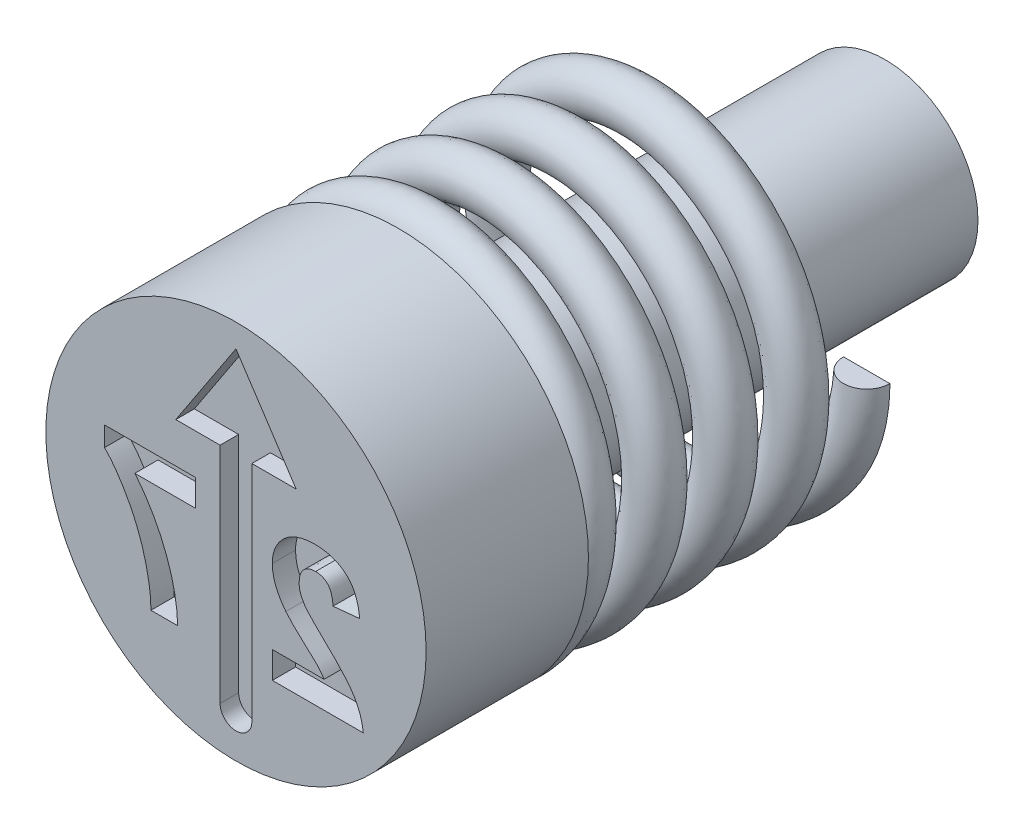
ISO-10303-21;
HEADER;
FILE_DESCRIPTION(('STEP AP214'),'2;1');
FILE_NAME('part.step','',(''),(''),'','','');
FILE_SCHEMA(('AUTOMOTIVE_DESIGN { 1 0 10303 214 1 1 1 1 }'));
ENDSEC;
DATA;
#1=APPLICATION_CONTEXT('core data for automotive mechanical design processes');
#2=APPLICATION_PROTOCOL_DEFINITION('international standard','automotive_design',2000,#1);
#3=PRODUCT_CONTEXT('',#1,'mechanical');
#4=PRODUCT('Part','Part','',(#3));
#5=PRODUCT_RELATED_PRODUCT_CATEGORY('part','',(#4));
#6=PRODUCT_DEFINITION_FORMATION('','',#4);
#7=PRODUCT_DEFINITION_CONTEXT('part definition',#1,'design');
#8=PRODUCT_DEFINITION('design','',#6,#7);
#9=PRODUCT_DEFINITION_SHAPE('','',#8);
#10=(LENGTH_UNIT() NAMED_UNIT(*) SI_UNIT(.MILLI.,.METRE.));
#11=(NAMED_UNIT(*) PLANE_ANGLE_UNIT() SI_UNIT($,.RADIAN.));
#12=(NAMED_UNIT(*) SI_UNIT($,.STERADIAN.) SOLID_ANGLE_UNIT());
#13=UNCERTAINTY_MEASURE_WITH_UNIT(LENGTH_MEASURE(1.E-05),#10,'distance_accuracy_value','');
#14=(GEOMETRIC_REPRESENTATION_CONTEXT(3) GLOBAL_UNCERTAINTY_ASSIGNED_CONTEXT((#13)) GLOBAL_UNIT_ASSIGNED_CONTEXT((#10,
#11,#12)) REPRESENTATION_CONTEXT('',''));
#15=CARTESIAN_POINT('',(0.,0.,0.));
#16=DIRECTION('',(0.,0.,1.));
#17=DIRECTION('',(1.,0.,0.));
#18=AXIS2_PLACEMENT_3D('',#15,#16,#17);
#19=CARTESIAN_POINT('',(3.6,0.,-10.5));
#20=DIRECTION('',(0.,-1.,0.));
#21=DIRECTION('',(0.,0.,-1.));
#22=AXIS2_PLACEMENT_3D('',#19,#20,#21);
#23=PLANE('',#22);
#24=CARTESIAN_POINT('',(3.6,0.,-10.));
#25=DIRECTION('',(0.,1.,0.));
#26=DIRECTION('',(0.,0.,1.));
#27=AXIS2_PLACEMENT_3D('',#24,#25,#26);
#28=CIRCLE('',#27,0.5);
#29=CARTESIAN_POINT('',(3.1,0.,-10.));
#30=VERTEX_POINT('',#29);
#31=CARTESIAN_POINT('',(4.1,0.,-10.));
#32=VERTEX_POINT('',#31);
#33=EDGE_CURVE('E92',#30,#32,#28,.T.);
#34=ORIENTED_EDGE('',*,*,#33,.T.);
#35=DIRECTION('',(-1.,0.,0.));
#36=VECTOR('',#35,1.);
#37=CARTESIAN_POINT('',(3.6,0.,-10.));
#38=LINE('',#37,#36);
#39=EDGE_CURVE('E79',#32,#30,#38,.T.);
#40=ORIENTED_EDGE('',*,*,#39,.T.);
#41=EDGE_LOOP('',(#34,#40));
#42=FACE_BOUND('',#41,.T.);
#43=ADVANCED_FACE('F53',(#42),#23,.F.);
#44=CARTESIAN_POINT('',(0.,-3.6,-4.));
#45=DIRECTION('',(-1.,0.,0.));
#46=DIRECTION('',(0.,-1.,0.));
#47=AXIS2_PLACEMENT_3D('',#44,#45,#46);
#48=PLANE('',#47);
#49=DIRECTION('',(0.,-1.,0.));
#50=VECTOR('',#49,1.);
#51=CARTESIAN_POINT('',(0.,-3.6,-3.5));
#52=LINE('',#51,#50);
#53=CARTESIAN_POINT('',(0.,-3.1,-3.5));
#54=VERTEX_POINT('',#53);
#55=CARTESIAN_POINT('',(0.,-4.1,-3.5));
#56=VERTEX_POINT('',#55);
#57=EDGE_CURVE('E73',#54,#56,#52,.T.);
#58=ORIENTED_EDGE('',*,*,#57,.F.);
#59=CARTESIAN_POINT('',(0.,-3.6,-3.5));
#60=DIRECTION('',(-1.,0.,0.));
#61=DIRECTION('',(0.,-1.,0.));
#62=AXIS2_PLACEMENT_3D('',#59,#60,#61);
#63=CIRCLE('',#62,0.5);
#64=EDGE_CURVE('E89',#54,#56,#63,.T.);
#65=ORIENTED_EDGE('',*,*,#64,.T.);
#66=EDGE_LOOP('',(#58,#65));
#67=FACE_BOUND('',#66,.T.);
#68=ADVANCED_FACE('F55',(#67),#48,.T.);
#69=CARTESIAN_POINT('',(3.6,0.,-9.5));
#70=CARTESIAN_POINT('',(3.6,-1.49116882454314,-9.40441176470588));
#71=CARTESIAN_POINT('',(2.54558441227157,-2.54558441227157,-9.30882352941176));
#72=CARTESIAN_POINT('',(1.49116882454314,-3.6,-9.21323529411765));
#73=CARTESIAN_POINT('',(0.,-3.6,-9.11764705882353));
#74=CARTESIAN_POINT('',(-1.49116882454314,-3.6,-9.02205882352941));
#75=CARTESIAN_POINT('',(-2.54558441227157,-2.54558441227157,-8.9264705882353));
#76=CARTESIAN_POINT('',(-3.6,-1.49116882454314,-8.83088235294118));
#77=CARTESIAN_POINT('',(-3.6,0.,-8.73529411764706));
#78=CARTESIAN_POINT('',(-3.6,1.49116882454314,-8.63970588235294));
#79=CARTESIAN_POINT('',(-2.54558441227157,2.54558441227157,-8.54411764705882));
#80=CARTESIAN_POINT('',(-1.49116882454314,3.6,-8.44852941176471));
#81=CARTESIAN_POINT('',(0.,3.6,-8.35294117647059));
#82=CARTESIAN_POINT('',(1.49116882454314,3.6,-8.25735294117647));
#83=CARTESIAN_POINT('',(2.54558441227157,2.54558441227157,-8.16176470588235));
#84=CARTESIAN_POINT('',(3.6,1.49116882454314,-8.06617647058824));
#85=CARTESIAN_POINT('',(3.6,0.,-7.97058823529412));
#86=CARTESIAN_POINT('',(3.6,-1.49116882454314,-7.875));
#87=CARTESIAN_POINT('',(2.54558441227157,-2.54558441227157,-7.77941176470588));
#88=CARTESIAN_POINT('',(1.49116882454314,-3.6,-7.68382352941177));
#89=CARTESIAN_POINT('',(0.,-3.6,-7.58823529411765));
#90=CARTESIAN_POINT('',(-1.49116882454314,-3.6,-7.49264705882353));
#91=CARTESIAN_POINT('',(-2.54558441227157,-2.54558441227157,-7.39705882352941));
#92=CARTESIAN_POINT('',(-3.6,-1.49116882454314,-7.3014705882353));
#93=CARTESIAN_POINT('',(-3.6,0.,-7.20588235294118));
#94=CARTESIAN_POINT('',(-3.6,1.49116882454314,-7.11029411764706));
#95=CARTESIAN_POINT('',(-2.54558441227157,2.54558441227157,-7.01470588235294));
#96=CARTESIAN_POINT('',(-1.49116882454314,3.6,-6.91911764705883));
#97=CARTESIAN_POINT('',(0.,3.6,-6.82352941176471));
#98=CARTESIAN_POINT('',(1.49116882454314,3.6,-6.72794117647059));
#99=CARTESIAN_POINT('',(2.54558441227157,2.54558441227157,-6.63235294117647));
#100=CARTESIAN_POINT('',(3.6,1.49116882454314,-6.53676470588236));
#101=CARTESIAN_POINT('',(3.6,0.,-6.44117647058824));
#102=CARTESIAN_POINT('',(3.6,-1.49116882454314,-6.34558823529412));
#103=CARTESIAN_POINT('',(2.54558441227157,-2.54558441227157,-6.25));
#104=CARTESIAN_POINT('',(1.49116882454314,-3.6,-6.15441176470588));
#105=CARTESIAN_POINT('',(0.,-3.6,-6.05882352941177));
#106=CARTESIAN_POINT('',(-1.49116882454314,-3.6,-5.96323529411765));
#107=CARTESIAN_POINT('',(-2.54558441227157,-2.54558441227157,-5.86764705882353));
#108=CARTESIAN_POINT('',(-3.6,-1.49116882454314,-5.77205882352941));
#109=CARTESIAN_POINT('',(-3.6,0.,-5.6764705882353));
#110=CARTESIAN_POINT('',(-3.6,1.49116882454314,-5.58088235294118));
#111=CARTESIAN_POINT('',(-2.54558441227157,2.54558441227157,-5.48529411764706));
#112=CARTESIAN_POINT('',(-1.49116882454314,3.6,-5.38970588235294));
#113=CARTESIAN_POINT('',(0.,3.6,-5.29411764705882));
#114=CARTESIAN_POINT('',(1.49116882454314,3.6,-5.19852941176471));
#115=CARTESIAN_POINT('',(2.54558441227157,2.54558441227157,-5.10294117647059));
#116=CARTESIAN_POINT('',(3.6,1.49116882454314,-5.00735294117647));
#117=CARTESIAN_POINT('',(3.6,0.,-4.91176470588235));
#118=CARTESIAN_POINT('',(3.6,-1.49116882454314,-4.81617647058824));
#119=CARTESIAN_POINT('',(2.54558441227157,-2.54558441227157,-4.72058823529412));
#120=CARTESIAN_POINT('',(1.49116882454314,-3.6,-4.625));
#121=CARTESIAN_POINT('',(0.,-3.6,-4.52941176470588));
#122=CARTESIAN_POINT('',(-1.49116882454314,-3.6,-4.43382352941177));
#123=CARTESIAN_POINT('',(-2.54558441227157,-2.54558441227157,-4.33823529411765));
#124=CARTESIAN_POINT('',(-3.6,-1.49116882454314,-4.24264705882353));
#125=CARTESIAN_POINT('',(-3.6,0.,-4.14705882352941));
#126=CARTESIAN_POINT('',(-3.6,1.49116882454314,-4.0514705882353));
#127=CARTESIAN_POINT('',(-2.54558441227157,2.54558441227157,-3.95588235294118));
#128=CARTESIAN_POINT('',(-1.49116882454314,3.6,-3.86029411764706));
#129=CARTESIAN_POINT('',(0.,3.6,-3.76470588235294));
#130=CARTESIAN_POINT('',(1.49116882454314,3.6,-3.66911764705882));
#131=CARTESIAN_POINT('',(2.54558441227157,2.54558441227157,-3.57352941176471));
#132=CARTESIAN_POINT('',(3.6,1.49116882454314,-3.47794117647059));
#133=CARTESIAN_POINT('',(3.6,0.,-3.38235294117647));
#134=CARTESIAN_POINT('',(3.6,-1.49116882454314,-3.28676470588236));
#135=CARTESIAN_POINT('',(2.54558441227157,-2.54558441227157,-3.19117647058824));
#136=CARTESIAN_POINT('',(1.49116882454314,-3.6,-3.09558823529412));
#137=CARTESIAN_POINT('',(0.,-3.6,-3.));
#138=CARTESIAN_POINT('',(4.6,0.,-9.5));
#139=CARTESIAN_POINT('',(4.6,-1.90538238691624,-9.40441176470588));
#140=CARTESIAN_POINT('',(3.25269119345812,-3.25269119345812,-9.30882352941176));
#141=CARTESIAN_POINT('',(1.90538238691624,-4.6,-9.21323529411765));
#142=CARTESIAN_POINT('',(0.,-4.6,-9.11764705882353));
#143=CARTESIAN_POINT('',(-1.90538238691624,-4.6,-9.02205882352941));
#144=CARTESIAN_POINT('',(-3.25269119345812,-3.25269119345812,-8.9264705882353));
#145=CARTESIAN_POINT('',(-4.6,-1.90538238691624,-8.83088235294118));
#146=CARTESIAN_POINT('',(-4.6,0.,-8.73529411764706));
#147=CARTESIAN_POINT('',(-4.6,1.90538238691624,-8.63970588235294));
#148=CARTESIAN_POINT('',(-3.25269119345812,3.25269119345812,-8.54411764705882));
#149=CARTESIAN_POINT('',(-1.90538238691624,4.6,-8.4485294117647));
#150=CARTESIAN_POINT('',(0.,4.6,-8.35294117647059));
#151=CARTESIAN_POINT('',(1.90538238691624,4.6,-8.25735294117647));
#152=CARTESIAN_POINT('',(3.25269119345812,3.25269119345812,-8.16176470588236));
#153=CARTESIAN_POINT('',(4.6,1.90538238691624,-8.06617647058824));
#154=CARTESIAN_POINT('',(4.6,0.,-7.97058823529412));
#155=CARTESIAN_POINT('',(4.6,-1.90538238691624,-7.875));
#156=CARTESIAN_POINT('',(3.25269119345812,-3.25269119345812,-7.77941176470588));
#157=CARTESIAN_POINT('',(1.90538238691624,-4.6,-7.68382352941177));
#158=CARTESIAN_POINT('',(0.,-4.6,-7.58823529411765));
#159=CARTESIAN_POINT('',(-1.90538238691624,-4.6,-7.49264705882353));
#160=CARTESIAN_POINT('',(-3.25269119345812,-3.25269119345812,-7.39705882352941));
#161=CARTESIAN_POINT('',(-4.6,-1.90538238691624,-7.30147058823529));
#162=CARTESIAN_POINT('',(-4.6,0.,-7.20588235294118));
#163=CARTESIAN_POINT('',(-4.6,1.90538238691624,-7.11029411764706));
#164=CARTESIAN_POINT('',(-3.25269119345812,3.25269119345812,-7.01470588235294));
#165=CARTESIAN_POINT('',(-1.90538238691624,4.6,-6.91911764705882));
#166=CARTESIAN_POINT('',(0.,4.6,-6.82352941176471));
#167=CARTESIAN_POINT('',(1.90538238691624,4.6,-6.72794117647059));
#168=CARTESIAN_POINT('',(3.25269119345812,3.25269119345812,-6.63235294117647));
#169=CARTESIAN_POINT('',(4.6,1.90538238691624,-6.53676470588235));
#170=CARTESIAN_POINT('',(4.6,0.,-6.44117647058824));
#171=CARTESIAN_POINT('',(4.6,-1.90538238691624,-6.34558823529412));
#172=CARTESIAN_POINT('',(3.25269119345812,-3.25269119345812,-6.25));
#173=CARTESIAN_POINT('',(1.90538238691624,-4.6,-6.15441176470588));
#174=CARTESIAN_POINT('',(0.,-4.6,-6.05882352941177));
#175=CARTESIAN_POINT('',(-1.90538238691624,-4.6,-5.96323529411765));
#176=CARTESIAN_POINT('',(-3.25269119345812,-3.25269119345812,-5.86764705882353));
#177=CARTESIAN_POINT('',(-4.6,-1.90538238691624,-5.77205882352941));
#178=CARTESIAN_POINT('',(-4.6,0.,-5.6764705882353));
#179=CARTESIAN_POINT('',(-4.6,1.90538238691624,-5.58088235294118));
#180=CARTESIAN_POINT('',(-3.25269119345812,3.25269119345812,-5.48529411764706));
#181=CARTESIAN_POINT('',(-1.90538238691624,4.6,-5.38970588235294));
#182=CARTESIAN_POINT('',(0.,4.6,-5.29411764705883));
#183=CARTESIAN_POINT('',(1.90538238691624,4.6,-5.19852941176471));
#184=CARTESIAN_POINT('',(3.25269119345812,3.25269119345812,-5.10294117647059));
#185=CARTESIAN_POINT('',(4.6,1.90538238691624,-5.00735294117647));
#186=CARTESIAN_POINT('',(4.6,0.,-4.91176470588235));
#187=CARTESIAN_POINT('',(4.6,-1.90538238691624,-4.81617647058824));
#188=CARTESIAN_POINT('',(3.25269119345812,-3.25269119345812,-4.72058823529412));
#189=CARTESIAN_POINT('',(1.90538238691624,-4.6,-4.625));
#190=CARTESIAN_POINT('',(0.,-4.6,-4.52941176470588));
#191=CARTESIAN_POINT('',(-1.90538238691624,-4.6,-4.43382352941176));
#192=CARTESIAN_POINT('',(-3.25269119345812,-3.25269119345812,-4.33823529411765));
#193=CARTESIAN_POINT('',(-4.6,-1.90538238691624,-4.24264705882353));
#194=CARTESIAN_POINT('',(-4.6,0.,-4.14705882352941));
#195=CARTESIAN_POINT('',(-4.6,1.90538238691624,-4.05147058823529));
#196=CARTESIAN_POINT('',(-3.25269119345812,3.25269119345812,-3.95588235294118));
#197=CARTESIAN_POINT('',(-1.90538238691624,4.6,-3.86029411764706));
#198=CARTESIAN_POINT('',(0.,4.6,-3.76470588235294));
#199=CARTESIAN_POINT('',(1.90538238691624,4.6,-3.66911764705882));
#200=CARTESIAN_POINT('',(3.25269119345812,3.25269119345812,-3.57352941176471));
#201=CARTESIAN_POINT('',(4.6,1.90538238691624,-3.47794117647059));
#202=CARTESIAN_POINT('',(4.6,0.,-3.38235294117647));
#203=CARTESIAN_POINT('',(4.6,-1.90538238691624,-3.28676470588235));
#204=CARTESIAN_POINT('',(3.25269119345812,-3.25269119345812,-3.19117647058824));
#205=CARTESIAN_POINT('',(1.90538238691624,-4.6,-3.09558823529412));
#206=CARTESIAN_POINT('',(0.,-4.6,-3.));
#207=CARTESIAN_POINT('',(4.6,0.,-10.5));
#208=CARTESIAN_POINT('',(4.6,-1.90538238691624,-10.4044117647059));
#209=CARTESIAN_POINT('',(3.25269119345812,-3.25269119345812,-10.3088235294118));
#210=CARTESIAN_POINT('',(1.90538238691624,-4.6,-10.2132352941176));
#211=CARTESIAN_POINT('',(0.,-4.6,-10.1176470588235));
#212=CARTESIAN_POINT('',(-1.90538238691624,-4.6,-10.0220588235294));
#213=CARTESIAN_POINT('',(-3.25269119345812,-3.25269119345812,-9.9264705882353));
#214=CARTESIAN_POINT('',(-4.6,-1.90538238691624,-9.83088235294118));
#215=CARTESIAN_POINT('',(-4.6,0.,-9.73529411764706));
#216=CARTESIAN_POINT('',(-4.6,1.90538238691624,-9.63970588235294));
#217=CARTESIAN_POINT('',(-3.25269119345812,3.25269119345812,-9.54411764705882));
#218=CARTESIAN_POINT('',(-1.90538238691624,4.6,-9.44852941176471));
#219=CARTESIAN_POINT('',(0.,4.6,-9.35294117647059));
#220=CARTESIAN_POINT('',(1.90538238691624,4.6,-9.25735294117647));
#221=CARTESIAN_POINT('',(3.25269119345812,3.25269119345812,-9.16176470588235));
#222=CARTESIAN_POINT('',(4.6,1.90538238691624,-9.06617647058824));
#223=CARTESIAN_POINT('',(4.6,0.,-8.97058823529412));
#224=CARTESIAN_POINT('',(4.6,-1.90538238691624,-8.875));
#225=CARTESIAN_POINT('',(3.25269119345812,-3.25269119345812,-8.77941176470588));
#226=CARTESIAN_POINT('',(1.90538238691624,-4.6,-8.68382352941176));
#227=CARTESIAN_POINT('',(0.,-4.6,-8.58823529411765));
#228=CARTESIAN_POINT('',(-1.90538238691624,-4.6,-8.49264705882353));
#229=CARTESIAN_POINT('',(-3.25269119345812,-3.25269119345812,-8.39705882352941));
#230=CARTESIAN_POINT('',(-4.6,-1.90538238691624,-8.30147058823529));
#231=CARTESIAN_POINT('',(-4.6,0.,-8.20588235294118));
#232=CARTESIAN_POINT('',(-4.6,1.90538238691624,-8.11029411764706));
#233=CARTESIAN_POINT('',(-3.25269119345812,3.25269119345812,-8.01470588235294));
#234=CARTESIAN_POINT('',(-1.90538238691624,4.6,-7.91911764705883));
#235=CARTESIAN_POINT('',(0.,4.6,-7.82352941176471));
#236=CARTESIAN_POINT('',(1.90538238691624,4.6,-7.72794117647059));
#237=CARTESIAN_POINT('',(3.25269119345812,3.25269119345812,-7.63235294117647));
#238=CARTESIAN_POINT('',(4.6,1.90538238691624,-7.53676470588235));
#239=CARTESIAN_POINT('',(4.6,0.,-7.44117647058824));
#240=CARTESIAN_POINT('',(4.6,-1.90538238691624,-7.34558823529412));
#241=CARTESIAN_POINT('',(3.25269119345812,-3.25269119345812,-7.25));
#242=CARTESIAN_POINT('',(1.90538238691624,-4.6,-7.15441176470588));
#243=CARTESIAN_POINT('',(0.,-4.6,-7.05882352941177));
#244=CARTESIAN_POINT('',(-1.90538238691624,-4.6,-6.96323529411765));
#245=CARTESIAN_POINT('',(-3.25269119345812,-3.25269119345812,-6.86764705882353));
#246=CARTESIAN_POINT('',(-4.6,-1.90538238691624,-6.77205882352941));
#247=CARTESIAN_POINT('',(-4.6,0.,-6.6764705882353));
#248=CARTESIAN_POINT('',(-4.6,1.90538238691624,-6.58088235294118));
#249=CARTESIAN_POINT('',(-3.25269119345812,3.25269119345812,-6.48529411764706));
#250=CARTESIAN_POINT('',(-1.90538238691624,4.6,-6.38970588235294));
#251=CARTESIAN_POINT('',(0.,4.6,-6.29411764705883));
#252=CARTESIAN_POINT('',(1.90538238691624,4.6,-6.19852941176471));
#253=CARTESIAN_POINT('',(3.25269119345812,3.25269119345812,-6.10294117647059));
#254=CARTESIAN_POINT('',(4.6,1.90538238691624,-6.00735294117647));
#255=CARTESIAN_POINT('',(4.6,0.,-5.91176470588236));
#256=CARTESIAN_POINT('',(4.6,-1.90538238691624,-5.81617647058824));
#257=CARTESIAN_POINT('',(3.25269119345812,-3.25269119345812,-5.72058823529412));
#258=CARTESIAN_POINT('',(1.90538238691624,-4.6,-5.625));
#259=CARTESIAN_POINT('',(0.,-4.6,-5.52941176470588));
#260=CARTESIAN_POINT('',(-1.90538238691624,-4.6,-5.43382352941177));
#261=CARTESIAN_POINT('',(-3.25269119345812,-3.25269119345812,-5.33823529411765));
#262=CARTESIAN_POINT('',(-4.6,-1.90538238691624,-5.24264705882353));
#263=CARTESIAN_POINT('',(-4.6,0.,-5.14705882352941));
#264=CARTESIAN_POINT('',(-4.6,1.90538238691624,-5.0514705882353));
#265=CARTESIAN_POINT('',(-3.25269119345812,3.25269119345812,-4.95588235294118));
#266=CARTESIAN_POINT('',(-1.90538238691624,4.6,-4.86029411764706));
#267=CARTESIAN_POINT('',(0.,4.6,-4.76470588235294));
#268=CARTESIAN_POINT('',(1.90538238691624,4.6,-4.66911764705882));
#269=CARTESIAN_POINT('',(3.25269119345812,3.25269119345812,-4.57352941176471));
#270=CARTESIAN_POINT('',(4.6,1.90538238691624,-4.47794117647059));
#271=CARTESIAN_POINT('',(4.6,0.,-4.38235294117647));
#272=CARTESIAN_POINT('',(4.6,-1.90538238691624,-4.28676470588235));
#273=CARTESIAN_POINT('',(3.25269119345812,-3.25269119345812,-4.19117647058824));
#274=CARTESIAN_POINT('',(1.90538238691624,-4.6,-4.09558823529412));
#275=CARTESIAN_POINT('',(0.,-4.6,-4.));
#276=CARTESIAN_POINT('',(3.6,0.,-10.5));
#277=CARTESIAN_POINT('',(3.6,-1.49116882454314,-10.4044117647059));
#278=CARTESIAN_POINT('',(2.54558441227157,-2.54558441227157,-10.3088235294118));
#279=CARTESIAN_POINT('',(1.49116882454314,-3.6,-10.2132352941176));
#280=CARTESIAN_POINT('',(0.,-3.6,-10.1176470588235));
#281=CARTESIAN_POINT('',(-1.49116882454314,-3.6,-10.0220588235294));
#282=CARTESIAN_POINT('',(-2.54558441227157,-2.54558441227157,-9.9264705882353));
#283=CARTESIAN_POINT('',(-3.6,-1.49116882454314,-9.83088235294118));
#284=CARTESIAN_POINT('',(-3.6,0.,-9.73529411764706));
#285=CARTESIAN_POINT('',(-3.6,1.49116882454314,-9.63970588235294));
#286=CARTESIAN_POINT('',(-2.54558441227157,2.54558441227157,-9.54411764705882));
#287=CARTESIAN_POINT('',(-1.49116882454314,3.6,-9.44852941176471));
#288=CARTESIAN_POINT('',(0.,3.6,-9.35294117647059));
#289=CARTESIAN_POINT('',(1.49116882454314,3.6,-9.25735294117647));
#290=CARTESIAN_POINT('',(2.54558441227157,2.54558441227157,-9.16176470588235));
#291=CARTESIAN_POINT('',(3.6,1.49116882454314,-9.06617647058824));
#292=CARTESIAN_POINT('',(3.6,0.,-8.97058823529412));
#293=CARTESIAN_POINT('',(3.6,-1.49116882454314,-8.875));
#294=CARTESIAN_POINT('',(2.54558441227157,-2.54558441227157,-8.77941176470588));
#295=CARTESIAN_POINT('',(1.49116882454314,-3.6,-8.68382352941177));
#296=CARTESIAN_POINT('',(0.,-3.6,-8.58823529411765));
#297=CARTESIAN_POINT('',(-1.49116882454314,-3.6,-8.49264705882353));
#298=CARTESIAN_POINT('',(-2.54558441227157,-2.54558441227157,-8.39705882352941));
#299=CARTESIAN_POINT('',(-3.6,-1.49116882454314,-8.3014705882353));
#300=CARTESIAN_POINT('',(-3.6,0.,-8.20588235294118));
#301=CARTESIAN_POINT('',(-3.6,1.49116882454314,-8.11029411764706));
#302=CARTESIAN_POINT('',(-2.54558441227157,2.54558441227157,-8.01470588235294));
#303=CARTESIAN_POINT('',(-1.49116882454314,3.6,-7.91911764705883));
#304=CARTESIAN_POINT('',(0.,3.6,-7.82352941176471));
#305=CARTESIAN_POINT('',(1.49116882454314,3.6,-7.72794117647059));
#306=CARTESIAN_POINT('',(2.54558441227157,2.54558441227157,-7.63235294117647));
#307=CARTESIAN_POINT('',(3.6,1.49116882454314,-7.53676470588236));
#308=CARTESIAN_POINT('',(3.6,0.,-7.44117647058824));
#309=CARTESIAN_POINT('',(3.6,-1.49116882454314,-7.34558823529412));
#310=CARTESIAN_POINT('',(2.54558441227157,-2.54558441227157,-7.25));
#311=CARTESIAN_POINT('',(1.49116882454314,-3.6,-7.15441176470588));
#312=CARTESIAN_POINT('',(0.,-3.6,-7.05882352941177));
#313=CARTESIAN_POINT('',(-1.49116882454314,-3.6,-6.96323529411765));
#314=CARTESIAN_POINT('',(-2.54558441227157,-2.54558441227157,-6.86764705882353));
#315=CARTESIAN_POINT('',(-3.6,-1.49116882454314,-6.77205882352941));
#316=CARTESIAN_POINT('',(-3.6,0.,-6.6764705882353));
#317=CARTESIAN_POINT('',(-3.6,1.49116882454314,-6.58088235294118));
#318=CARTESIAN_POINT('',(-2.54558441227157,2.54558441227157,-6.48529411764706));
#319=CARTESIAN_POINT('',(-1.49116882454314,3.6,-6.38970588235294));
#320=CARTESIAN_POINT('',(0.,3.6,-6.29411764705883));
#321=CARTESIAN_POINT('',(1.49116882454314,3.6,-6.19852941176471));
#322=CARTESIAN_POINT('',(2.54558441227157,2.54558441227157,-6.10294117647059));
#323=CARTESIAN_POINT('',(3.6,1.49116882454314,-6.00735294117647));
#324=CARTESIAN_POINT('',(3.6,0.,-5.91176470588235));
#325=CARTESIAN_POINT('',(3.6,-1.49116882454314,-5.81617647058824));
#326=CARTESIAN_POINT('',(2.54558441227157,-2.54558441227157,-5.72058823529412));
#327=CARTESIAN_POINT('',(1.49116882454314,-3.6,-5.625));
#328=CARTESIAN_POINT('',(0.,-3.6,-5.52941176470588));
#329=CARTESIAN_POINT('',(-1.49116882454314,-3.6,-5.43382352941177));
#330=CARTESIAN_POINT('',(-2.54558441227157,-2.54558441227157,-5.33823529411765));
#331=CARTESIAN_POINT('',(-3.6,-1.49116882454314,-5.24264705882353));
#332=CARTESIAN_POINT('',(-3.6,0.,-5.14705882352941));
#333=CARTESIAN_POINT('',(-3.6,1.49116882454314,-5.0514705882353));
#334=CARTESIAN_POINT('',(-2.54558441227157,2.54558441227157,-4.95588235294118));
#335=CARTESIAN_POINT('',(-1.49116882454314,3.6,-4.86029411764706));
#336=CARTESIAN_POINT('',(0.,3.6,-4.76470588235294));
#337=CARTESIAN_POINT('',(1.49116882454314,3.6,-4.66911764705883));
#338=CARTESIAN_POINT('',(2.54558441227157,2.54558441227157,-4.57352941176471));
#339=CARTESIAN_POINT('',(3.6,1.49116882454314,-4.47794117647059));
#340=CARTESIAN_POINT('',(3.6,0.,-4.38235294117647));
#341=CARTESIAN_POINT('',(3.6,-1.49116882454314,-4.28676470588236));
#342=CARTESIAN_POINT('',(2.54558441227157,-2.54558441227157,-4.19117647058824));
#343=CARTESIAN_POINT('',(1.49116882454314,-3.6,-4.09558823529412));
#344=CARTESIAN_POINT('',(0.,-3.6,-4.));
#345=CARTESIAN_POINT('',(2.6,0.,-10.5));
#346=CARTESIAN_POINT('',(2.6,-1.07695526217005,-10.4044117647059));
#347=CARTESIAN_POINT('',(1.83847763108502,-1.83847763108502,-10.3088235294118));
#348=CARTESIAN_POINT('',(1.07695526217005,-2.6,-10.2132352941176));
#349=CARTESIAN_POINT('',(0.,-2.6,-10.1176470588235));
#350=CARTESIAN_POINT('',(-1.07695526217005,-2.6,-10.0220588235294));
#351=CARTESIAN_POINT('',(-1.83847763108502,-1.83847763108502,-9.9264705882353));
#352=CARTESIAN_POINT('',(-2.6,-1.07695526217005,-9.83088235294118));
#353=CARTESIAN_POINT('',(-2.6,0.,-9.73529411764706));
#354=CARTESIAN_POINT('',(-2.6,1.07695526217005,-9.63970588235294));
#355=CARTESIAN_POINT('',(-1.83847763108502,1.83847763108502,-9.54411764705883));
#356=CARTESIAN_POINT('',(-1.07695526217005,2.6,-9.44852941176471));
#357=CARTESIAN_POINT('',(0.,2.6,-9.35294117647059));
#358=CARTESIAN_POINT('',(1.07695526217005,2.6,-9.25735294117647));
#359=CARTESIAN_POINT('',(1.83847763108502,1.83847763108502,-9.16176470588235));
#360=CARTESIAN_POINT('',(2.6,1.07695526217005,-9.06617647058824));
#361=CARTESIAN_POINT('',(2.6,0.,-8.97058823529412));
#362=CARTESIAN_POINT('',(2.6,-1.07695526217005,-8.875));
#363=CARTESIAN_POINT('',(1.83847763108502,-1.83847763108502,-8.77941176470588));
#364=CARTESIAN_POINT('',(1.07695526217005,-2.6,-8.68382352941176));
#365=CARTESIAN_POINT('',(0.,-2.6,-8.58823529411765));
#366=CARTESIAN_POINT('',(-1.07695526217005,-2.6,-8.49264705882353));
#367=CARTESIAN_POINT('',(-1.83847763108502,-1.83847763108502,-8.39705882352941));
#368=CARTESIAN_POINT('',(-2.6,-1.07695526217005,-8.30147058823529));
#369=CARTESIAN_POINT('',(-2.6,0.,-8.20588235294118));
#370=CARTESIAN_POINT('',(-2.6,1.07695526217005,-8.11029411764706));
#371=CARTESIAN_POINT('',(-1.83847763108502,1.83847763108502,-8.01470588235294));
#372=CARTESIAN_POINT('',(-1.07695526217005,2.6,-7.91911764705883));
#373=CARTESIAN_POINT('',(0.,2.6,-7.82352941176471));
#374=CARTESIAN_POINT('',(1.07695526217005,2.6,-7.72794117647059));
#375=CARTESIAN_POINT('',(1.83847763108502,1.83847763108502,-7.63235294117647));
#376=CARTESIAN_POINT('',(2.6,1.07695526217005,-7.53676470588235));
#377=CARTESIAN_POINT('',(2.6,0.,-7.44117647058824));
#378=CARTESIAN_POINT('',(2.6,-1.07695526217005,-7.34558823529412));
#379=CARTESIAN_POINT('',(1.83847763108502,-1.83847763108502,-7.25));
#380=CARTESIAN_POINT('',(1.07695526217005,-2.6,-7.15441176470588));
#381=CARTESIAN_POINT('',(0.,-2.6,-7.05882352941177));
#382=CARTESIAN_POINT('',(-1.07695526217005,-2.6,-6.96323529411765));
#383=CARTESIAN_POINT('',(-1.83847763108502,-1.83847763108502,-6.86764705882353));
#384=CARTESIAN_POINT('',(-2.6,-1.07695526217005,-6.77205882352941));
#385=CARTESIAN_POINT('',(-2.6,0.,-6.6764705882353));
#386=CARTESIAN_POINT('',(-2.6,1.07695526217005,-6.58088235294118));
#387=CARTESIAN_POINT('',(-1.83847763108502,1.83847763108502,-6.48529411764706));
#388=CARTESIAN_POINT('',(-1.07695526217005,2.6,-6.38970588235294));
#389=CARTESIAN_POINT('',(0.,2.6,-6.29411764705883));
#390=CARTESIAN_POINT('',(1.07695526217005,2.6,-6.19852941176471));
#391=CARTESIAN_POINT('',(1.83847763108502,1.83847763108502,-6.10294117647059));
#392=CARTESIAN_POINT('',(2.6,1.07695526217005,-6.00735294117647));
#393=CARTESIAN_POINT('',(2.6,0.,-5.91176470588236));
#394=CARTESIAN_POINT('',(2.6,-1.07695526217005,-5.81617647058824));
#395=CARTESIAN_POINT('',(1.83847763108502,-1.83847763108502,-5.72058823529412));
#396=CARTESIAN_POINT('',(1.07695526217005,-2.6,-5.625));
#397=CARTESIAN_POINT('',(0.,-2.6,-5.52941176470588));
#398=CARTESIAN_POINT('',(-1.07695526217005,-2.6,-5.43382352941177));
#399=CARTESIAN_POINT('',(-1.83847763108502,-1.83847763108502,-5.33823529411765));
#400=CARTESIAN_POINT('',(-2.6,-1.07695526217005,-5.24264705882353));
#401=CARTESIAN_POINT('',(-2.6,0.,-5.14705882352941));
#402=CARTESIAN_POINT('',(-2.6,1.07695526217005,-5.0514705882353));
#403=CARTESIAN_POINT('',(-1.83847763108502,1.83847763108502,-4.95588235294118));
#404=CARTESIAN_POINT('',(-1.07695526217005,2.6,-4.86029411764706));
#405=CARTESIAN_POINT('',(0.,2.6,-4.76470588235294));
#406=CARTESIAN_POINT('',(1.07695526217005,2.6,-4.66911764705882));
#407=CARTESIAN_POINT('',(1.83847763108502,1.83847763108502,-4.57352941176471));
#408=CARTESIAN_POINT('',(2.6,1.07695526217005,-4.47794117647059));
#409=CARTESIAN_POINT('',(2.6,0.,-4.38235294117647));
#410=CARTESIAN_POINT('',(2.6,-1.07695526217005,-4.28676470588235));
#411=CARTESIAN_POINT('',(1.83847763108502,-1.83847763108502,-4.19117647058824));
#412=CARTESIAN_POINT('',(1.07695526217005,-2.6,-4.09558823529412));
#413=CARTESIAN_POINT('',(0.,-2.6,-4.));
#414=CARTESIAN_POINT('',(2.6,0.,-9.5));
#415=CARTESIAN_POINT('',(2.6,-1.07695526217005,-9.40441176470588));
#416=CARTESIAN_POINT('',(1.83847763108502,-1.83847763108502,-9.30882352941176));
#417=CARTESIAN_POINT('',(1.07695526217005,-2.6,-9.21323529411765));
#418=CARTESIAN_POINT('',(0.,-2.6,-9.11764705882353));
#419=CARTESIAN_POINT('',(-1.07695526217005,-2.6,-9.02205882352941));
#420=CARTESIAN_POINT('',(-1.83847763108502,-1.83847763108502,-8.9264705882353));
#421=CARTESIAN_POINT('',(-2.6,-1.07695526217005,-8.83088235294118));
#422=CARTESIAN_POINT('',(-2.6,0.,-8.73529411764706));
#423=CARTESIAN_POINT('',(-2.6,1.07695526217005,-8.63970588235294));
#424=CARTESIAN_POINT('',(-1.83847763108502,1.83847763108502,-8.54411764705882));
#425=CARTESIAN_POINT('',(-1.07695526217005,2.6,-8.4485294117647));
#426=CARTESIAN_POINT('',(0.,2.6,-8.35294117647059));
#427=CARTESIAN_POINT('',(1.07695526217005,2.6,-8.25735294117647));
#428=CARTESIAN_POINT('',(1.83847763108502,1.83847763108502,-8.16176470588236));
#429=CARTESIAN_POINT('',(2.6,1.07695526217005,-8.06617647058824));
#430=CARTESIAN_POINT('',(2.6,0.,-7.97058823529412));
#431=CARTESIAN_POINT('',(2.6,-1.07695526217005,-7.875));
#432=CARTESIAN_POINT('',(1.83847763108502,-1.83847763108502,-7.77941176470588));
#433=CARTESIAN_POINT('',(1.07695526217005,-2.6,-7.68382352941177));
#434=CARTESIAN_POINT('',(0.,-2.6,-7.58823529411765));
#435=CARTESIAN_POINT('',(-1.07695526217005,-2.6,-7.49264705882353));
#436=CARTESIAN_POINT('',(-1.83847763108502,-1.83847763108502,-7.39705882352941));
#437=CARTESIAN_POINT('',(-2.6,-1.07695526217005,-7.30147058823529));
#438=CARTESIAN_POINT('',(-2.6,0.,-7.20588235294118));
#439=CARTESIAN_POINT('',(-2.6,1.07695526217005,-7.11029411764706));
#440=CARTESIAN_POINT('',(-1.83847763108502,1.83847763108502,-7.01470588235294));
#441=CARTESIAN_POINT('',(-1.07695526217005,2.6,-6.91911764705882));
#442=CARTESIAN_POINT('',(0.,2.6,-6.82352941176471));
#443=CARTESIAN_POINT('',(1.07695526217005,2.6,-6.72794117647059));
#444=CARTESIAN_POINT('',(1.83847763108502,1.83847763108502,-6.63235294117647));
#445=CARTESIAN_POINT('',(2.6,1.07695526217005,-6.53676470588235));
#446=CARTESIAN_POINT('',(2.6,0.,-6.44117647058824));
#447=CARTESIAN_POINT('',(2.6,-1.07695526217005,-6.34558823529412));
#448=CARTESIAN_POINT('',(1.83847763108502,-1.83847763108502,-6.25));
#449=CARTESIAN_POINT('',(1.07695526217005,-2.6,-6.15441176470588));
#450=CARTESIAN_POINT('',(0.,-2.6,-6.05882352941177));
#451=CARTESIAN_POINT('',(-1.07695526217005,-2.6,-5.96323529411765));
#452=CARTESIAN_POINT('',(-1.83847763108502,-1.83847763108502,-5.86764705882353));
#453=CARTESIAN_POINT('',(-2.6,-1.07695526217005,-5.77205882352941));
#454=CARTESIAN_POINT('',(-2.6,0.,-5.6764705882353));
#455=CARTESIAN_POINT('',(-2.6,1.07695526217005,-5.58088235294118));
#456=CARTESIAN_POINT('',(-1.83847763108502,1.83847763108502,-5.48529411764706));
#457=CARTESIAN_POINT('',(-1.07695526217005,2.6,-5.38970588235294));
#458=CARTESIAN_POINT('',(0.,2.6,-5.29411764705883));
#459=CARTESIAN_POINT('',(1.07695526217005,2.6,-5.19852941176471));
#460=CARTESIAN_POINT('',(1.83847763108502,1.83847763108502,-5.10294117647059));
#461=CARTESIAN_POINT('',(2.6,1.07695526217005,-5.00735294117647));
#462=CARTESIAN_POINT('',(2.6,0.,-4.91176470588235));
#463=CARTESIAN_POINT('',(2.6,-1.07695526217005,-4.81617647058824));
#464=CARTESIAN_POINT('',(1.83847763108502,-1.83847763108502,-4.72058823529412));
#465=CARTESIAN_POINT('',(1.07695526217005,-2.6,-4.625));
#466=CARTESIAN_POINT('',(0.,-2.6,-4.52941176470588));
#467=CARTESIAN_POINT('',(-1.07695526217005,-2.6,-4.43382352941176));
#468=CARTESIAN_POINT('',(-1.83847763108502,-1.83847763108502,-4.33823529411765));
#469=CARTESIAN_POINT('',(-2.6,-1.07695526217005,-4.24264705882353));
#470=CARTESIAN_POINT('',(-2.6,0.,-4.14705882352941));
#471=CARTESIAN_POINT('',(-2.6,1.07695526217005,-4.05147058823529));
#472=CARTESIAN_POINT('',(-1.83847763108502,1.83847763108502,-3.95588235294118));
#473=CARTESIAN_POINT('',(-1.07695526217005,2.6,-3.86029411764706));
#474=CARTESIAN_POINT('',(0.,2.6,-3.76470588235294));
#475=CARTESIAN_POINT('',(1.07695526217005,2.6,-3.66911764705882));
#476=CARTESIAN_POINT('',(1.83847763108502,1.83847763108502,-3.57352941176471));
#477=CARTESIAN_POINT('',(2.6,1.07695526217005,-3.47794117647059));
#478=CARTESIAN_POINT('',(2.6,0.,-3.38235294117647));
#479=CARTESIAN_POINT('',(2.6,-1.07695526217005,-3.28676470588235));
#480=CARTESIAN_POINT('',(1.83847763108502,-1.83847763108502,-3.19117647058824));
#481=CARTESIAN_POINT('',(1.07695526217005,-2.6,-3.09558823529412));
#482=CARTESIAN_POINT('',(0.,-2.6,-3.));
#483=CARTESIAN_POINT('',(3.6,0.,-9.5));
#484=CARTESIAN_POINT('',(3.6,-1.49116882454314,-9.40441176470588));
#485=CARTESIAN_POINT('',(2.54558441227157,-2.54558441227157,-9.30882352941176));
#486=CARTESIAN_POINT('',(1.49116882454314,-3.6,-9.21323529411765));
#487=CARTESIAN_POINT('',(0.,-3.6,-9.11764705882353));
#488=CARTESIAN_POINT('',(-1.49116882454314,-3.6,-9.02205882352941));
#489=CARTESIAN_POINT('',(-2.54558441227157,-2.54558441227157,-8.9264705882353));
#490=CARTESIAN_POINT('',(-3.6,-1.49116882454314,-8.83088235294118));
#491=CARTESIAN_POINT('',(-3.6,0.,-8.73529411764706));
#492=CARTESIAN_POINT('',(-3.6,1.49116882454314,-8.63970588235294));
#493=CARTESIAN_POINT('',(-2.54558441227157,2.54558441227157,-8.54411764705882));
#494=CARTESIAN_POINT('',(-1.49116882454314,3.6,-8.44852941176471));
#495=CARTESIAN_POINT('',(0.,3.6,-8.35294117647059));
#496=CARTESIAN_POINT('',(1.49116882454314,3.6,-8.25735294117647));
#497=CARTESIAN_POINT('',(2.54558441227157,2.54558441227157,-8.16176470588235));
#498=CARTESIAN_POINT('',(3.6,1.49116882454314,-8.06617647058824));
#499=CARTESIAN_POINT('',(3.6,0.,-7.97058823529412));
#500=CARTESIAN_POINT('',(3.6,-1.49116882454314,-7.875));
#501=CARTESIAN_POINT('',(2.54558441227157,-2.54558441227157,-7.77941176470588));
#502=CARTESIAN_POINT('',(1.49116882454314,-3.6,-7.68382352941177));
#503=CARTESIAN_POINT('',(0.,-3.6,-7.58823529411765));
#504=CARTESIAN_POINT('',(-1.49116882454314,-3.6,-7.49264705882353));
#505=CARTESIAN_POINT('',(-2.54558441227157,-2.54558441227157,-7.39705882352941));
#506=CARTESIAN_POINT('',(-3.6,-1.49116882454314,-7.3014705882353));
#507=CARTESIAN_POINT('',(-3.6,0.,-7.20588235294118));
#508=CARTESIAN_POINT('',(-3.6,1.49116882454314,-7.11029411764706));
#509=CARTESIAN_POINT('',(-2.54558441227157,2.54558441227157,-7.01470588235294));
#510=CARTESIAN_POINT('',(-1.49116882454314,3.6,-6.91911764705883));
#511=CARTESIAN_POINT('',(0.,3.6,-6.82352941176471));
#512=CARTESIAN_POINT('',(1.49116882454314,3.6,-6.72794117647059));
#513=CARTESIAN_POINT('',(2.54558441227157,2.54558441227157,-6.63235294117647));
#514=CARTESIAN_POINT('',(3.6,1.49116882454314,-6.53676470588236));
#515=CARTESIAN_POINT('',(3.6,0.,-6.44117647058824));
#516=CARTESIAN_POINT('',(3.6,-1.49116882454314,-6.34558823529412));
#517=CARTESIAN_POINT('',(2.54558441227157,-2.54558441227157,-6.25));
#518=CARTESIAN_POINT('',(1.49116882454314,-3.6,-6.15441176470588));
#519=CARTESIAN_POINT('',(0.,-3.6,-6.05882352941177));
#520=CARTESIAN_POINT('',(-1.49116882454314,-3.6,-5.96323529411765));
#521=CARTESIAN_POINT('',(-2.54558441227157,-2.54558441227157,-5.86764705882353));
#522=CARTESIAN_POINT('',(-3.6,-1.49116882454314,-5.77205882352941));
#523=CARTESIAN_POINT('',(-3.6,0.,-5.6764705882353));
#524=CARTESIAN_POINT('',(-3.6,1.49116882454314,-5.58088235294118));
#525=CARTESIAN_POINT('',(-2.54558441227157,2.54558441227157,-5.48529411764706));
#526=CARTESIAN_POINT('',(-1.49116882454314,3.6,-5.38970588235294));
#527=CARTESIAN_POINT('',(0.,3.6,-5.29411764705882));
#528=CARTESIAN_POINT('',(1.49116882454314,3.6,-5.19852941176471));
#529=CARTESIAN_POINT('',(2.54558441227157,2.54558441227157,-5.10294117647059));
#530=CARTESIAN_POINT('',(3.6,1.49116882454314,-5.00735294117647));
#531=CARTESIAN_POINT('',(3.6,0.,-4.91176470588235));
#532=CARTESIAN_POINT('',(3.6,-1.49116882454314,-4.81617647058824));
#533=CARTESIAN_POINT('',(2.54558441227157,-2.54558441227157,-4.72058823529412));
#534=CARTESIAN_POINT('',(1.49116882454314,-3.6,-4.625));
#535=CARTESIAN_POINT('',(0.,-3.6,-4.52941176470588));
#536=CARTESIAN_POINT('',(-1.49116882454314,-3.6,-4.43382352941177));
#537=CARTESIAN_POINT('',(-2.54558441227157,-2.54558441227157,-4.33823529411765));
#538=CARTESIAN_POINT('',(-3.6,-1.49116882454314,-4.24264705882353));
#539=CARTESIAN_POINT('',(-3.6,0.,-4.14705882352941));
#540=CARTESIAN_POINT('',(-3.6,1.49116882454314,-4.0514705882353));
#541=CARTESIAN_POINT('',(-2.54558441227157,2.54558441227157,-3.95588235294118));
#542=CARTESIAN_POINT('',(-1.49116882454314,3.6,-3.86029411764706));
#543=CARTESIAN_POINT('',(0.,3.6,-3.76470588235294));
#544=CARTESIAN_POINT('',(1.49116882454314,3.6,-3.66911764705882));
#545=CARTESIAN_POINT('',(2.54558441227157,2.54558441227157,-3.57352941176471));
#546=CARTESIAN_POINT('',(3.6,1.49116882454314,-3.47794117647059));
#547=CARTESIAN_POINT('',(3.6,0.,-3.38235294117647));
#548=CARTESIAN_POINT('',(3.6,-1.49116882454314,-3.28676470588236));
#549=CARTESIAN_POINT('',(2.54558441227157,-2.54558441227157,-3.19117647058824));
#550=CARTESIAN_POINT('',(1.49116882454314,-3.6,-3.09558823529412));
#551=CARTESIAN_POINT('',(0.,-3.6,-3.));
#552=(BOUNDED_SURFACE() B_SPLINE_SURFACE(3,2,((#69,#70,#71,#72,#73,#74,#75,#76,#77,#78,#79,#80,
#81,#82,#83,#84,#85,#86,#87,#88,#89,#90,#91,#92,#93,#94,#95,#96,#97,#98,#99,#100,#101,#102,#103,
#104,#105,#106,#107,#108,#109,#110,#111,#112,#113,#114,#115,#116,#117,#118,#119,#120,#121,#122,
#123,#124,#125,#126,#127,#128,#129,#130,#131,#132,#133,#134,#135,#136,#137),(#138,#139,#140,
#141,#142,#143,#144,#145,#146,#147,#148,#149,#150,#151,#152,#153,#154,#155,#156,#157,#158,#159,
#160,#161,#162,#163,#164,#165,#166,#167,#168,#169,#170,#171,#172,#173,#174,#175,#176,#177,#178,
#179,#180,#181,#182,#183,#184,#185,#186,#187,#188,#189,#190,#191,#192,#193,#194,#195,#196,#197,
#198,#199,#200,#201,#202,#203,#204,#205,#206),(#207,#208,#209,#210,#211,#212,#213,#214,#215,
#216,#217,#218,#219,#220,#221,#222,#223,#224,#225,#226,#227,#228,#229,#230,#231,#232,#233,#234,
#235,#236,#237,#238,#239,#240,#241,#242,#243,#244,#245,#246,#247,#248,#249,#250,#251,#252,#253,
#254,#255,#256,#257,#258,#259,#260,#261,#262,#263,#264,#265,#266,#267,#268,#269,#270,#271,#272,
#273,#274,#275),(#276,#277,#278,#279,#280,#281,#282,#283,#284,#285,#286,#287,#288,#289,#290,
#291,#292,#293,#294,#295,#296,#297,#298,#299,#300,#301,#302,#303,#304,#305,#306,#307,#308,#309,
#310,#311,#312,#313,#314,#315,#316,#317,#318,#319,#320,#321,#322,#323,#324,#325,#326,#327,#328,
#329,#330,#331,#332,#333,#334,#335,#336,#337,#338,#339,#340,#341,#342,#343,#344),(#345,#346,
#347,#348,#349,#350,#351,#352,#353,#354,#355,#356,#357,#358,#359,#360,#361,#362,#363,#364,#365,
#366,#367,#368,#369,#370,#371,#372,#373,#374,#375,#376,#377,#378,#379,#380,#381,#382,#383,#384,
#385,#386,#387,#388,#389,#390,#391,#392,#393,#394,#395,#396,#397,#398,#399,#400,#401,#402,#403,
#404,#405,#406,#407,#408,#409,#410,#411,#412,#413),(#414,#415,#416,#417,#418,#419,#420,#421,
#422,#423,#424,#425,#426,#427,#428,#429,#430,#431,#432,#433,#434,#435,#436,#437,#438,#439,#440,
#441,#442,#443,#444,#445,#446,#447,#448,#449,#450,#451,#452,#453,#454,#455,#456,#457,#458,#459,
#460,#461,#462,#463,#464,#465,#466,#467,#468,#469,#470,#471,#472,#473,#474,#475,#476,#477,#478,
#479,#480,#481,#482),(#483,#484,#485,#486,#487,#488,#489,#490,#491,#492,#493,#494,#495,#496,
#497,#498,#499,#500,#501,#502,#503,#504,#505,#506,#507,#508,#509,#510,#511,#512,#513,#514,#515,
#516,#517,#518,#519,#520,#521,#522,#523,#524,#525,#526,#527,#528,#529,#530,#531,#532,#533,#534,
#535,#536,#537,#538,#539,#540,#541,#542,#543,#544,#545,#546,#547,#548,#549,#550,#551)),
.UNSPECIFIED.,.T.,.F.,.F.) B_SPLINE_SURFACE_WITH_KNOTS((4,3,4),(3,2,2,2,2,2,2,2,2,2,2,2,2,2,2,2,
2,2,2,2,2,2,2,2,2,2,2,2,2,2,2,2,2,2,3),(0.,0.5,1.),(0.,0.025,0.05,0.075,0.1,0.125,0.15,0.175,
0.2,0.225,0.25,0.275,0.3,0.325,0.35,0.375,0.4,0.425,0.45,0.475,0.5,0.525,0.55,0.575,0.6,0.625,
0.65,0.675,0.7,0.725,0.75,0.775,0.8,0.825,0.85),
.UNSPECIFIED.) GEOMETRIC_REPRESENTATION_ITEM() RATIONAL_B_SPLINE_SURFACE(((1.,0.923879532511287,
1.,0.923879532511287,1.,0.923879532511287,1.,0.923879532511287,1.,0.923879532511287,1.,
0.923879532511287,1.,0.923879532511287,1.,0.923879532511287,1.,0.923879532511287,1.,
0.923879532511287,1.,0.923879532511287,1.,0.923879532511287,1.,0.923879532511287,1.,
0.923879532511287,1.,0.923879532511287,1.,0.923879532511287,1.,0.923879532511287,1.,
0.923879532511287,1.,0.923879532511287,1.,0.923879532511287,1.,0.923879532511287,1.,
0.923879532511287,1.,0.923879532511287,1.,0.923879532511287,1.,0.923879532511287,1.,
0.923879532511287,1.,0.923879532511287,1.,0.923879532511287,1.,0.923879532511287,1.,
0.923879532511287,1.,0.923879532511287,1.,0.923879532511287,1.,0.923879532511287,1.,
0.923879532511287,1.),(0.333333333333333,0.307959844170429,0.333333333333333,0.307959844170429,
0.333333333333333,0.307959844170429,0.333333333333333,0.307959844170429,0.333333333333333,
0.307959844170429,0.333333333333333,0.307959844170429,0.333333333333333,0.307959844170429,
0.333333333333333,0.307959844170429,0.333333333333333,0.307959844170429,0.333333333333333,
0.307959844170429,0.333333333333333,0.307959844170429,0.333333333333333,0.307959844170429,
0.333333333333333,0.307959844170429,0.333333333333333,0.307959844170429,0.333333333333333,
0.307959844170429,0.333333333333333,0.307959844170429,0.333333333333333,0.307959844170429,
0.333333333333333,0.307959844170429,0.333333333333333,0.307959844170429,0.333333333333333,
0.307959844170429,0.333333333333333,0.307959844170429,0.333333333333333,0.307959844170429,
0.333333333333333,0.307959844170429,0.333333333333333,0.307959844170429,0.333333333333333,
0.307959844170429,0.333333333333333,0.307959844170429,0.333333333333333,0.307959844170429,
0.333333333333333,0.307959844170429,0.333333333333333,0.307959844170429,0.333333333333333,
0.307959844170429,0.333333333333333,0.307959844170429,0.333333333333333,0.307959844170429,
0.333333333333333,0.307959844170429,0.333333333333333,0.307959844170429,0.333333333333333),
(0.333333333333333,0.307959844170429,0.333333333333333,0.307959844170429,0.333333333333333,
0.307959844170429,0.333333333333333,0.307959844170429,0.333333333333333,0.307959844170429,
0.333333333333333,0.307959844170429,0.333333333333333,0.307959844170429,0.333333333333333,
0.307959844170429,0.333333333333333,0.307959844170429,0.333333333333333,0.307959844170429,
0.333333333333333,0.307959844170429,0.333333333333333,0.307959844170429,0.333333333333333,
0.307959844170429,0.333333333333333,0.307959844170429,0.333333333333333,0.307959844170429,
0.333333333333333,0.307959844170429,0.333333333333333,0.307959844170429,0.333333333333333,
0.307959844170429,0.333333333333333,0.307959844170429,0.333333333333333,0.307959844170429,
0.333333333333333,0.307959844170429,0.333333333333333,0.307959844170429,0.333333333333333,
0.307959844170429,0.333333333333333,0.307959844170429,0.333333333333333,0.307959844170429,
0.333333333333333,0.307959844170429,0.333333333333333,0.307959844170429,0.333333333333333,
0.307959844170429,0.333333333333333,0.307959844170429,0.333333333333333,0.307959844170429,
0.333333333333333,0.307959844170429,0.333333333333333,0.307959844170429,0.333333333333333,
0.307959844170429,0.333333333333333,0.307959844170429,0.333333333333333),(1.,0.923879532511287,
1.,0.923879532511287,1.,0.923879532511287,1.,0.923879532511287,1.,0.923879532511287,1.,
0.923879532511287,1.,0.923879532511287,1.,0.923879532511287,1.,0.923879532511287,1.,
0.923879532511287,1.,0.923879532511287,1.,0.923879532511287,1.,0.923879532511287,1.,
0.923879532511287,1.,0.923879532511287,1.,0.923879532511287,1.,0.923879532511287,1.,
0.923879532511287,1.,0.923879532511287,1.,0.923879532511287,1.,0.923879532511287,1.,
0.923879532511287,1.,0.923879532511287,1.,0.923879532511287,1.,0.923879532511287,1.,
0.923879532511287,1.,0.923879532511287,1.,0.923879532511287,1.,0.923879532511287,1.,
0.923879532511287,1.,0.923879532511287,1.,0.923879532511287,1.,0.923879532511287,1.,
0.923879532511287,1.),(0.333333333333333,0.307959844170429,0.333333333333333,0.307959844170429,
0.333333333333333,0.307959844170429,0.333333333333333,0.307959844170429,0.333333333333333,
0.307959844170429,0.333333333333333,0.307959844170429,0.333333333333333,0.307959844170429,
0.333333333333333,0.307959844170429,0.333333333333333,0.307959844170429,0.333333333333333,
0.307959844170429,0.333333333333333,0.307959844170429,0.333333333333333,0.307959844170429,
0.333333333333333,0.307959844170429,0.333333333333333,0.307959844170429,0.333333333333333,
0.307959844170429,0.333333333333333,0.307959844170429,0.333333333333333,0.307959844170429,
0.333333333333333,0.307959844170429,0.333333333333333,0.307959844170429,0.333333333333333,
0.307959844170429,0.333333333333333,0.307959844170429,0.333333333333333,0.307959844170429,
0.333333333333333,0.307959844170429,0.333333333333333,0.307959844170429,0.333333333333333,
0.307959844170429,0.333333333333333,0.307959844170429,0.333333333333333,0.307959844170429,
0.333333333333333,0.307959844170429,0.333333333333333,0.307959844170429,0.333333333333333,
0.307959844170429,0.333333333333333,0.307959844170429,0.333333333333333,0.307959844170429,
0.333333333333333,0.307959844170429,0.333333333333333,0.307959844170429,0.333333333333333),
(0.333333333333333,0.307959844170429,0.333333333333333,0.307959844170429,0.333333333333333,
0.307959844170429,0.333333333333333,0.307959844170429,0.333333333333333,0.307959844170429,
0.333333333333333,0.307959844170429,0.333333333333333,0.307959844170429,0.333333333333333,
0.307959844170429,0.333333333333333,0.307959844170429,0.333333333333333,0.307959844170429,
0.333333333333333,0.307959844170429,0.333333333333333,0.307959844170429,0.333333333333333,
0.307959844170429,0.333333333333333,0.307959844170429,0.333333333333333,0.307959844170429,
0.333333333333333,0.307959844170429,0.333333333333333,0.307959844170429,0.333333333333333,
0.307959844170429,0.333333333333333,0.307959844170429,0.333333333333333,0.307959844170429,
0.333333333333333,0.307959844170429,0.333333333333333,0.307959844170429,0.333333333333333,
0.307959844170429,0.333333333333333,0.307959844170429,0.333333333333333,0.307959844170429,
0.333333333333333,0.307959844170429,0.333333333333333,0.307959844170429,0.333333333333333,
0.307959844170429,0.333333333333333,0.307959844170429,0.333333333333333,0.307959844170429,
0.333333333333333,0.307959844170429,0.333333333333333,0.307959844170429,0.333333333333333,
0.307959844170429,0.333333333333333,0.307959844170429,0.333333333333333),(1.,0.923879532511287,
1.,0.923879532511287,1.,0.923879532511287,1.,0.923879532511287,1.,0.923879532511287,1.,
0.923879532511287,1.,0.923879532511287,1.,0.923879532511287,1.,0.923879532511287,1.,
0.923879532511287,1.,0.923879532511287,1.,0.923879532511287,1.,0.923879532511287,1.,
0.923879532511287,1.,0.923879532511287,1.,0.923879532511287,1.,0.923879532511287,1.,
0.923879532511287,1.,0.923879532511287,1.,0.923879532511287,1.,0.923879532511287,1.,
0.923879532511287,1.,0.923879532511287,1.,0.923879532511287,1.,0.923879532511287,1.,
0.923879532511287,1.,0.923879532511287,1.,0.923879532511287,1.,0.923879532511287,1.,
0.923879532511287,1.,0.923879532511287,1.,0.923879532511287,1.,0.923879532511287,1.,
0.923879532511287,1.))) REPRESENTATION_ITEM('') SURFACE());
#553=CARTESIAN_POINT('',(3.1,0.,-10.));
#554=CARTESIAN_POINT('',(3.09999879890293,-0.0843593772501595,-10.));
#555=CARTESIAN_POINT('',(3.09667302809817,-0.168681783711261,-10.));
#556=CARTESIAN_POINT('',(3.08342143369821,-0.336800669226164,-10.));
#557=CARTESIAN_POINT('',(3.0734960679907,-0.420597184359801,-10.));
#558=CARTESIAN_POINT('',(3.03392430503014,-0.670343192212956,-10.));
#559=CARTESIAN_POINT('',(2.99448199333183,-0.834848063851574,-10.));
#560=CARTESIAN_POINT('',(2.89055780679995,-1.15566278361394,-10.));
#561=CARTESIAN_POINT('',(2.82607348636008,-1.31197182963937,-10.));
#562=CARTESIAN_POINT('',(2.67361217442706,-1.61273937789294,-10.));
#563=CARTESIAN_POINT('',(2.58563987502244,-1.75720023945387,-10.));
#564=CARTESIAN_POINT('',(2.43371655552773,-1.96787154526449,-10.));
#565=CARTESIAN_POINT('',(2.37724731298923,-2.03958919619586,-10.));
#566=CARTESIAN_POINT('',(2.25844522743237,-2.1779954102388,-10.));
#567=CARTESIAN_POINT('',(2.19611186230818,-2.24468352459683,-10.));
#568=CARTESIAN_POINT('',(2.00114174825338,-2.43678352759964,-10.));
#569=CARTESIAN_POINT('',(1.86051631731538,-2.5542567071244,-10.));
#570=CARTESIAN_POINT('',(1.55968748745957,-2.76669246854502,-10.));
#571=CARTESIAN_POINT('',(1.39919000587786,-2.86123501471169,-10.));
#572=CARTESIAN_POINT('',(1.06500581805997,-3.0230866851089,-10.));
#573=CARTESIAN_POINT('',(0.891324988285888,-3.09040785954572,-10.));
#574=CARTESIAN_POINT('',(0.621354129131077,-3.17092969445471,-10.));
#575=CARTESIAN_POINT('',(0.528045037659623,-3.19458410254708,-10.));
#576=CARTESIAN_POINT('',(0.339781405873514,-3.23418416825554,-10.));
#577=CARTESIAN_POINT('',(0.24482692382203,-3.25013009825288,-9.99999999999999));
#578=CARTESIAN_POINT('',(0.0539834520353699,-3.27417196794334,-10.));
#579=CARTESIAN_POINT('',(-0.0419051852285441,-3.28227076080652,-10.));
#580=CARTESIAN_POINT('',(-0.234002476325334,-3.29146947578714,-9.99999999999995));
#581=CARTESIAN_POINT('',(-0.330211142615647,-3.29256912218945,-9.99999999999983));
#582=CARTESIAN_POINT('',(-0.528310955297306,-3.28802608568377,-9.9999999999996));
#583=CARTESIAN_POINT('',(-0.630192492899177,-3.28197002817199,-9.99999999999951));
#584=CARTESIAN_POINT('',(-0.782537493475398,-3.26804202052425,-10.0000000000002));
#585=CARTESIAN_POINT('',(-0.833241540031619,-3.26259172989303,-10.0000000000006));
#586=CARTESIAN_POINT('',(-0.934479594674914,-3.25028794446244,-9.99999999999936));
#587=CARTESIAN_POINT('',(-0.985013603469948,-3.24343445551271,-9.99999999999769));
#588=CARTESIAN_POINT('',(-1.08708770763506,-3.22845900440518,-9.99999999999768));
#589=CARTESIAN_POINT('',(-1.1386239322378,-3.2203112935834,-9.99999999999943));
#590=CARTESIAN_POINT('',(-1.21586598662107,-3.20770319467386,-10.0000000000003));
#591=CARTESIAN_POINT('',(-1.2416043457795,-3.2034358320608,-10.0000000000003));
#592=CARTESIAN_POINT('',(-1.29308408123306,-3.1949151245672,-9.99999999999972));
#593=CARTESIAN_POINT('',(-1.31882545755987,-3.19066177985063,-9.99999999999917));
#594=CARTESIAN_POINT('',(-1.36467492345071,-3.1833069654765,-9.99999999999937));
#595=CARTESIAN_POINT('',(-1.38477543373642,-3.18015807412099,-9.99999999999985));
#596=CARTESIAN_POINT('',(-1.42502395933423,-3.17418902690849,-10.0000000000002));
#597=CARTESIAN_POINT('',(-1.44517196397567,-3.17136880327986,-9.99999999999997));
#598=CARTESIAN_POINT('',(-1.48303208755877,-3.16670663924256,-10.));
#599=CARTESIAN_POINT('',(-1.50073476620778,-3.16478657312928,-10.0000000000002));
#600=CARTESIAN_POINT('',(-1.53626779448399,-3.16187633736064,-9.99999999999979));
#601=CARTESIAN_POINT('',(-1.55409829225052,-3.16088752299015,-9.99999999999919));
#602=CARTESIAN_POINT('',(-1.58089590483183,-3.16097715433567,-9.99999999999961));
#603=CARTESIAN_POINT('',(-1.58986214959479,-3.16127221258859,-9.99999999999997));
#604=CARTESIAN_POINT('',(-1.60770835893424,-3.16275456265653,-10.));
#605=CARTESIAN_POINT('',(-1.61658853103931,-3.16393761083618,-9.99999999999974));
#606=CARTESIAN_POINT('',(-1.63121172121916,-3.16732195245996,-9.99999999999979));
#607=CARTESIAN_POINT('',(-1.63705279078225,-3.16907870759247,-9.99999999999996));
#608=CARTESIAN_POINT('',(-1.64830767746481,-3.17396517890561,-10.));
#609=CARTESIAN_POINT('',(-1.65371766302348,-3.17710586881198,-9.99999999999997));
#610=CARTESIAN_POINT('',(-1.6612259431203,-3.18405421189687,-10.));
#611=CARTESIAN_POINT('',(-1.66382576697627,-3.18727955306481,-10.0000000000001));
#612=CARTESIAN_POINT('',(-1.66770594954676,-3.19445897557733,-9.99999999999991));
#613=CARTESIAN_POINT('',(-1.66898322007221,-3.198414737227,-9.99999999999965));
#614=CARTESIAN_POINT('',(-1.67046822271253,-3.20770505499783,-9.99999999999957));
#615=CARTESIAN_POINT('',(-1.67023732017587,-3.21309569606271,-9.99999999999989));
#616=CARTESIAN_POINT('',(-1.66862244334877,-3.22299601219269,-10.0000000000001));
#617=CARTESIAN_POINT('',(-1.66737336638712,-3.22753593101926,-10.));
#618=CARTESIAN_POINT('',(-1.66426831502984,-3.23641327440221,-9.99999999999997));
#619=CARTESIAN_POINT('',(-1.66241048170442,-3.24075003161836,-9.99999999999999));
#620=CARTESIAN_POINT('',(-1.65716837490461,-3.2515633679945,-10.));
#621=CARTESIAN_POINT('',(-1.65350721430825,-3.25790162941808,-10.));
#622=CARTESIAN_POINT('',(-1.64563465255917,-3.27020781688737,-10.));
#623=CARTESIAN_POINT('',(-1.6414235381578,-3.27617593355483,-10.));
#624=CARTESIAN_POINT('',(-1.62819148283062,-3.29372891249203,-10.));
#625=CARTESIAN_POINT('',(-1.6186131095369,-3.30489036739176,-10.));
#626=CARTESIAN_POINT('',(-1.59919549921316,-3.3258666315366,-10.));
#627=CARTESIAN_POINT('',(-1.58939794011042,-3.33572157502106,-10.));
#628=CARTESIAN_POINT('',(-1.5692979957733,-3.35490596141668,-10.));
#629=CARTESIAN_POINT('',(-1.55899549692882,-3.36423528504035,-10.));
#630=CARTESIAN_POINT('',(-1.52749924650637,-3.39161582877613,-10.));
#631=CARTESIAN_POINT('',(-1.50574996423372,-3.40902564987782,-10.));
#632=CARTESIAN_POINT('',(-1.46127319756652,-3.44255914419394,-10.));
#633=CARTESIAN_POINT('',(-1.4385450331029,-3.45868190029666,-10.));
#634=CARTESIAN_POINT('',(-1.39237505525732,-3.48981200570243,-10.));
#635=CARTESIAN_POINT('',(-1.3689339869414,-3.50482046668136,-10.));
#636=CARTESIAN_POINT('',(-1.28199331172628,-3.55803806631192,-10.));
#637=CARTESIAN_POINT('',(-1.21669503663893,-3.59332948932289,-10.));
#638=CARTESIAN_POINT('',(-1.08326886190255,-3.6582080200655,-10.));
#639=CARTESIAN_POINT('',(-1.01513699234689,-3.68778677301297,-10.));
#640=CARTESIAN_POINT('',(-0.876786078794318,-3.74161328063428,-10.));
#641=CARTESIAN_POINT('',(-0.806566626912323,-3.76585998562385,-10.));
#642=CARTESIAN_POINT('',(-0.664565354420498,-3.80925163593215,-10.));
#643=CARTESIAN_POINT('',(-0.592783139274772,-3.82839527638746,-10.));
#644=CARTESIAN_POINT('',(-0.424878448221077,-3.86705270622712,-10.));
#645=CARTESIAN_POINT('',(-0.328323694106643,-3.88472127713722,-10.));
#646=CARTESIAN_POINT('',(-0.182634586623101,-3.90489794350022,-10.));
#647=CARTESIAN_POINT('',(-0.133912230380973,-3.91056997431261,-10.));
#648=CARTESIAN_POINT('',(-0.0362641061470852,-3.91981291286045,-9.99999999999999));
#649=CARTESIAN_POINT('',(0.0126616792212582,-3.92338363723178,-9.99999999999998));
#650=CARTESIAN_POINT('',(0.159607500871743,-3.93114451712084,-10.));
#651=CARTESIAN_POINT('',(0.25779790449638,-3.93238363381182,-10.0000000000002));
#652=CARTESIAN_POINT('',(0.453936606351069,-3.92703449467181,-9.99999999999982));
#653=CARTESIAN_POINT('',(0.551884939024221,-3.92044742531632,-9.9999999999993));
#654=CARTESIAN_POINT('',(0.747955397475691,-3.89944554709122,-9.99999999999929));
#655=CARTESIAN_POINT('',(0.846069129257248,-3.88495168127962,-9.99999999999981));
#656=CARTESIAN_POINT('',(1.04081956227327,-3.84823825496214,-10.0000000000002));
#657=CARTESIAN_POINT('',(1.13745623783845,-3.82601856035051,-10.0000000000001));
#658=CARTESIAN_POINT('',(1.42416881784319,-3.74805602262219,-9.99999999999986));
#659=CARTESIAN_POINT('',(1.6112779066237,-3.68098457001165,-9.99999999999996));
#660=CARTESIAN_POINT('',(1.98510526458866,-3.51301574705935,-10.));
#661=CARTESIAN_POINT('',(2.17093245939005,-3.41012901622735,-10.));
#662=CARTESIAN_POINT('',(2.43501848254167,-3.23412238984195,-10.));
#663=CARTESIAN_POINT('',(2.52065563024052,-3.17179313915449,-10.));
#664=CARTESIAN_POINT('',(2.68655205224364,-3.04030612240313,-10.));
#665=CARTESIAN_POINT('',(2.76681123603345,-2.97114824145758,-10.));
#666=CARTESIAN_POINT('',(2.92314131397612,-2.82498562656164,-10.));
#667=CARTESIAN_POINT('',(2.9990826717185,-2.74784264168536,-10.));
#668=CARTESIAN_POINT('',(3.14442773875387,-2.58762217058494,-10.));
#669=CARTESIAN_POINT('',(3.21383128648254,-2.50454453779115,-10.));
#670=CARTESIAN_POINT('',(3.34561164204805,-2.33296691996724,-10.));
#671=CARTESIAN_POINT('',(3.40798720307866,-2.244465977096,-10.));
#672=CARTESIAN_POINT('',(3.5252824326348,-2.06265833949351,-10.));
#673=CARTESIAN_POINT('',(3.5802022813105,-1.9693517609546,-9.99999999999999));
#674=CARTESIAN_POINT('',(3.68371963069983,-1.7757480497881,-9.99999999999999));
#675=CARTESIAN_POINT('',(3.73208378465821,-1.67532604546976,-10.));
#676=CARTESIAN_POINT('',(3.82018375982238,-1.47076551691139,-10.));
#677=CARTESIAN_POINT('',(3.85991947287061,-1.36662694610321,-10.));
#678=CARTESIAN_POINT('',(3.93046213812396,-1.15545755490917,-10.));
#679=CARTESIAN_POINT('',(3.96127588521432,-1.04842900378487,-10.));
#680=CARTESIAN_POINT('',(4.01380102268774,-0.832202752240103,-10.));
#681=CARTESIAN_POINT('',(4.03551588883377,-0.723005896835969,-10.));
#682=CARTESIAN_POINT('',(4.06840643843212,-0.511628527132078,-10.));
#683=CARTESIAN_POINT('',(4.08026356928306,-0.409553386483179,-10.));
#684=CARTESIAN_POINT('',(4.09605706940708,-0.204985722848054,-9.99999999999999));
#685=CARTESIAN_POINT('',(4.1000083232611,-0.10249434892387,-9.99999999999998));
#686=CARTESIAN_POINT('',(4.1,-5.45701726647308E-13,-9.99999999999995));
#687=B_SPLINE_CURVE_WITH_KNOTS('',3,(#553,#554,#555,#556,#557,#558,#559,#560,#561,#562,#563,
#564,#565,#566,#567,#568,#569,#570,#571,#572,#573,#574,#575,#576,#577,#578,#579,#580,#581,#582,
#583,#584,#585,#586,#587,#588,#589,#590,#591,#592,#593,#594,#595,#596,#597,#598,#599,#600,#601,
#602,#603,#604,#605,#606,#607,#608,#609,#610,#611,#612,#613,#614,#615,#616,#617,#618,#619,#620,
#621,#622,#623,#624,#625,#626,#627,#628,#629,#630,#631,#632,#633,#634,#635,#636,#637,#638,#639,
#640,#641,#642,#643,#644,#645,#646,#647,#648,#649,#650,#651,#652,#653,#654,#655,#656,#657,#658,
#659,#660,#661,#662,#663,#664,#665,#666,#667,#668,#669,#670,#671,#672,#673,#674,#675,#676,#677,
#678,#679,#680,#681,#682,#683,#684,#685,#686),.UNSPECIFIED.,.F.,.F.,(4,2,2,2,2,2,2,2,2,2,2,2,2,
2,2,2,2,2,2,2,2,2,2,2,2,2,2,2,2,2,2,2,2,2,2,2,2,2,2,2,2,2,2,2,2,2,2,2,2,2,2,2,2,2,2,2,2,2,2,2,2,
2,2,2,2,2,4),(0.,0.25294003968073,0.505862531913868,1.01111732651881,1.51642147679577,
2.02162476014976,2.29517629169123,2.56875220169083,3.11581006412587,3.67223816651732,
4.22841968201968,4.51693568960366,4.80544150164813,5.09384237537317,5.38225460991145,
5.68817613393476,5.84114860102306,5.99412043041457,6.15064263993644,6.22891219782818,
6.30718266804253,6.36821962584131,6.42924397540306,6.48266113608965,6.53615591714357,
6.56305366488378,6.58982368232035,6.60806418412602,6.62645199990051,6.63863744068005,
6.65085127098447,6.66674798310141,6.68082658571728,6.69494858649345,6.71685563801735,
6.73875131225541,6.78278962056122,6.82446141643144,6.8661426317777,6.94964710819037,
7.03321056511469,7.11668950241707,7.33897362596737,7.56158041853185,7.78423099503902,
8.00693844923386,8.30097518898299,8.44809231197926,8.59522227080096,8.88947644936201,
9.18368602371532,9.48089268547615,9.77810450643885,10.3718400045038,11.0059335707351,
11.3233936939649,11.6408591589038,11.9652490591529,12.2896469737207,12.6141023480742,
12.9385498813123,13.2725361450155,13.6065265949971,13.9402620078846,14.2738698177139,
14.5818510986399,14.8892519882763),.UNSPECIFIED.);
#688=EDGE_CURVE('E67',#30,#32,#687,.T.);
#689=CARTESIAN_POINT('',(0.,-3.1,-3.5));
#690=CARTESIAN_POINT('',(0.0843593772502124,-3.09999879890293,-3.5));
#691=CARTESIAN_POINT('',(0.168681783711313,-3.09667302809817,-3.5));
#692=CARTESIAN_POINT('',(0.336800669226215,-3.08342143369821,-3.5));
#693=CARTESIAN_POINT('',(0.420597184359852,-3.07349606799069,-3.5));
#694=CARTESIAN_POINT('',(0.670343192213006,-3.03392430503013,-3.5));
#695=CARTESIAN_POINT('',(0.834848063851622,-2.99448199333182,-3.5));
#696=CARTESIAN_POINT('',(1.15566278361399,-2.89055780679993,-3.5));
#697=CARTESIAN_POINT('',(1.31197182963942,-2.82607348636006,-3.5));
#698=CARTESIAN_POINT('',(1.61273937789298,-2.67361217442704,-3.5));
#699=CARTESIAN_POINT('',(1.75720023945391,-2.58563987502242,-3.5));
#700=CARTESIAN_POINT('',(1.96787154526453,-2.4337165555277,-3.5));
#701=CARTESIAN_POINT('',(2.0395891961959,-2.3772473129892,-3.5));
#702=CARTESIAN_POINT('',(2.17799541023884,-2.25844522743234,-3.5));
#703=CARTESIAN_POINT('',(2.24468352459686,-2.19611186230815,-3.5));
#704=CARTESIAN_POINT('',(2.43678352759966,-2.00114174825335,-3.5));
#705=CARTESIAN_POINT('',(2.55425670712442,-1.86051631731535,-3.5));
#706=CARTESIAN_POINT('',(2.76669246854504,-1.55968748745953,-3.5));
#707=CARTESIAN_POINT('',(2.86123501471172,-1.39919000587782,-3.5));
#708=CARTESIAN_POINT('',(3.02308668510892,-1.06500581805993,-3.5));
#709=CARTESIAN_POINT('',(3.09040785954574,-0.891324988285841,-3.5));
#710=CARTESIAN_POINT('',(3.17092969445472,-0.621354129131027,-3.5));
#711=CARTESIAN_POINT('',(3.19458410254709,-0.528045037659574,-3.5));
#712=CARTESIAN_POINT('',(3.23418416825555,-0.339781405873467,-3.5));
#713=CARTESIAN_POINT('',(3.2501300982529,-0.244826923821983,-3.50000000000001));
#714=CARTESIAN_POINT('',(3.27417196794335,-0.0539834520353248,-3.49999999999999));
#715=CARTESIAN_POINT('',(3.28227076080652,0.0419051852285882,-3.49999999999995));
#716=CARTESIAN_POINT('',(3.29146947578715,0.234002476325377,-3.50000000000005));
#717=CARTESIAN_POINT('',(3.29256912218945,0.330211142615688,-3.50000000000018));
#718=CARTESIAN_POINT('',(3.28802608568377,0.528310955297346,-3.5000000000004));
#719=CARTESIAN_POINT('',(3.28197002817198,0.630192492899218,-3.50000000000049));
#720=CARTESIAN_POINT('',(3.26804202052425,0.782537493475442,-3.49999999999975));
#721=CARTESIAN_POINT('',(3.26259172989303,0.833241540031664,-3.49999999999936));
#722=CARTESIAN_POINT('',(3.25028794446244,0.93447959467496,-3.50000000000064));
#723=CARTESIAN_POINT('',(3.2434344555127,0.985013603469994,-3.50000000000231));
#724=CARTESIAN_POINT('',(3.22845900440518,1.08708770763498,-3.50000000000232));
#725=CARTESIAN_POINT('',(3.22031129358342,1.13862393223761,-3.50000000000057));
#726=CARTESIAN_POINT('',(3.20770319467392,1.2158659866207,-3.49999999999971));
#727=CARTESIAN_POINT('',(3.20343583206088,1.24160434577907,-3.49999999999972));
#728=CARTESIAN_POINT('',(3.19491512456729,1.29308408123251,-3.50000000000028));
#729=CARTESIAN_POINT('',(3.19066177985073,1.31882545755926,-3.50000000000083));
#730=CARTESIAN_POINT('',(3.18330696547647,1.36467492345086,-3.50000000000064));
#731=CARTESIAN_POINT('',(3.18015807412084,1.38477543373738,-3.50000000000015));
#732=CARTESIAN_POINT('',(3.17418902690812,1.42502395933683,-3.49999999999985));
#733=CARTESIAN_POINT('',(3.17136880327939,1.4451719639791,-3.50000000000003));
#734=CARTESIAN_POINT('',(3.16670663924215,1.48303208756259,-3.49999999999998));
#735=CARTESIAN_POINT('',(3.16478657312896,1.50073476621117,-3.49999999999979));
#736=CARTESIAN_POINT('',(3.16187633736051,1.53626779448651,-3.50000000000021));
#737=CARTESIAN_POINT('',(3.16088752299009,1.5540982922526,-3.50000000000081));
#738=CARTESIAN_POINT('',(3.16097715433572,1.58089590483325,-3.50000000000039));
#739=CARTESIAN_POINT('',(3.16127221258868,1.58986214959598,-3.50000000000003));
#740=CARTESIAN_POINT('',(3.16275456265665,1.60770835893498,-3.49999999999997));
#741=CARTESIAN_POINT('',(3.16393761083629,1.61658853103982,-3.50000000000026));
#742=CARTESIAN_POINT('',(3.16732195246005,1.63121172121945,-3.50000000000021));
#743=CARTESIAN_POINT('',(3.16907870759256,1.63705279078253,-3.50000000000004));
#744=CARTESIAN_POINT('',(3.17396517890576,1.64830767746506,-3.49999999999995));
#745=CARTESIAN_POINT('',(3.17710586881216,1.65371766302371,-3.50000000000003));
#746=CARTESIAN_POINT('',(3.1840542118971,1.66122594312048,-3.49999999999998));
#747=CARTESIAN_POINT('',(3.18727955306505,1.66382576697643,-3.49999999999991));
#748=CARTESIAN_POINT('',(3.19445897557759,1.66770594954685,-3.50000000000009));
#749=CARTESIAN_POINT('',(3.19841473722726,1.66898322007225,-3.50000000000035));
#750=CARTESIAN_POINT('',(3.20770505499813,1.67046822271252,-3.50000000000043));
#751=CARTESIAN_POINT('',(3.21309569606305,1.67023732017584,-3.50000000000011));
#752=CARTESIAN_POINT('',(3.22299601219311,1.66862244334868,-3.4999999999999));
#753=CARTESIAN_POINT('',(3.22753593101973,1.66737336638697,-3.49999999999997));
#754=CARTESIAN_POINT('',(3.23641327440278,1.66426831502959,-3.50000000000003));
#755=CARTESIAN_POINT('',(3.24075003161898,1.66241048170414,-3.50000000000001));
#756=CARTESIAN_POINT('',(3.25156336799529,1.65716837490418,-3.49999999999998));
#757=CARTESIAN_POINT('',(3.25790162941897,1.65350721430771,-3.5));
#758=CARTESIAN_POINT('',(3.27020781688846,1.6456346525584,-3.5));
#759=CARTESIAN_POINT('',(3.27617593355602,1.64142353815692,-3.5));
#760=CARTESIAN_POINT('',(3.2937289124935,1.62819148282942,-3.5));
#761=CARTESIAN_POINT('',(3.30489036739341,1.61861310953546,-3.5));
#762=CARTESIAN_POINT('',(3.32586663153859,1.59919549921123,-3.5));
#763=CARTESIAN_POINT('',(3.33572157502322,1.58939794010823,-3.5));
#764=CARTESIAN_POINT('',(3.35490596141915,1.56929799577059,-3.5));
#765=CARTESIAN_POINT('',(3.36423528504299,1.55899549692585,-3.5));
#766=CARTESIAN_POINT('',(3.39161582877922,1.5274992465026,-3.5));
#767=CARTESIAN_POINT('',(3.4090256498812,1.50574996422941,-3.5));
#768=CARTESIAN_POINT('',(3.44255914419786,1.46127319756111,-3.5));
#769=CARTESIAN_POINT('',(3.45868190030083,1.43854503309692,-3.5));
#770=CARTESIAN_POINT('',(3.48981200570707,1.3923750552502,-3.5));
#771=CARTESIAN_POINT('',(3.50482046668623,1.3689339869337,-3.5));
#772=CARTESIAN_POINT('',(3.55803806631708,1.2819933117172,-3.50000000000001));
#773=CARTESIAN_POINT('',(3.59332948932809,1.21669503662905,-3.5));
#774=CARTESIAN_POINT('',(3.65820802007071,1.08326886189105,-3.5));
#775=CARTESIAN_POINT('',(3.68778677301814,1.01513699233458,-3.5));
#776=CARTESIAN_POINT('',(3.7416132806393,0.876786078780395,-3.5));
#777=CARTESIAN_POINT('',(3.76585998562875,0.806566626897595,-3.5));
#778=CARTESIAN_POINT('',(3.80925163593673,0.664565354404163,-3.5));
#779=CARTESIAN_POINT('',(3.82839527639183,0.592783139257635,-3.5));
#780=CARTESIAN_POINT('',(3.86705270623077,0.424878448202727,-3.5));
#781=CARTESIAN_POINT('',(3.88472127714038,0.328323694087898,-3.5));
#782=CARTESIAN_POINT('',(3.9048979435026,0.182634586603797,-3.5));
#783=CARTESIAN_POINT('',(3.91056997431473,0.133912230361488,-3.5));
#784=CARTESIAN_POINT('',(3.91981291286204,0.0362641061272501,-3.50000000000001));
#785=CARTESIAN_POINT('',(3.92338363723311,-0.0126616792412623,-3.50000000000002));
#786=CARTESIAN_POINT('',(3.93114451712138,-0.159607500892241,-3.49999999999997));
#787=CARTESIAN_POINT('',(3.93238363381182,-0.257797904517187,-3.49999999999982));
#788=CARTESIAN_POINT('',(3.92703449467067,-0.453936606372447,-3.50000000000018));
#789=CARTESIAN_POINT('',(3.92044742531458,-0.551884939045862,-3.5000000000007));
#790=CARTESIAN_POINT('',(3.89944554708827,-0.747955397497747,-3.50000000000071));
#791=CARTESIAN_POINT('',(3.88495168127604,-0.846069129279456,-3.50000000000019));
#792=CARTESIAN_POINT('',(3.84823825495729,-1.04081956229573,-3.49999999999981));
#793=CARTESIAN_POINT('',(3.82601856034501,-1.13745623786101,-3.49999999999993));
#794=CARTESIAN_POINT('',(3.74805602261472,-1.42416881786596,-3.50000000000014));
#795=CARTESIAN_POINT('',(3.68098457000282,-1.6112779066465,-3.50000000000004));
#796=CARTESIAN_POINT('',(3.51301574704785,-1.98510526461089,-3.49999999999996));
#797=CARTESIAN_POINT('',(3.41012901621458,-2.17093245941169,-3.49999999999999));
#798=CARTESIAN_POINT('',(3.23412238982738,-2.43501848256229,-3.5));
#799=CARTESIAN_POINT('',(3.17179313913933,-2.52065563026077,-3.5));
#800=CARTESIAN_POINT('',(3.04030612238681,-2.68655205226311,-3.5));
#801=CARTESIAN_POINT('',(2.9711482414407,-2.76681123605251,-3.5));
#802=CARTESIAN_POINT('',(2.82498562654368,-2.92314131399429,-3.5));
#803=CARTESIAN_POINT('',(2.74784264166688,-2.99908267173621,-3.5));
#804=CARTESIAN_POINT('',(2.58762217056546,-3.14442773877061,-3.5));
#805=CARTESIAN_POINT('',(2.50454453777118,-3.21383128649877,-3.5));
#806=CARTESIAN_POINT('',(2.33296691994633,-3.34561164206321,-3.5));
#807=CARTESIAN_POINT('',(2.24446597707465,-3.40798720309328,-3.5));
#808=CARTESIAN_POINT('',(2.06265833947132,-3.52528243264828,-3.5));
#809=CARTESIAN_POINT('',(1.96935176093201,-3.58020228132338,-3.50000000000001));
#810=CARTESIAN_POINT('',(1.77574804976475,-3.68371963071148,-3.50000000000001));
#811=CARTESIAN_POINT('',(1.67532604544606,-3.73208378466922,-3.5));
#812=CARTESIAN_POINT('',(1.47076551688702,-3.82018375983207,-3.5));
#813=CARTESIAN_POINT('',(1.36662694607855,-3.85991947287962,-3.5));
#814=CARTESIAN_POINT('',(1.15545755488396,-3.93046213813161,-3.5));
#815=CARTESIAN_POINT('',(1.04842900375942,-3.96127588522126,-3.5));
#816=CARTESIAN_POINT('',(0.832202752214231,-4.01380102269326,-3.5));
#817=CARTESIAN_POINT('',(0.723005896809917,-4.03551588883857,-3.5));
#818=CARTESIAN_POINT('',(0.511628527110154,-4.06840643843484,-3.5));
#819=CARTESIAN_POINT('',(0.409553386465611,-4.08026356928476,-3.5));
#820=CARTESIAN_POINT('',(0.204985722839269,-4.09605706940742,-3.50000000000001));
#821=CARTESIAN_POINT('',(0.102494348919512,-4.1000083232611,-3.50000000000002));
#822=CARTESIAN_POINT('',(6.1341471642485E-13,-4.1,-3.50000000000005));
#823=B_SPLINE_CURVE_WITH_KNOTS('',3,(#689,#690,#691,#692,#693,#694,#695,#696,#697,#698,#699,
#700,#701,#702,#703,#704,#705,#706,#707,#708,#709,#710,#711,#712,#713,#714,#715,#716,#717,#718,
#719,#720,#721,#722,#723,#724,#725,#726,#727,#728,#729,#730,#731,#732,#733,#734,#735,#736,#737,
#738,#739,#740,#741,#742,#743,#744,#745,#746,#747,#748,#749,#750,#751,#752,#753,#754,#755,#756,
#757,#758,#759,#760,#761,#762,#763,#764,#765,#766,#767,#768,#769,#770,#771,#772,#773,#774,#775,
#776,#777,#778,#779,#780,#781,#782,#783,#784,#785,#786,#787,#788,#789,#790,#791,#792,#793,#794,
#795,#796,#797,#798,#799,#800,#801,#802,#803,#804,#805,#806,#807,#808,#809,#810,#811,#812,#813,
#814,#815,#816,#817,#818,#819,#820,#821,#822),.UNSPECIFIED.,.F.,.F.,(4,2,2,2,2,2,2,2,2,2,2,2,2,
2,2,2,2,2,2,2,2,2,2,2,2,2,2,2,2,2,2,2,2,2,2,2,2,2,2,2,2,2,2,2,2,2,2,2,2,2,2,2,2,2,2,2,2,2,2,2,2,
2,2,2,2,2,4),(0.,0.252940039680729,0.505862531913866,1.0111173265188,1.51642147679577,
2.02162476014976,2.29517629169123,2.56875220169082,3.11581006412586,3.67223816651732,
4.22841968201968,4.51693568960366,4.80544150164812,5.09384237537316,5.38225460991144,
5.68817613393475,5.84114860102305,5.99412043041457,6.15064263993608,6.22891219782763,
6.3071826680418,6.36821962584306,6.42924397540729,6.48266113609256,6.53615591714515,
6.5630536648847,6.58982368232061,6.60806418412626,6.62645199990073,6.63863744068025,
6.65085127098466,6.6667479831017,6.68082658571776,6.69494858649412,6.71685563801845,
6.73875131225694,6.78278962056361,6.82446141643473,6.86614263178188,6.94964710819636,
7.03321056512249,7.11668950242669,7.33897362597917,7.56158041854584,7.78423099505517,
8.00693844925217,8.30097518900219,8.44809231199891,8.59522227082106,8.88947644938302,
9.18368602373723,9.48089268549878,9.7781045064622,10.3718400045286,11.0059335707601,
11.3233936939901,11.6408591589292,11.9652490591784,12.2896469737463,12.6141023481,
12.9385498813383,13.2725361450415,13.6065265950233,13.9402620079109,14.2738698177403,
14.581851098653,14.8892519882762),.UNSPECIFIED.);
#824=EDGE_CURVE('E12',#54,#56,#823,.T.);
#825=ORIENTED_EDGE('',*,*,#33,.F.);
#826=ORIENTED_EDGE('',*,*,#688,.T.);
#827=EDGE_LOOP('',(#825,#826));
#828=FACE_BOUND('',#827,.T.);
#829=ORIENTED_EDGE('',*,*,#64,.F.);
#830=ORIENTED_EDGE('',*,*,#824,.T.);
#831=EDGE_LOOP('',(#829,#830));
#832=FACE_BOUND('',#831,.T.);
#833=ADVANCED_FACE('F91',(#828,#832),#552,.F.);
#834=CARTESIAN_POINT('',(-4.88493412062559,-4.1,-10.));
#835=DIRECTION('',(0.,0.,1.));
#836=DIRECTION('',(1.,0.,0.));
#837=AXIS2_PLACEMENT_3D('',#834,#835,#836);
#838=PLANE('',#837);
#839=ORIENTED_EDGE('',*,*,#688,.F.);
#840=ORIENTED_EDGE('',*,*,#39,.F.);
#841=EDGE_LOOP('',(#839,#840));
#842=FACE_BOUND('',#841,.T.);
#843=ADVANCED_FACE('F105',(#842),#838,.F.);
#844=CARTESIAN_POINT('',(4.1,-4.1,-3.5));
#845=DIRECTION('',(0.,0.,-1.));
#846=DIRECTION('',(-1.,0.,0.));
#847=AXIS2_PLACEMENT_3D('',#844,#845,#846);
#848=PLANE('',#847);
#849=ORIENTED_EDGE('',*,*,#57,.T.);
#850=ORIENTED_EDGE('',*,*,#824,.F.);
#851=EDGE_LOOP('',(#849,#850));
#852=FACE_BOUND('',#851,.T.);
#853=ADVANCED_FACE('F84',(#852),#848,.F.);
#854=CLOSED_SHELL('',(#43,#68,#833,#843,#853));
#855=MANIFOLD_SOLID_BREP('B2',#854);
#856=CARTESIAN_POINT('',(0.,0.,0.));
#857=DIRECTION('',(0.,0.,1.));
#858=DIRECTION('',(1.,0.,0.));
#859=AXIS2_PLACEMENT_3D('',#856,#857,#858);
#860=PLANE('',#859);
#861=DIRECTION('',(1.,0.,0.));
#862=VECTOR('',#861,1.);
#863=CARTESIAN_POINT('',(-2.18060096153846,0.184615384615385,0.));
#864=LINE('',#863,#862);
#865=CARTESIAN_POINT('',(-2.18060096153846,0.184615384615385,0.));
#866=VERTEX_POINT('',#865);
#867=CARTESIAN_POINT('',(-0.872307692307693,0.184615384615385,0.));
#868=VERTEX_POINT('',#867);
#869=EDGE_CURVE('E180',#866,#868,#864,.T.);
#870=ORIENTED_EDGE('',*,*,#869,.F.);
#871=CARTESIAN_POINT('',(-1.25692307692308,-2.2,0.));
#872=CARTESIAN_POINT('',(-1.25885217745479,-2.14889139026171,0.));
#873=CARTESIAN_POINT('',(-1.26273180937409,-2.04610639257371,0.));
#874=CARTESIAN_POINT('',(-1.2772472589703,-1.89182946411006,0.));
#875=CARTESIAN_POINT('',(-1.30004533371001,-1.73697807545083,0.));
#876=CARTESIAN_POINT('',(-1.32836207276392,-1.58119433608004,0.));
#877=CARTESIAN_POINT('',(-1.36574722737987,-1.42485749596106,0.));
#878=CARTESIAN_POINT('',(-1.40841514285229,-1.2673884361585,0.));
#879=CARTESIAN_POINT('',(-1.46010090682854,-1.10962819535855,0.));
#880=CARTESIAN_POINT('',(-1.51803926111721,-0.951878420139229,0.));
#881=CARTESIAN_POINT('',(-1.58200015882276,-0.795636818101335,0.));
#882=CARTESIAN_POINT('',(-1.65170853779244,-0.64284129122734,0.));
#883=CARTESIAN_POINT('',(-1.72698419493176,-0.494445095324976,0.));
#884=CARTESIAN_POINT('',(-1.80684818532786,-0.349926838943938,0.));
#885=CARTESIAN_POINT('',(-1.89222961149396,-0.209751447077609,0.));
#886=CARTESIAN_POINT('',(-1.98319275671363,-0.0740711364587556,0.));
#887=CARTESIAN_POINT('',(-2.07844733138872,0.0580955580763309,0.));
#888=CARTESIAN_POINT('',(-2.14655548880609,0.142449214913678,0.));
#889=CARTESIAN_POINT('',(-2.18060096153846,0.184615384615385,0.));
#890=B_SPLINE_CURVE_WITH_KNOTS('',3,(#871,#872,#873,#874,#875,#876,#877,#878,#879,#880,#881,
#882,#883,#884,#885,#886,#887,#888,#889),.UNSPECIFIED.,.F.,.F.,(4,1,1,1,1,1,1,1,1,1,1,1,1,1,1,1,
4),(0.,0.0589531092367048,0.118561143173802,0.178522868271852,0.239353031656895,
0.301026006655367,0.363773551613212,0.427382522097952,0.492333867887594,0.557475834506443,
0.621960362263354,0.685889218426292,0.749254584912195,0.812267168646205,0.875035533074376,
0.937533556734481,1.),.UNSPECIFIED.);
#891=CARTESIAN_POINT('',(-1.25692307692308,-2.2,0.));
#892=VERTEX_POINT('',#891);
#893=EDGE_CURVE('E365',#892,#866,#890,.T.);
#894=ORIENTED_EDGE('',*,*,#893,.F.);
#895=DIRECTION('',(1.,0.,0.));
#896=VECTOR('',#895,1.);
#897=CARTESIAN_POINT('',(-1.83384615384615,-2.2,0.));
#898=LINE('',#897,#896);
#899=CARTESIAN_POINT('',(-1.83384615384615,-2.2,0.));
#900=VERTEX_POINT('',#899);
#901=EDGE_CURVE('E368',#900,#892,#898,.T.);
#902=ORIENTED_EDGE('',*,*,#901,.F.);
#903=CARTESIAN_POINT('',(-2.83384615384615,0.338461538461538,0.));
#904=CARTESIAN_POINT('',(-2.81338360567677,0.317641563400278,0.));
#905=CARTESIAN_POINT('',(-2.77131848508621,0.274841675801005,0.));
#906=CARTESIAN_POINT('',(-2.71106431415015,0.204795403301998,0.));
#907=CARTESIAN_POINT('',(-2.64991739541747,0.128782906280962,0.));
#908=CARTESIAN_POINT('',(-2.5891563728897,0.0457799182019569,0.));
#909=CARTESIAN_POINT('',(-2.52689252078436,-0.0429023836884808,0.));
#910=CARTESIAN_POINT('',(-2.46586211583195,-0.138963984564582,0.));
#911=CARTESIAN_POINT('',(-2.40396362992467,-0.241158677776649,0.));
#912=CARTESIAN_POINT('',(-2.32062869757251,-0.385713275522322,0.));
#913=CARTESIAN_POINT('',(-2.22322055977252,-0.574546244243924,0.));
#914=CARTESIAN_POINT('',(-2.12016790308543,-0.809275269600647,0.));
#915=CARTESIAN_POINT('',(-2.03237175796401,-1.05121303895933,0.));
#916=CARTESIAN_POINT('',(-1.97225281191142,-1.25736185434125,0.));
#917=CARTESIAN_POINT('',(-1.93163278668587,-1.42258981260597,0.));
#918=CARTESIAN_POINT('',(-1.90509362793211,-1.54340841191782,0.));
#919=CARTESIAN_POINT('',(-1.88275328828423,-1.66082701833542,0.));
#920=CARTESIAN_POINT('',(-1.86457943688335,-1.77505199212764,0.));
#921=CARTESIAN_POINT('',(-1.85101577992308,-1.88613544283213,0.));
#922=CARTESIAN_POINT('',(-1.8402981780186,-1.99369117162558,0.));
#923=CARTESIAN_POINT('',(-1.83501056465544,-2.09798145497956,0.));
#924=CARTESIAN_POINT('',(-1.83423032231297,-2.16634151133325,0.));
#925=CARTESIAN_POINT('',(-1.83384615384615,-2.2,0.));
#926=B_SPLINE_CURVE_WITH_KNOTS('',3,(#903,#904,#905,#906,#907,#908,#909,#910,#911,#912,#913,
#914,#915,#916,#917,#918,#919,#920,#921,#922,#923,#924,#925),.UNSPECIFIED.,.F.,.F.,(4,1,1,1,1,1,
1,1,1,1,1,1,1,1,1,1,1,1,1,1,4),(0.,0.0314272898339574,0.06460547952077,0.0994393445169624,
0.136456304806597,0.175351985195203,0.216100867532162,0.258977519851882,0.304007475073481,
0.395756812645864,0.487615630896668,0.579873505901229,0.672707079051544,0.718694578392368,
0.76307923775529,0.805893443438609,0.847386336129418,0.88760014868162,0.926386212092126,
0.963754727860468,1.),.UNSPECIFIED.);
#927=CARTESIAN_POINT('',(-2.83384615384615,0.338461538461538,0.));
#928=VERTEX_POINT('',#927);
#929=EDGE_CURVE('E1033',#928,#900,#926,.T.);
#930=ORIENTED_EDGE('',*,*,#929,.F.);
#931=DIRECTION('',(0.,-1.,0.));
#932=VECTOR('',#931,1.);
#933=CARTESIAN_POINT('',(-2.83384615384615,0.761538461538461,0.));
#934=LINE('',#933,#932);
#935=CARTESIAN_POINT('',(-2.83384615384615,0.761538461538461,0.));
#936=VERTEX_POINT('',#935);
#937=EDGE_CURVE('E1030',#936,#928,#934,.T.);
#938=ORIENTED_EDGE('',*,*,#937,.F.);
#939=DIRECTION('',(-1.,0.,0.));
#940=VECTOR('',#939,1.);
#941=CARTESIAN_POINT('',(-0.872307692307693,0.761538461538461,0.));
#942=LINE('',#941,#940);
#943=CARTESIAN_POINT('',(-0.872307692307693,0.761538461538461,0.));
#944=VERTEX_POINT('',#943);
#945=EDGE_CURVE('E1027',#944,#936,#942,.T.);
#946=ORIENTED_EDGE('',*,*,#945,.F.);
#947=DIRECTION('',(0.,1.,0.));
#948=VECTOR('',#947,1.);
#949=CARTESIAN_POINT('',(-0.872307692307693,0.184615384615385,0.));
#950=LINE('',#949,#948);
#951=EDGE_CURVE('E1025',#868,#944,#950,.T.);
#952=ORIENTED_EDGE('',*,*,#951,.F.);
#953=EDGE_LOOP('',(#870,#894,#902,#930,#938,#946,#952));
#954=FACE_BOUND('',#953,.T.);
#955=DIRECTION('',(-1.,0.,0.));
#956=VECTOR('',#955,1.);
#957=CARTESIAN_POINT('',(1.89939903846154,-1.62307692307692,0.));
#958=LINE('',#957,#956);
#959=CARTESIAN_POINT('',(1.89939903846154,-1.62307692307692,0.));
#960=VERTEX_POINT('',#959);
#961=CARTESIAN_POINT('',(0.784615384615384,-1.62307692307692,0.));
#962=VERTEX_POINT('',#961);
#963=EDGE_CURVE('E188',#960,#962,#958,.T.);
#964=ORIENTED_EDGE('',*,*,#963,.F.);
#965=CARTESIAN_POINT('',(1.07548076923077,-0.768509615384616,0.));
#966=CARTESIAN_POINT('',(1.08460554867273,-0.780002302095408,0.));
#967=CARTESIAN_POINT('',(1.10414871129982,-0.804616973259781,0.));
#968=CARTESIAN_POINT('',(1.13739676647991,-0.842359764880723,0.));
#969=CARTESIAN_POINT('',(1.17592840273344,-0.883586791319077,0.));
#970=CARTESIAN_POINT('',(1.21919937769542,-0.929069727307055,0.));
#971=CARTESIAN_POINT('',(1.26863901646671,-0.977197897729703,0.));
#972=CARTESIAN_POINT('',(1.3224684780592,-1.02998398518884,0.));
#973=CARTESIAN_POINT('',(1.38305641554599,-1.0847278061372,0.));
#974=CARTESIAN_POINT('',(1.4458108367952,-1.14279495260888,0.));
#975=CARTESIAN_POINT('',(1.50883803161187,-1.19931088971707,0.));
#976=CARTESIAN_POINT('',(1.56676911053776,-1.25298850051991,0.));
#977=CARTESIAN_POINT('',(1.61938980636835,-1.30048165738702,0.));
#978=CARTESIAN_POINT('',(1.66424947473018,-1.34441220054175,0.));
#979=CARTESIAN_POINT('',(1.70398675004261,-1.38178190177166,0.));
#980=CARTESIAN_POINT('',(1.73716936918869,-1.41450703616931,0.));
#981=CARTESIAN_POINT('',(1.76441825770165,-1.44179535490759,0.));
#982=CARTESIAN_POINT('',(1.80196547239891,-1.48433092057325,0.));
#983=CARTESIAN_POINT('',(1.84974004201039,-1.54186029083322,0.));
#984=CARTESIAN_POINT('',(1.88335140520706,-1.59683123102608,0.));
#985=CARTESIAN_POINT('',(1.89939903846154,-1.62307692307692,0.));
#986=B_SPLINE_CURVE_WITH_KNOTS('',3,(#965,#966,#967,#968,#969,#970,#971,#972,#973,#974,#975,
#976,#977,#978,#979,#980,#981,#982,#983,#984,#985),.UNSPECIFIED.,.F.,.F.,(4,1,1,1,1,1,1,1,1,1,1,
1,1,1,1,1,1,1,4),(0.,0.036975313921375,0.079192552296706,0.126700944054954,0.179184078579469,
0.237368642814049,0.300558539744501,0.369153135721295,0.443112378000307,0.516018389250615,
0.582473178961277,0.642136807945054,0.694619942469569,0.740679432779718,0.779589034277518,
0.812073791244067,0.837814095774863,0.922564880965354,1.),.UNSPECIFIED.);
#987=CARTESIAN_POINT('',(1.07548076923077,-0.768509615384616,0.));
#988=VERTEX_POINT('',#987);
#989=EDGE_CURVE('E508',#988,#960,#986,.T.);
#990=ORIENTED_EDGE('',*,*,#989,.F.);
#991=CARTESIAN_POINT('',(0.784615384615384,-0.0161057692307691,0.));
#992=CARTESIAN_POINT('',(0.785349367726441,-0.0488071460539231,0.));
#993=CARTESIAN_POINT('',(0.786805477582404,-0.113681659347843,0.));
#994=CARTESIAN_POINT('',(0.800746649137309,-0.20958557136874,0.));
#995=CARTESIAN_POINT('',(0.82204604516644,-0.303277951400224,0.));
#996=CARTESIAN_POINT('',(0.853524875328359,-0.394987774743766,0.));
#997=CARTESIAN_POINT('',(0.893426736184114,-0.486914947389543,0.));
#998=CARTESIAN_POINT('',(0.944861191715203,-0.579265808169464,0.));
#999=CARTESIAN_POINT('',(1.00458048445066,-0.674825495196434,0.));
#1000=CARTESIAN_POINT('',(1.05133833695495,-0.736609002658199,0.));
#1001=CARTESIAN_POINT('',(1.07548076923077,-0.768509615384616,0.));
#1002=B_SPLINE_CURVE_WITH_KNOTS('',3,(#991,#992,#993,#994,#995,#996,#997,#998,#999,#1000,#1001),
.UNSPECIFIED.,.F.,.F.,(4,1,1,1,1,1,1,1,4),(0.,0.119176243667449,0.236427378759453,
0.352663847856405,0.469086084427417,0.589462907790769,0.717601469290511,0.854189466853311,1.),.UNSPECIFIED.);
#1003=CARTESIAN_POINT('',(0.784615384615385,-0.0161057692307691,0.));
#1004=VERTEX_POINT('',#1003);
#1005=EDGE_CURVE('E500',#1004,#988,#1002,.T.);
#1006=ORIENTED_EDGE('',*,*,#1005,.F.);
#1007=CARTESIAN_POINT('',(1.70528846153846,0.8,0.));
#1008=CARTESIAN_POINT('',(1.67040688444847,0.799329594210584,0.));
#1009=CARTESIAN_POINT('',(1.60247063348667,0.798023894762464,0.));
#1010=CARTESIAN_POINT('',(1.50329576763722,0.787241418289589,0.));
#1011=CARTESIAN_POINT('',(1.41012810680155,0.768440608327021,0.));
#1012=CARTESIAN_POINT('',(1.32215311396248,0.743536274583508,0.));
#1013=CARTESIAN_POINT('',(1.24027424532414,0.710287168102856,0.));
#1014=CARTESIAN_POINT('',(1.16380920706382,0.670090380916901,0.));
#1015=CARTESIAN_POINT('',(1.09396142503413,0.621420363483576,0.));
#1016=CARTESIAN_POINT('',(1.02968972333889,0.566931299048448,0.));
#1017=CARTESIAN_POINT('',(0.972235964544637,0.507010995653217,0.));
#1018=CARTESIAN_POINT('',(0.921911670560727,0.443095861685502,0.));
#1019=CARTESIAN_POINT('',(0.879750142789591,0.375230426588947,0.));
#1020=CARTESIAN_POINT('',(0.844370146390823,0.304241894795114,0.));
#1021=CARTESIAN_POINT('',(0.818100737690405,0.228987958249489,0.));
#1022=CARTESIAN_POINT('',(0.79895970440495,0.150509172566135,0.));
#1023=CARTESIAN_POINT('',(0.786268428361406,0.0684394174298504,0.));
#1024=CARTESIAN_POINT('',(0.785172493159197,0.0123876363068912,0.));
#1025=CARTESIAN_POINT('',(0.784615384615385,-0.0161057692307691,0.));
#1026=B_SPLINE_CURVE_WITH_KNOTS('',3,(#1007,#1008,#1009,#1010,#1011,#1012,#1013,#1014,#1015,
#1016,#1017,#1018,#1019,#1020,#1021,#1022,#1023,#1024,#1025),.UNSPECIFIED.,.F.,.F.,(4,1,1,1,1,1,
1,1,1,1,1,1,1,1,1,1,4),(0.,0.0756723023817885,0.147381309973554,0.216084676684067,
0.281698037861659,0.345459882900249,0.407485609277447,0.46873129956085,0.529782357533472,
0.590032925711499,0.648548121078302,0.70595351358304,0.763101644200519,0.820289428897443,
0.878479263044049,0.938226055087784,1.),.UNSPECIFIED.);
#1027=CARTESIAN_POINT('',(1.70528846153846,0.8,0.));
#1028=VERTEX_POINT('',#1027);
#1029=EDGE_CURVE('E492',#1028,#1004,#1026,.T.);
#1030=ORIENTED_EDGE('',*,*,#1029,.F.);
#1031=CARTESIAN_POINT('',(2.66923076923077,-0.105048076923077,0.));
#1032=CARTESIAN_POINT('',(2.66459239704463,-0.0660984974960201,0.));
#1033=CARTESIAN_POINT('',(2.65559933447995,0.00941851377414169,0.));
#1034=CARTESIAN_POINT('',(2.63315699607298,0.117886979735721,0.));
#1035=CARTESIAN_POINT('',(2.60473460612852,0.217954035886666,0.));
#1036=CARTESIAN_POINT('',(2.5689771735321,0.309433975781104,0.));
#1037=CARTESIAN_POINT('',(2.52736259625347,0.392908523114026,0.));
#1038=CARTESIAN_POINT('',(2.47776818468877,0.467125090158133,0.));
#1039=CARTESIAN_POINT('',(2.42192682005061,0.532905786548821,0.));
#1040=CARTESIAN_POINT('',(2.35979024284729,0.590215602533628,0.));
#1041=CARTESIAN_POINT('',(2.29175347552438,0.639236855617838,0.));
#1042=CARTESIAN_POINT('',(2.22036109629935,0.682995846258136,0.));
#1043=CARTESIAN_POINT('',(2.14421789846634,0.718892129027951,0.));
#1044=CARTESIAN_POINT('',(2.06416222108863,0.748476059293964,0.));
#1045=CARTESIAN_POINT('',(1.98023024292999,0.77211929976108,0.));
#1046=CARTESIAN_POINT('',(1.89203376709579,0.787751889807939,0.));
#1047=CARTESIAN_POINT('',(1.80011710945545,0.798747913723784,0.));
#1048=CARTESIAN_POINT('',(1.73737441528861,0.799576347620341,0.));
#1049=CARTESIAN_POINT('',(1.70528846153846,0.8,0.));
#1050=B_SPLINE_CURVE_WITH_KNOTS('',3,(#1031,#1032,#1033,#1034,#1035,#1036,#1037,#1038,#1039,
#1040,#1041,#1042,#1043,#1044,#1045,#1046,#1047,#1048,#1049),.UNSPECIFIED.,.F.,.F.,(4,1,1,1,1,1,
1,1,1,1,1,1,1,1,1,1,4),(0.,0.0794357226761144,0.154013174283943,0.224141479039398,
0.289934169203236,0.352732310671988,0.412725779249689,0.470302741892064,0.527168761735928,
0.583502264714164,0.639948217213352,0.696584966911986,0.753726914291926,0.812707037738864,
0.872963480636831,0.935034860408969,1.),.UNSPECIFIED.);
#1051=CARTESIAN_POINT('',(2.66923076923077,-0.105048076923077,0.));
#1052=VERTEX_POINT('',#1051);
#1053=EDGE_CURVE('E487',#1052,#1028,#1050,.T.);
#1054=ORIENTED_EDGE('',*,*,#1053,.F.);
#1055=DIRECTION('',(0.995240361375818,0.0974506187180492,0.));
#1056=VECTOR('',#1055,1.);
#1057=CARTESIAN_POINT('',(2.09230769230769,-0.161538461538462,0.));
#1058=LINE('',#1057,#1056);
#1059=CARTESIAN_POINT('',(2.09230769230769,-0.161538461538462,0.));
#1060=VERTEX_POINT('',#1059);
#1061=EDGE_CURVE('E481',#1060,#1052,#1058,.T.);
#1062=ORIENTED_EDGE('',*,*,#1061,.F.);
#1063=CARTESIAN_POINT('',(1.71730769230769,0.3,0.));
#1064=CARTESIAN_POINT('',(1.74347440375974,0.298814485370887,0.));
#1065=CARTESIAN_POINT('',(1.79402284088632,0.296524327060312,0.));
#1066=CARTESIAN_POINT('',(1.86586313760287,0.276517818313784,0.));
#1067=CARTESIAN_POINT('',(1.92871013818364,0.241884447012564,0.));
#1068=CARTESIAN_POINT('',(1.97349825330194,0.202416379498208,0.));
#1069=CARTESIAN_POINT('',(2.00375474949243,0.164036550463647,0.));
#1070=CARTESIAN_POINT('',(2.02437047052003,0.130591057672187,0.));
#1071=CARTESIAN_POINT('',(2.04213961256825,0.0925867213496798,0.));
#1072=CARTESIAN_POINT('',(2.05788455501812,0.0504514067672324,0.));
#1073=CARTESIAN_POINT('',(2.07032127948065,0.00370240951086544,0.));
#1074=CARTESIAN_POINT('',(2.08033704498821,-0.0473042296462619,0.));
#1075=CARTESIAN_POINT('',(2.08840830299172,-0.10284299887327,0.));
#1076=CARTESIAN_POINT('',(2.09097510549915,-0.141479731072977,0.));
#1077=CARTESIAN_POINT('',(2.09230769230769,-0.161538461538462,0.));
#1078=B_SPLINE_CURVE_WITH_KNOTS('',3,(#1063,#1064,#1065,#1066,#1067,#1068,#1069,#1070,#1071,
#1072,#1073,#1074,#1075,#1076,#1077),.UNSPECIFIED.,.F.,.F.,(4,1,1,1,1,1,1,1,1,1,1,1,4),(0.,
0.116899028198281,0.225823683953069,0.330086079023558,0.435451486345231,0.490306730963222,
0.54824405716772,0.610766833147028,0.677675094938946,0.749188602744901,0.826858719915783,
0.910111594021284,1.),.UNSPECIFIED.);
#1079=CARTESIAN_POINT('',(1.71730769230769,0.3,0.));
#1080=VERTEX_POINT('',#1079);
#1081=EDGE_CURVE('E473',#1080,#1060,#1078,.T.);
#1082=ORIENTED_EDGE('',*,*,#1081,.F.);
#1083=CARTESIAN_POINT('',(1.36153846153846,-0.0936298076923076,0.));
#1084=CARTESIAN_POINT('',(1.36261896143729,-0.0636976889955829,0.));
#1085=CARTESIAN_POINT('',(1.36466318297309,-0.00706845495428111,0.));
#1086=CARTESIAN_POINT('',(1.38180433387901,0.0728458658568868,0.));
#1087=CARTESIAN_POINT('',(1.41220138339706,0.141543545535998,0.));
#1088=CARTESIAN_POINT('',(1.45405252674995,0.19923545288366,0.));
#1089=CARTESIAN_POINT('',(1.50697338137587,0.244436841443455,0.));
#1090=CARTESIAN_POINT('',(1.56883939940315,0.277836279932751,0.));
#1091=CARTESIAN_POINT('',(1.64055620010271,0.296301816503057,0.));
#1092=CARTESIAN_POINT('',(1.69096299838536,0.298730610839,0.));
#1093=CARTESIAN_POINT('',(1.71730769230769,0.3,0.));
#1094=B_SPLINE_CURVE_WITH_KNOTS('',3,(#1083,#1084,#1085,#1086,#1087,#1088,#1089,#1090,#1091,
#1092,#1093),.UNSPECIFIED.,.F.,.F.,(4,1,1,1,1,1,1,1,4),(0.,0.149140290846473,0.282161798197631,
0.404655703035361,0.521109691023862,0.634416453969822,0.748796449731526,0.868710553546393,1.),.UNSPECIFIED.);
#1095=CARTESIAN_POINT('',(1.36153846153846,-0.0936298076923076,0.));
#1096=VERTEX_POINT('',#1095);
#1097=EDGE_CURVE('E465',#1096,#1080,#1094,.T.);
#1098=ORIENTED_EDGE('',*,*,#1097,.F.);
#1099=CARTESIAN_POINT('',(1.47572115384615,-0.440384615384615,0.));
#1100=CARTESIAN_POINT('',(1.45835130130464,-0.411531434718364,0.));
#1101=CARTESIAN_POINT('',(1.42484686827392,-0.355876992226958,0.));
#1102=CARTESIAN_POINT('',(1.38810647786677,-0.268359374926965,0.));
#1103=CARTESIAN_POINT('',(1.36605352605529,-0.180859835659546,0.));
#1104=CARTESIAN_POINT('',(1.36302726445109,-0.122393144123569,0.));
#1105=CARTESIAN_POINT('',(1.36153846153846,-0.0936298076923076,0.));
#1106=B_SPLINE_CURVE_WITH_KNOTS('',3,(#1099,#1100,#1101,#1102,#1103,#1104,#1105),.UNSPECIFIED.,
.F.,.F.,(4,1,1,1,4),(0.,0.272795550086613,0.526191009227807,0.766904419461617,1.),.UNSPECIFIED.);
#1107=CARTESIAN_POINT('',(1.47572115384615,-0.440384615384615,0.));
#1108=VERTEX_POINT('',#1107);
#1109=EDGE_CURVE('E457',#1108,#1096,#1106,.T.);
#1110=ORIENTED_EDGE('',*,*,#1109,.F.);
#1111=CARTESIAN_POINT('',(1.93485576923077,-0.924759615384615,0.));
#1112=CARTESIAN_POINT('',(1.9051946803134,-0.896128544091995,0.));
#1113=CARTESIAN_POINT('',(1.84872870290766,-0.841623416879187,0.));
#1114=CARTESIAN_POINT('',(1.76832104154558,-0.763574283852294,0.));
#1115=CARTESIAN_POINT('',(1.69763442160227,-0.691824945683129,0.));
#1116=CARTESIAN_POINT('',(1.63519088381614,-0.628234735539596,0.));
#1117=CARTESIAN_POINT('',(1.58243296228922,-0.571184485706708,0.));
#1118=CARTESIAN_POINT('',(1.53866667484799,-0.521570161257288,0.));
#1119=CARTESIAN_POINT('',(1.50333772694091,-0.479189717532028,0.));
#1120=CARTESIAN_POINT('',(1.48420353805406,-0.452303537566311,0.));
#1121=CARTESIAN_POINT('',(1.47572115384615,-0.440384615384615,0.));
#1122=B_SPLINE_CURVE_WITH_KNOTS('',3,(#1111,#1112,#1113,#1114,#1115,#1116,#1117,#1118,#1119,
#1120,#1121),.UNSPECIFIED.,.F.,.F.,(4,1,1,1,1,1,1,1,4),(0.,0.18509006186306,0.352356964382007,
0.503079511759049,0.637279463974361,0.752473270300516,0.851885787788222,0.934339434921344,1.),.UNSPECIFIED.);
#1123=CARTESIAN_POINT('',(1.93485576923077,-0.924759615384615,0.));
#1124=VERTEX_POINT('',#1123);
#1125=EDGE_CURVE('E449',#1124,#1108,#1122,.T.);
#1126=ORIENTED_EDGE('',*,*,#1125,.F.);
#1127=CARTESIAN_POINT('',(2.74615384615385,-2.2,0.));
#1128=CARTESIAN_POINT('',(2.73951253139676,-2.15069355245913,0.));
#1129=CARTESIAN_POINT('',(2.72623362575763,-2.05210830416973,0.));
#1130=CARTESIAN_POINT('',(2.68517999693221,-1.90810007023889,0.));
#1131=CARTESIAN_POINT('',(2.63038746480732,-1.76757263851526,0.));
#1132=CARTESIAN_POINT('',(2.57092057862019,-1.65321741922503,0.));
#1133=CARTESIAN_POINT('',(2.51177417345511,-1.56116540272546,0.));
#1134=CARTESIAN_POINT('',(2.45811063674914,-1.48573726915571,0.));
#1135=CARTESIAN_POINT('',(2.39409200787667,-1.40548497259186,0.));
#1136=CARTESIAN_POINT('',(2.32064726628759,-1.31976065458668,0.));
#1137=CARTESIAN_POINT('',(2.23818229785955,-1.22829634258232,0.));
#1138=CARTESIAN_POINT('',(2.14608186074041,-1.13143208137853,0.));
#1139=CARTESIAN_POINT('',(2.04390662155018,-1.02963158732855,0.));
#1140=CARTESIAN_POINT('',(1.972024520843,-0.960504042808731,0.));
#1141=CARTESIAN_POINT('',(1.93485576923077,-0.924759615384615,0.));
#1142=B_SPLINE_CURVE_WITH_KNOTS('',3,(#1127,#1128,#1129,#1130,#1131,#1132,#1133,#1134,#1135,
#1136,#1137,#1138,#1139,#1140,#1141),.UNSPECIFIED.,.F.,.F.,(4,1,1,1,1,1,1,1,1,1,1,1,4),(0.,
0.0963574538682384,0.192660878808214,0.289454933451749,0.388479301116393,0.441921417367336,
0.501521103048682,0.567882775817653,0.640891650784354,0.72037065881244,0.806636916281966,
0.900015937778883,1.),.UNSPECIFIED.);
#1143=CARTESIAN_POINT('',(2.74615384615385,-2.2,0.));
#1144=VERTEX_POINT('',#1143);
#1145=EDGE_CURVE('E444',#1144,#1124,#1142,.T.);
#1146=ORIENTED_EDGE('',*,*,#1145,.F.);
#1147=DIRECTION('',(1.,0.,0.));
#1148=VECTOR('',#1147,1.);
#1149=CARTESIAN_POINT('',(0.784615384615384,-2.2,0.));
#1150=LINE('',#1149,#1148);
#1151=CARTESIAN_POINT('',(0.784615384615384,-2.2,0.));
#1152=VERTEX_POINT('',#1151);
#1153=EDGE_CURVE('E441',#1152,#1144,#1150,.T.);
#1154=ORIENTED_EDGE('',*,*,#1153,.F.);
#1155=DIRECTION('',(0.,-1.,0.));
#1156=VECTOR('',#1155,1.);
#1157=CARTESIAN_POINT('',(0.784615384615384,-1.62307692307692,0.));
#1158=LINE('',#1157,#1156);
#1159=EDGE_CURVE('E437',#962,#1152,#1158,.T.);
#1160=ORIENTED_EDGE('',*,*,#1159,.F.);
#1161=EDGE_LOOP('',(#964,#990,#1006,#1030,#1054,#1062,#1082,#1098,#1110,#1126,#1146,#1154,#1160));
#1162=FACE_BOUND('',#1161,.T.);
#1163=DIRECTION('',(1.,0.,0.));
#1164=VECTOR('',#1163,1.);
#1165=CARTESIAN_POINT('',(0.342407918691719,1.62932126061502,0.));
#1166=LINE('',#1165,#1164);
#1167=CARTESIAN_POINT('',(0.342407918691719,1.62932126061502,0.));
#1168=VERTEX_POINT('',#1167);
#1169=CARTESIAN_POINT('',(1.29777013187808,1.62932126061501,0.));
#1170=VERTEX_POINT('',#1169);
#1171=EDGE_CURVE('E522',#1168,#1170,#1166,.T.);
#1172=ORIENTED_EDGE('',*,*,#1171,.F.);
#1173=DIRECTION('',(0.,1.,0.));
#1174=VECTOR('',#1173,1.);
#1175=CARTESIAN_POINT('',(0.342407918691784,-3.19295379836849,0.));
#1176=LINE('',#1175,#1174);
#1177=CARTESIAN_POINT('',(0.342407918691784,-3.19295379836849,0.));
#1178=VERTEX_POINT('',#1177);
#1179=EDGE_CURVE('E550',#1178,#1168,#1176,.T.);
#1180=ORIENTED_EDGE('',*,*,#1179,.F.);
#1181=CARTESIAN_POINT('',(0.,-3.19295379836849,0.));
#1182=DIRECTION('',(0.,0.,1.));
#1183=DIRECTION('',(1.,0.,0.));
#1184=AXIS2_PLACEMENT_3D('',#1181,#1182,#1183);
#1185=CIRCLE('',#1184,0.342407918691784);
#1186=CARTESIAN_POINT('',(-0.342407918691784,-3.19295379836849,0.));
#1187=VERTEX_POINT('',#1186);
#1188=EDGE_CURVE('E582',#1187,#1178,#1185,.T.);
#1189=ORIENTED_EDGE('',*,*,#1188,.F.);
#1190=DIRECTION('',(0.,-1.,0.));
#1191=VECTOR('',#1190,1.);
#1192=CARTESIAN_POINT('',(-0.342407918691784,-3.19295379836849,0.));
#1193=LINE('',#1192,#1191);
#1194=CARTESIAN_POINT('',(-0.342407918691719,1.62932126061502,0.));
#1195=VERTEX_POINT('',#1194);
#1196=EDGE_CURVE('E579',#1195,#1187,#1193,.T.);
#1197=ORIENTED_EDGE('',*,*,#1196,.F.);
#1198=DIRECTION('',(1.,0.,0.));
#1199=VECTOR('',#1198,1.);
#1200=CARTESIAN_POINT('',(-0.342407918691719,1.62932126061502,0.));
#1201=LINE('',#1200,#1199);
#1202=CARTESIAN_POINT('',(-1.29777013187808,1.62932126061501,0.));
#1203=VERTEX_POINT('',#1202);
#1204=EDGE_CURVE('E576',#1203,#1195,#1201,.T.);
#1205=ORIENTED_EDGE('',*,*,#1204,.F.);
#1206=DIRECTION('',(-0.550159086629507,-0.835059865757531,0.));
#1207=VECTOR('',#1206,1.);
#1208=CARTESIAN_POINT('',(-1.29777013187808,1.62932126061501,0.));
#1209=LINE('',#1208,#1207);
#1210=CARTESIAN_POINT('',(0.,3.59914376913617,0.));
#1211=VERTEX_POINT('',#1210);
#1212=EDGE_CURVE('E573',#1211,#1203,#1209,.T.);
#1213=ORIENTED_EDGE('',*,*,#1212,.F.);
#1214=DIRECTION('',(-0.550159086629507,0.835059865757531,0.));
#1215=VECTOR('',#1214,1.);
#1216=CARTESIAN_POINT('',(1.29777013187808,1.62932126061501,0.));
#1217=LINE('',#1216,#1215);
#1218=EDGE_CURVE('E570',#1170,#1211,#1217,.T.);
#1219=ORIENTED_EDGE('',*,*,#1218,.F.);
#1220=EDGE_LOOP('',(#1172,#1180,#1189,#1197,#1205,#1213,#1219));
#1221=FACE_BOUND('',#1220,.T.);
#1222=CARTESIAN_POINT('',(0.,0.,0.));
#1223=DIRECTION('',(0.,0.,1.));
#1224=DIRECTION('',(1.,0.,0.));
#1225=AXIS2_PLACEMENT_3D('',#1222,#1223,#1224);
#1226=CIRCLE('',#1225,4.1);
#1227=CARTESIAN_POINT('',(4.1,0.,0.));
#1228=VERTEX_POINT('',#1227);
#1229=EDGE_CURVE('E51',#1228,#1228,#1226,.T.);
#1230=ORIENTED_EDGE('',*,*,#1229,.T.);
#1231=EDGE_LOOP('',(#1230));
#1232=FACE_BOUND('',#1231,.T.);
#1233=ADVANCED_FACE('F166',(#954,#1162,#1221,#1232),#860,.T.);
#1234=CARTESIAN_POINT('',(0.,0.,0.));
#1235=DIRECTION('',(0.,0.,1.));
#1236=DIRECTION('',(1.,0.,0.));
#1237=AXIS2_PLACEMENT_3D('',#1234,#1235,#1236);
#1238=CYLINDRICAL_SURFACE('',#1237,4.1);
#1239=CARTESIAN_POINT('',(0.,0.,-3.5));
#1240=DIRECTION('',(0.,0.,1.));
#1241=DIRECTION('',(1.,0.,0.));
#1242=AXIS2_PLACEMENT_3D('',#1239,#1240,#1241);
#1243=CIRCLE('',#1242,4.1);
#1244=CARTESIAN_POINT('',(4.1,0.,-3.5));
#1245=VERTEX_POINT('',#1244);
#1246=EDGE_CURVE('E173',#1245,#1245,#1243,.T.);
#1247=ORIENTED_EDGE('',*,*,#1246,.T.);
#1248=EDGE_LOOP('',(#1247));
#1249=FACE_BOUND('',#1248,.T.);
#1250=ORIENTED_EDGE('',*,*,#1229,.F.);
#1251=EDGE_LOOP('',(#1250));
#1252=FACE_BOUND('',#1251,.T.);
#1253=ADVANCED_FACE('F609',(#1249,#1252),#1238,.T.);
#1254=CARTESIAN_POINT('',(4.1,0.,-3.5));
#1255=DIRECTION('',(0.,0.,-1.));
#1256=DIRECTION('',(-1.,0.,0.));
#1257=AXIS2_PLACEMENT_3D('',#1254,#1255,#1256);
#1258=PLANE('',#1257);
#1259=CARTESIAN_POINT('',(0.,0.,-3.5));
#1260=DIRECTION('',(0.,0.,1.));
#1261=DIRECTION('',(1.,0.,0.));
#1262=AXIS2_PLACEMENT_3D('',#1259,#1260,#1261);
#1263=CIRCLE('',#1262,2.);
#1264=CARTESIAN_POINT('',(2.,0.,-3.5));
#1265=VERTEX_POINT('',#1264);
#1266=EDGE_CURVE('E604',#1265,#1265,#1263,.T.);
#1267=ORIENTED_EDGE('',*,*,#1266,.T.);
#1268=EDGE_LOOP('',(#1267));
#1269=FACE_BOUND('',#1268,.T.);
#1270=ORIENTED_EDGE('',*,*,#1246,.F.);
#1271=EDGE_LOOP('',(#1270));
#1272=FACE_BOUND('',#1271,.T.);
#1273=ADVANCED_FACE('F612',(#1269,#1272),#1258,.T.);
#1274=CARTESIAN_POINT('',(0.,0.,0.));
#1275=DIRECTION('',(0.,0.,1.));
#1276=DIRECTION('',(1.,0.,0.));
#1277=AXIS2_PLACEMENT_3D('',#1274,#1275,#1276);
#1278=CYLINDRICAL_SURFACE('',#1277,2.);
#1279=CARTESIAN_POINT('',(0.,0.,-14.));
#1280=DIRECTION('',(0.,0.,1.));
#1281=DIRECTION('',(1.,0.,0.));
#1282=AXIS2_PLACEMENT_3D('',#1279,#1280,#1281);
#1283=CIRCLE('',#1282,2.);
#1284=CARTESIAN_POINT('',(2.,0.,-14.));
#1285=VERTEX_POINT('',#1284);
#1286=EDGE_CURVE('E589',#1285,#1285,#1283,.T.);
#1287=ORIENTED_EDGE('',*,*,#1286,.T.);
#1288=EDGE_LOOP('',(#1287));
#1289=FACE_BOUND('',#1288,.T.);
#1290=ORIENTED_EDGE('',*,*,#1266,.F.);
#1291=EDGE_LOOP('',(#1290));
#1292=FACE_BOUND('',#1291,.T.);
#1293=ADVANCED_FACE('F614',(#1289,#1292),#1278,.T.);
#1294=CARTESIAN_POINT('',(2.,0.,-14.));
#1295=DIRECTION('',(0.,0.,-1.));
#1296=DIRECTION('',(-1.,0.,0.));
#1297=AXIS2_PLACEMENT_3D('',#1294,#1295,#1296);
#1298=PLANE('',#1297);
#1299=ORIENTED_EDGE('',*,*,#1286,.F.);
#1300=EDGE_LOOP('',(#1299));
#1301=FACE_BOUND('',#1300,.T.);
#1302=ADVANCED_FACE('F621',(#1301),#1298,.T.);
#1303=CARTESIAN_POINT('',(0.342407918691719,1.62932126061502,-0.4));
#1304=DIRECTION('',(0.,-1.,0.));
#1305=DIRECTION('',(1.,0.,0.));
#1306=AXIS2_PLACEMENT_3D('',#1303,#1304,#1305);
#1307=PLANE('',#1306);
#1308=ORIENTED_EDGE('',*,*,#1171,.T.);
#1309=DIRECTION('',(0.,0.,1.));
#1310=VECTOR('',#1309,1.);
#1311=CARTESIAN_POINT('',(1.29777013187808,1.62932126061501,-0.4));
#1312=LINE('',#1311,#1310);
#1313=CARTESIAN_POINT('',(1.29777013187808,1.62932126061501,-0.4));
#1314=VERTEX_POINT('',#1313);
#1315=EDGE_CURVE('E568',#1314,#1170,#1312,.T.);
#1316=ORIENTED_EDGE('',*,*,#1315,.F.);
#1317=DIRECTION('',(1.,0.,0.));
#1318=VECTOR('',#1317,1.);
#1319=CARTESIAN_POINT('',(0.342407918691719,1.62932126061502,-0.4));
#1320=LINE('',#1319,#1318);
#1321=CARTESIAN_POINT('',(0.342407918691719,1.62932126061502,-0.4));
#1322=VERTEX_POINT('',#1321);
#1323=EDGE_CURVE('E546',#1322,#1314,#1320,.T.);
#1324=ORIENTED_EDGE('',*,*,#1323,.F.);
#1325=DIRECTION('',(0.,0.,1.));
#1326=VECTOR('',#1325,1.);
#1327=CARTESIAN_POINT('',(0.342407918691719,1.62932126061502,-0.4));
#1328=LINE('',#1327,#1326);
#1329=EDGE_CURVE('E587',#1322,#1168,#1328,.T.);
#1330=ORIENTED_EDGE('',*,*,#1329,.T.);
#1331=EDGE_LOOP('',(#1308,#1316,#1324,#1330));
#1332=FACE_BOUND('',#1331,.T.);
#1333=ADVANCED_FACE('F641',(#1332),#1307,.F.);
#1334=CARTESIAN_POINT('',(0.342407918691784,-3.19295379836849,-0.4));
#1335=DIRECTION('',(1.,0.,0.));
#1336=DIRECTION('',(0.,1.,0.));
#1337=AXIS2_PLACEMENT_3D('',#1334,#1335,#1336);
#1338=PLANE('',#1337);
#1339=ORIENTED_EDGE('',*,*,#1179,.T.);
#1340=ORIENTED_EDGE('',*,*,#1329,.F.);
#1341=DIRECTION('',(0.,1.,0.));
#1342=VECTOR('',#1341,1.);
#1343=CARTESIAN_POINT('',(0.342407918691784,-3.19295379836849,-0.4));
#1344=LINE('',#1343,#1342);
#1345=CARTESIAN_POINT('',(0.342407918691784,-3.19295379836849,-0.4));
#1346=VERTEX_POINT('',#1345);
#1347=EDGE_CURVE('E565',#1346,#1322,#1344,.T.);
#1348=ORIENTED_EDGE('',*,*,#1347,.F.);
#1349=DIRECTION('',(0.,0.,1.));
#1350=VECTOR('',#1349,1.);
#1351=CARTESIAN_POINT('',(0.342407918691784,-3.19295379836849,-0.4));
#1352=LINE('',#1351,#1350);
#1353=EDGE_CURVE('E590',#1346,#1178,#1352,.T.);
#1354=ORIENTED_EDGE('',*,*,#1353,.T.);
#1355=EDGE_LOOP('',(#1339,#1340,#1348,#1354));
#1356=FACE_BOUND('',#1355,.T.);
#1357=ADVANCED_FACE('F652',(#1356),#1338,.F.);
#1358=CARTESIAN_POINT('',(0.,-3.19295379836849,-0.4));
#1359=DIRECTION('',(0.,0.,1.));
#1360=DIRECTION('',(1.,0.,0.));
#1361=AXIS2_PLACEMENT_3D('',#1358,#1359,#1360);
#1362=CYLINDRICAL_SURFACE('',#1361,0.342407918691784);
#1363=ORIENTED_EDGE('',*,*,#1188,.T.);
#1364=ORIENTED_EDGE('',*,*,#1353,.F.);
#1365=CARTESIAN_POINT('',(0.,-3.19295379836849,-0.4));
#1366=DIRECTION('',(0.,0.,1.));
#1367=DIRECTION('',(1.,0.,0.));
#1368=AXIS2_PLACEMENT_3D('',#1365,#1366,#1367);
#1369=CIRCLE('',#1368,0.342407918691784);
#1370=CARTESIAN_POINT('',(-0.342407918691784,-3.19295379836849,-0.4));
#1371=VERTEX_POINT('',#1370);
#1372=EDGE_CURVE('E562',#1371,#1346,#1369,.T.);
#1373=ORIENTED_EDGE('',*,*,#1372,.F.);
#1374=DIRECTION('',(0.,0.,1.));
#1375=VECTOR('',#1374,1.);
#1376=CARTESIAN_POINT('',(-0.342407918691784,-3.19295379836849,-0.4));
#1377=LINE('',#1376,#1375);
#1378=EDGE_CURVE('E592',#1371,#1187,#1377,.T.);
#1379=ORIENTED_EDGE('',*,*,#1378,.T.);
#1380=EDGE_LOOP('',(#1363,#1364,#1373,#1379));
#1381=FACE_BOUND('',#1380,.T.);
#1382=ADVANCED_FACE('F654',(#1381),#1362,.F.);
#1383=CARTESIAN_POINT('',(-0.342407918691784,-3.19295379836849,-0.4));
#1384=DIRECTION('',(-1.,0.,0.));
#1385=DIRECTION('',(0.,-1.,0.));
#1386=AXIS2_PLACEMENT_3D('',#1383,#1384,#1385);
#1387=PLANE('',#1386);
#1388=ORIENTED_EDGE('',*,*,#1196,.T.);
#1389=ORIENTED_EDGE('',*,*,#1378,.F.);
#1390=DIRECTION('',(0.,-1.,0.));
#1391=VECTOR('',#1390,1.);
#1392=CARTESIAN_POINT('',(-0.342407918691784,-3.19295379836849,-0.4));
#1393=LINE('',#1392,#1391);
#1394=CARTESIAN_POINT('',(-0.342407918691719,1.62932126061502,-0.4));
#1395=VERTEX_POINT('',#1394);
#1396=EDGE_CURVE('E559',#1395,#1371,#1393,.T.);
#1397=ORIENTED_EDGE('',*,*,#1396,.F.);
#1398=DIRECTION('',(0.,0.,1.));
#1399=VECTOR('',#1398,1.);
#1400=CARTESIAN_POINT('',(-0.342407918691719,1.62932126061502,-0.4));
#1401=LINE('',#1400,#1399);
#1402=EDGE_CURVE('E594',#1395,#1195,#1401,.T.);
#1403=ORIENTED_EDGE('',*,*,#1402,.T.);
#1404=EDGE_LOOP('',(#1388,#1389,#1397,#1403));
#1405=FACE_BOUND('',#1404,.T.);
#1406=ADVANCED_FACE('F658',(#1405),#1387,.F.);
#1407=CARTESIAN_POINT('',(-0.342407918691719,1.62932126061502,-0.4));
#1408=DIRECTION('',(0.,-1.,0.));
#1409=DIRECTION('',(1.,0.,0.));
#1410=AXIS2_PLACEMENT_3D('',#1407,#1408,#1409);
#1411=PLANE('',#1410);
#1412=ORIENTED_EDGE('',*,*,#1204,.T.);
#1413=ORIENTED_EDGE('',*,*,#1402,.F.);
#1414=DIRECTION('',(1.,0.,0.));
#1415=VECTOR('',#1414,1.);
#1416=CARTESIAN_POINT('',(-0.342407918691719,1.62932126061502,-0.4));
#1417=LINE('',#1416,#1415);
#1418=CARTESIAN_POINT('',(-1.29777013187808,1.62932126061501,-0.4));
#1419=VERTEX_POINT('',#1418);
#1420=EDGE_CURVE('E556',#1419,#1395,#1417,.T.);
#1421=ORIENTED_EDGE('',*,*,#1420,.F.);
#1422=DIRECTION('',(0.,0.,1.));
#1423=VECTOR('',#1422,1.);
#1424=CARTESIAN_POINT('',(-1.29777013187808,1.62932126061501,-0.4));
#1425=LINE('',#1424,#1423);
#1426=EDGE_CURVE('E596',#1419,#1203,#1425,.T.);
#1427=ORIENTED_EDGE('',*,*,#1426,.T.);
#1428=EDGE_LOOP('',(#1412,#1413,#1421,#1427));
#1429=FACE_BOUND('',#1428,.T.);
#1430=ADVANCED_FACE('F662',(#1429),#1411,.F.);
#1431=CARTESIAN_POINT('',(-1.29777013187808,1.62932126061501,-0.4));
#1432=DIRECTION('',(-0.835059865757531,0.550159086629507,0.));
#1433=DIRECTION('',(-0.550159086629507,-0.835059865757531,0.));
#1434=AXIS2_PLACEMENT_3D('',#1431,#1432,#1433);
#1435=PLANE('',#1434);
#1436=ORIENTED_EDGE('',*,*,#1212,.T.);
#1437=ORIENTED_EDGE('',*,*,#1426,.F.);
#1438=DIRECTION('',(-0.550159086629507,-0.835059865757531,0.));
#1439=VECTOR('',#1438,1.);
#1440=CARTESIAN_POINT('',(-1.29777013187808,1.62932126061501,-0.4));
#1441=LINE('',#1440,#1439);
#1442=CARTESIAN_POINT('',(0.,3.59914376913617,-0.4));
#1443=VERTEX_POINT('',#1442);
#1444=EDGE_CURVE('E553',#1443,#1419,#1441,.T.);
#1445=ORIENTED_EDGE('',*,*,#1444,.F.);
#1446=DIRECTION('',(0.,0.,1.));
#1447=VECTOR('',#1446,1.);
#1448=CARTESIAN_POINT('',(0.,3.59914376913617,-0.4));
#1449=LINE('',#1448,#1447);
#1450=EDGE_CURVE('E598',#1443,#1211,#1449,.T.);
#1451=ORIENTED_EDGE('',*,*,#1450,.T.);
#1452=EDGE_LOOP('',(#1436,#1437,#1445,#1451));
#1453=FACE_BOUND('',#1452,.T.);
#1454=ADVANCED_FACE('F664',(#1453),#1435,.F.);
#1455=CARTESIAN_POINT('',(1.29777013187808,1.62932126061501,-0.4));
#1456=DIRECTION('',(0.835059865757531,0.550159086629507,0.));
#1457=DIRECTION('',(-0.550159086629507,0.835059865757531,0.));
#1458=AXIS2_PLACEMENT_3D('',#1455,#1456,#1457);
#1459=PLANE('',#1458);
#1460=ORIENTED_EDGE('',*,*,#1218,.T.);
#1461=ORIENTED_EDGE('',*,*,#1450,.F.);
#1462=DIRECTION('',(-0.550159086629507,0.835059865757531,0.));
#1463=VECTOR('',#1462,1.);
#1464=CARTESIAN_POINT('',(1.29777013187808,1.62932126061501,-0.4));
#1465=LINE('',#1464,#1463);
#1466=EDGE_CURVE('E549',#1314,#1443,#1465,.T.);
#1467=ORIENTED_EDGE('',*,*,#1466,.F.);
#1468=ORIENTED_EDGE('',*,*,#1315,.T.);
#1469=EDGE_LOOP('',(#1460,#1461,#1467,#1468));
#1470=FACE_BOUND('',#1469,.T.);
#1471=ADVANCED_FACE('F645',(#1470),#1459,.F.);
#1472=CARTESIAN_POINT('',(0.,-3.19295379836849,-0.4));
#1473=DIRECTION('',(0.,0.,1.));
#1474=DIRECTION('',(1.,0.,0.));
#1475=AXIS2_PLACEMENT_3D('',#1472,#1473,#1474);
#1476=PLANE('',#1475);
#1477=ORIENTED_EDGE('',*,*,#1323,.T.);
#1478=ORIENTED_EDGE('',*,*,#1466,.T.);
#1479=ORIENTED_EDGE('',*,*,#1444,.T.);
#1480=ORIENTED_EDGE('',*,*,#1420,.T.);
#1481=ORIENTED_EDGE('',*,*,#1396,.T.);
#1482=ORIENTED_EDGE('',*,*,#1372,.T.);
#1483=ORIENTED_EDGE('',*,*,#1347,.T.);
#1484=EDGE_LOOP('',(#1477,#1478,#1479,#1480,#1481,#1482,#1483));
#1485=FACE_BOUND('',#1484,.T.);
#1486=ADVANCED_FACE('F648',(#1485),#1476,.T.);
#1487=CARTESIAN_POINT('',(1.89939903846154,-1.62307692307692,-0.5));
#1488=DIRECTION('',(0.,1.,0.));
#1489=DIRECTION('',(0.,0.,1.));
#1490=AXIS2_PLACEMENT_3D('',#1487,#1488,#1489);
#1491=PLANE('',#1490);
#1492=ORIENTED_EDGE('',*,*,#963,.T.);
#1493=DIRECTION('',(0.,0.,1.));
#1494=VECTOR('',#1493,1.);
#1495=CARTESIAN_POINT('',(0.784615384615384,-1.62307692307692,-0.5));
#1496=LINE('',#1495,#1494);
#1497=CARTESIAN_POINT('',(0.784615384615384,-1.62307692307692,-0.5));
#1498=VERTEX_POINT('',#1497);
#1499=EDGE_CURVE('E427',#1498,#962,#1496,.T.);
#1500=ORIENTED_EDGE('',*,*,#1499,.F.);
#1501=DIRECTION('',(-1.,0.,0.));
#1502=VECTOR('',#1501,1.);
#1503=CARTESIAN_POINT('',(1.89939903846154,-1.62307692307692,-0.5));
#1504=LINE('',#1503,#1502);
#1505=CARTESIAN_POINT('',(1.89939903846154,-1.62307692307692,-0.5));
#1506=VERTEX_POINT('',#1505);
#1507=EDGE_CURVE('E516',#1506,#1498,#1504,.T.);
#1508=ORIENTED_EDGE('',*,*,#1507,.F.);
#1509=DIRECTION('',(0.,0.,1.));
#1510=VECTOR('',#1509,1.);
#1511=CARTESIAN_POINT('',(1.89939903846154,-1.62307692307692,-0.5));
#1512=LINE('',#1511,#1510);
#1513=EDGE_CURVE('E517',#1506,#960,#1512,.T.);
#1514=ORIENTED_EDGE('',*,*,#1513,.T.);
#1515=EDGE_LOOP('',(#1492,#1500,#1508,#1514));
#1516=FACE_BOUND('',#1515,.T.);
#1517=ADVANCED_FACE('F417',(#1516),#1491,.F.);
#1518=CARTESIAN_POINT('',(1.07548076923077,-0.768509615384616,-0.5));
#1519=CARTESIAN_POINT('',(1.08460554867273,-0.780002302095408,-0.5));
#1520=CARTESIAN_POINT('',(1.10414871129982,-0.804616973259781,-0.5));
#1521=CARTESIAN_POINT('',(1.13739676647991,-0.842359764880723,-0.5));
#1522=CARTESIAN_POINT('',(1.17592840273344,-0.883586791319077,-0.5));
#1523=CARTESIAN_POINT('',(1.21919937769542,-0.929069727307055,-0.5));
#1524=CARTESIAN_POINT('',(1.26863901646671,-0.977197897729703,-0.5));
#1525=CARTESIAN_POINT('',(1.3224684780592,-1.02998398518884,-0.5));
#1526=CARTESIAN_POINT('',(1.38305641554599,-1.0847278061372,-0.5));
#1527=CARTESIAN_POINT('',(1.4458108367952,-1.14279495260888,-0.5));
#1528=CARTESIAN_POINT('',(1.50883803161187,-1.19931088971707,-0.5));
#1529=CARTESIAN_POINT('',(1.56676911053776,-1.25298850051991,-0.5));
#1530=CARTESIAN_POINT('',(1.61938980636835,-1.30048165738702,-0.5));
#1531=CARTESIAN_POINT('',(1.66424947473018,-1.34441220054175,-0.5));
#1532=CARTESIAN_POINT('',(1.70398675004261,-1.38178190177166,-0.5));
#1533=CARTESIAN_POINT('',(1.73716936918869,-1.41450703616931,-0.5));
#1534=CARTESIAN_POINT('',(1.76441825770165,-1.44179535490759,-0.5));
#1535=CARTESIAN_POINT('',(1.80196547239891,-1.48433092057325,-0.5));
#1536=CARTESIAN_POINT('',(1.84974004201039,-1.54186029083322,-0.5));
#1537=CARTESIAN_POINT('',(1.88335140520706,-1.59683123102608,-0.5));
#1538=CARTESIAN_POINT('',(1.89939903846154,-1.62307692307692,-0.5));
#1539=B_SPLINE_CURVE_WITH_KNOTS('',3,(#1518,#1519,#1520,#1521,#1522,#1523,#1524,#1525,#1526,
#1527,#1528,#1529,#1530,#1531,#1532,#1533,#1534,#1535,#1536,#1537,#1538),.UNSPECIFIED.,.F.,.F.,
(4,1,1,1,1,1,1,1,1,1,1,1,1,1,1,1,1,1,4),(0.,0.036975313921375,0.079192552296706,
0.126700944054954,0.179184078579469,0.237368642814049,0.300558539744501,0.369153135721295,
0.443112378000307,0.516018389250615,0.582473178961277,0.642136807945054,0.694619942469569,
0.740679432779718,0.779589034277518,0.812073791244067,0.837814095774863,0.922564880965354,1.),.UNSPECIFIED.);
#1540=DIRECTION('',(0.,0.,1.));
#1541=VECTOR('',#1540,1.);
#1542=SURFACE_OF_LINEAR_EXTRUSION('',#1539,#1541);
#1543=ORIENTED_EDGE('',*,*,#989,.T.);
#1544=ORIENTED_EDGE('',*,*,#1513,.F.);
#1545=CARTESIAN_POINT('',(1.07548076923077,-0.768509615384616,-0.5));
#1546=VERTEX_POINT('',#1545);
#1547=EDGE_CURVE('E421',#1546,#1506,#1539,.T.);
#1548=ORIENTED_EDGE('',*,*,#1547,.F.);
#1549=DIRECTION('',(0.,0.,1.));
#1550=VECTOR('',#1549,1.);
#1551=CARTESIAN_POINT('',(1.07548076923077,-0.768509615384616,-0.5));
#1552=LINE('',#1551,#1550);
#1553=EDGE_CURVE('E523',#1546,#988,#1552,.T.);
#1554=ORIENTED_EDGE('',*,*,#1553,.T.);
#1555=EDGE_LOOP('',(#1543,#1544,#1548,#1554));
#1556=FACE_BOUND('',#1555,.T.);
#1557=ADVANCED_FACE('F412',(#1556),#1542,.F.);
#1558=CARTESIAN_POINT('',(0.784615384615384,-0.0161057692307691,-0.5));
#1559=CARTESIAN_POINT('',(0.785349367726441,-0.0488071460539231,-0.5));
#1560=CARTESIAN_POINT('',(0.786805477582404,-0.113681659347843,-0.5));
#1561=CARTESIAN_POINT('',(0.800746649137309,-0.20958557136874,-0.5));
#1562=CARTESIAN_POINT('',(0.82204604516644,-0.303277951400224,-0.5));
#1563=CARTESIAN_POINT('',(0.853524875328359,-0.394987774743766,-0.5));
#1564=CARTESIAN_POINT('',(0.893426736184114,-0.486914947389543,-0.5));
#1565=CARTESIAN_POINT('',(0.944861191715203,-0.579265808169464,-0.5));
#1566=CARTESIAN_POINT('',(1.00458048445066,-0.674825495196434,-0.5));
#1567=CARTESIAN_POINT('',(1.05133833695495,-0.736609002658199,-0.5));
#1568=CARTESIAN_POINT('',(1.07548076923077,-0.768509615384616,-0.5));
#1569=B_SPLINE_CURVE_WITH_KNOTS('',3,(#1558,#1559,#1560,#1561,#1562,#1563,#1564,#1565,#1566,
#1567,#1568),.UNSPECIFIED.,.F.,.F.,(4,1,1,1,1,1,1,1,4),(0.,0.119176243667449,0.236427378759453,
0.352663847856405,0.469086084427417,0.589462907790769,0.717601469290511,0.854189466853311,1.),.UNSPECIFIED.);
#1570=DIRECTION('',(0.,0.,1.));
#1571=VECTOR('',#1570,1.);
#1572=SURFACE_OF_LINEAR_EXTRUSION('',#1569,#1571);
#1573=ORIENTED_EDGE('',*,*,#1005,.T.);
#1574=ORIENTED_EDGE('',*,*,#1553,.F.);
#1575=CARTESIAN_POINT('',(0.784615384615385,-0.0161057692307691,-0.5));
#1576=VERTEX_POINT('',#1575);
#1577=EDGE_CURVE('E428',#1576,#1546,#1569,.T.);
#1578=ORIENTED_EDGE('',*,*,#1577,.F.);
#1579=DIRECTION('',(0.,0.,1.));
#1580=VECTOR('',#1579,1.);
#1581=CARTESIAN_POINT('',(0.784615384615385,-0.0161057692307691,-0.5));
#1582=LINE('',#1581,#1580);
#1583=EDGE_CURVE('E525',#1576,#1004,#1582,.T.);
#1584=ORIENTED_EDGE('',*,*,#1583,.T.);
#1585=EDGE_LOOP('',(#1573,#1574,#1578,#1584));
#1586=FACE_BOUND('',#1585,.T.);
#1587=ADVANCED_FACE('F416',(#1586),#1572,.F.);
#1588=CARTESIAN_POINT('',(1.70528846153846,0.8,-0.5));
#1589=CARTESIAN_POINT('',(1.67040688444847,0.799329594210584,-0.5));
#1590=CARTESIAN_POINT('',(1.60247063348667,0.798023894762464,-0.5));
#1591=CARTESIAN_POINT('',(1.50329576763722,0.787241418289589,-0.5));
#1592=CARTESIAN_POINT('',(1.41012810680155,0.768440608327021,-0.5));
#1593=CARTESIAN_POINT('',(1.32215311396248,0.743536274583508,-0.5));
#1594=CARTESIAN_POINT('',(1.24027424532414,0.710287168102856,-0.5));
#1595=CARTESIAN_POINT('',(1.16380920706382,0.670090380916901,-0.5));
#1596=CARTESIAN_POINT('',(1.09396142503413,0.621420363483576,-0.5));
#1597=CARTESIAN_POINT('',(1.02968972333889,0.566931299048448,-0.5));
#1598=CARTESIAN_POINT('',(0.972235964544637,0.507010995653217,-0.5));
#1599=CARTESIAN_POINT('',(0.921911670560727,0.443095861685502,-0.5));
#1600=CARTESIAN_POINT('',(0.879750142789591,0.375230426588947,-0.5));
#1601=CARTESIAN_POINT('',(0.844370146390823,0.304241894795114,-0.5));
#1602=CARTESIAN_POINT('',(0.818100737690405,0.228987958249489,-0.5));
#1603=CARTESIAN_POINT('',(0.79895970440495,0.150509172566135,-0.5));
#1604=CARTESIAN_POINT('',(0.786268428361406,0.0684394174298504,-0.5));
#1605=CARTESIAN_POINT('',(0.785172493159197,0.0123876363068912,-0.5));
#1606=CARTESIAN_POINT('',(0.784615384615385,-0.0161057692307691,-0.5));
#1607=B_SPLINE_CURVE_WITH_KNOTS('',3,(#1588,#1589,#1590,#1591,#1592,#1593,#1594,#1595,#1596,
#1597,#1598,#1599,#1600,#1601,#1602,#1603,#1604,#1605,#1606),.UNSPECIFIED.,.F.,.F.,(4,1,1,1,1,1,
1,1,1,1,1,1,1,1,1,1,4),(0.,0.0756723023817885,0.147381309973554,0.216084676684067,
0.281698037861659,0.345459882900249,0.407485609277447,0.46873129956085,0.529782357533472,
0.590032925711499,0.648548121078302,0.70595351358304,0.763101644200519,0.820289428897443,
0.878479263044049,0.938226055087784,1.),.UNSPECIFIED.);
#1608=DIRECTION('',(0.,0.,1.));
#1609=VECTOR('',#1608,1.);
#1610=SURFACE_OF_LINEAR_EXTRUSION('',#1607,#1609);
#1611=ORIENTED_EDGE('',*,*,#1029,.T.);
#1612=ORIENTED_EDGE('',*,*,#1583,.F.);
#1613=CARTESIAN_POINT('',(1.70528846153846,0.8,-0.5));
#1614=VERTEX_POINT('',#1613);
#1615=EDGE_CURVE('E1114',#1614,#1576,#1607,.T.);
#1616=ORIENTED_EDGE('',*,*,#1615,.F.);
#1617=DIRECTION('',(0.,0.,1.));
#1618=VECTOR('',#1617,1.);
#1619=CARTESIAN_POINT('',(1.70528846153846,0.8,-0.5));
#1620=LINE('',#1619,#1618);
#1621=EDGE_CURVE('E527',#1614,#1028,#1620,.T.);
#1622=ORIENTED_EDGE('',*,*,#1621,.T.);
#1623=EDGE_LOOP('',(#1611,#1612,#1616,#1622));
#1624=FACE_BOUND('',#1623,.T.);
#1625=ADVANCED_FACE('F764',(#1624),#1610,.F.);
#1626=CARTESIAN_POINT('',(2.66923076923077,-0.105048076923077,-0.5));
#1627=CARTESIAN_POINT('',(2.66459239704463,-0.0660984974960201,-0.5));
#1628=CARTESIAN_POINT('',(2.65559933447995,0.00941851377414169,-0.5));
#1629=CARTESIAN_POINT('',(2.63315699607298,0.117886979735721,-0.5));
#1630=CARTESIAN_POINT('',(2.60473460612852,0.217954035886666,-0.5));
#1631=CARTESIAN_POINT('',(2.5689771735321,0.309433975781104,-0.5));
#1632=CARTESIAN_POINT('',(2.52736259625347,0.392908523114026,-0.5));
#1633=CARTESIAN_POINT('',(2.47776818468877,0.467125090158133,-0.5));
#1634=CARTESIAN_POINT('',(2.42192682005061,0.532905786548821,-0.5));
#1635=CARTESIAN_POINT('',(2.35979024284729,0.590215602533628,-0.5));
#1636=CARTESIAN_POINT('',(2.29175347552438,0.639236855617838,-0.5));
#1637=CARTESIAN_POINT('',(2.22036109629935,0.682995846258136,-0.5));
#1638=CARTESIAN_POINT('',(2.14421789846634,0.718892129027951,-0.5));
#1639=CARTESIAN_POINT('',(2.06416222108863,0.748476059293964,-0.5));
#1640=CARTESIAN_POINT('',(1.98023024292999,0.77211929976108,-0.5));
#1641=CARTESIAN_POINT('',(1.89203376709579,0.787751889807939,-0.5));
#1642=CARTESIAN_POINT('',(1.80011710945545,0.798747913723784,-0.5));
#1643=CARTESIAN_POINT('',(1.73737441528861,0.799576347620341,-0.5));
#1644=CARTESIAN_POINT('',(1.70528846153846,0.8,-0.5));
#1645=B_SPLINE_CURVE_WITH_KNOTS('',3,(#1626,#1627,#1628,#1629,#1630,#1631,#1632,#1633,#1634,
#1635,#1636,#1637,#1638,#1639,#1640,#1641,#1642,#1643,#1644),.UNSPECIFIED.,.F.,.F.,(4,1,1,1,1,1,
1,1,1,1,1,1,1,1,1,1,4),(0.,0.0794357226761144,0.154013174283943,0.224141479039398,
0.289934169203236,0.352732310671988,0.412725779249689,0.470302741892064,0.527168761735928,
0.583502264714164,0.639948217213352,0.696584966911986,0.753726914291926,0.812707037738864,
0.872963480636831,0.935034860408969,1.),.UNSPECIFIED.);
#1646=DIRECTION('',(0.,0.,1.));
#1647=VECTOR('',#1646,1.);
#1648=SURFACE_OF_LINEAR_EXTRUSION('',#1645,#1647);
#1649=ORIENTED_EDGE('',*,*,#1053,.T.);
#1650=ORIENTED_EDGE('',*,*,#1621,.F.);
#1651=CARTESIAN_POINT('',(2.66923076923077,-0.105048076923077,-0.5));
#1652=VERTEX_POINT('',#1651);
#1653=EDGE_CURVE('E1109',#1652,#1614,#1645,.T.);
#1654=ORIENTED_EDGE('',*,*,#1653,.F.);
#1655=DIRECTION('',(0.,0.,1.));
#1656=VECTOR('',#1655,1.);
#1657=CARTESIAN_POINT('',(2.66923076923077,-0.105048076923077,-0.5));
#1658=LINE('',#1657,#1656);
#1659=EDGE_CURVE('E529',#1652,#1052,#1658,.T.);
#1660=ORIENTED_EDGE('',*,*,#1659,.T.);
#1661=EDGE_LOOP('',(#1649,#1650,#1654,#1660));
#1662=FACE_BOUND('',#1661,.T.);
#1663=ADVANCED_FACE('F774',(#1662),#1648,.F.);
#1664=CARTESIAN_POINT('',(2.09230769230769,-0.161538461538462,-0.5));
#1665=DIRECTION('',(0.0974506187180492,-0.995240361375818,0.));
#1666=DIRECTION('',(0.995240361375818,0.0974506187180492,0.));
#1667=AXIS2_PLACEMENT_3D('',#1664,#1665,#1666);
#1668=PLANE('',#1667);
#1669=ORIENTED_EDGE('',*,*,#1061,.T.);
#1670=ORIENTED_EDGE('',*,*,#1659,.F.);
#1671=DIRECTION('',(0.995240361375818,0.0974506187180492,0.));
#1672=VECTOR('',#1671,1.);
#1673=CARTESIAN_POINT('',(2.09230769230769,-0.161538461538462,-0.5));
#1674=LINE('',#1673,#1672);
#1675=CARTESIAN_POINT('',(2.09230769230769,-0.161538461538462,-0.5));
#1676=VERTEX_POINT('',#1675);
#1677=EDGE_CURVE('E1104',#1676,#1652,#1674,.T.);
#1678=ORIENTED_EDGE('',*,*,#1677,.F.);
#1679=DIRECTION('',(0.,0.,1.));
#1680=VECTOR('',#1679,1.);
#1681=CARTESIAN_POINT('',(2.09230769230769,-0.161538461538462,-0.5));
#1682=LINE('',#1681,#1680);
#1683=EDGE_CURVE('E531',#1676,#1060,#1682,.T.);
#1684=ORIENTED_EDGE('',*,*,#1683,.T.);
#1685=EDGE_LOOP('',(#1669,#1670,#1678,#1684));
#1686=FACE_BOUND('',#1685,.T.);
#1687=ADVANCED_FACE('F784',(#1686),#1668,.F.);
#1688=CARTESIAN_POINT('',(1.71730769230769,0.3,-0.5));
#1689=CARTESIAN_POINT('',(1.74347440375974,0.298814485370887,-0.5));
#1690=CARTESIAN_POINT('',(1.79402284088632,0.296524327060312,-0.5));
#1691=CARTESIAN_POINT('',(1.86586313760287,0.276517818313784,-0.5));
#1692=CARTESIAN_POINT('',(1.92871013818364,0.241884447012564,-0.5));
#1693=CARTESIAN_POINT('',(1.97349825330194,0.202416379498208,-0.5));
#1694=CARTESIAN_POINT('',(2.00375474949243,0.164036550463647,-0.5));
#1695=CARTESIAN_POINT('',(2.02437047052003,0.130591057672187,-0.5));
#1696=CARTESIAN_POINT('',(2.04213961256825,0.0925867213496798,-0.5));
#1697=CARTESIAN_POINT('',(2.05788455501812,0.0504514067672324,-0.5));
#1698=CARTESIAN_POINT('',(2.07032127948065,0.00370240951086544,-0.5));
#1699=CARTESIAN_POINT('',(2.08033704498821,-0.0473042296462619,-0.5));
#1700=CARTESIAN_POINT('',(2.08840830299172,-0.10284299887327,-0.5));
#1701=CARTESIAN_POINT('',(2.09097510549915,-0.141479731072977,-0.5));
#1702=CARTESIAN_POINT('',(2.09230769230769,-0.161538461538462,-0.5));
#1703=B_SPLINE_CURVE_WITH_KNOTS('',3,(#1688,#1689,#1690,#1691,#1692,#1693,#1694,#1695,#1696,
#1697,#1698,#1699,#1700,#1701,#1702),.UNSPECIFIED.,.F.,.F.,(4,1,1,1,1,1,1,1,1,1,1,1,4),(0.,
0.116899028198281,0.225823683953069,0.330086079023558,0.435451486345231,0.490306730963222,
0.54824405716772,0.610766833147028,0.677675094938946,0.749188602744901,0.826858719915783,
0.910111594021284,1.),.UNSPECIFIED.);
#1704=DIRECTION('',(0.,0.,1.));
#1705=VECTOR('',#1704,1.);
#1706=SURFACE_OF_LINEAR_EXTRUSION('',#1703,#1705);
#1707=ORIENTED_EDGE('',*,*,#1081,.T.);
#1708=ORIENTED_EDGE('',*,*,#1683,.F.);
#1709=CARTESIAN_POINT('',(1.71730769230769,0.3,-0.5));
#1710=VERTEX_POINT('',#1709);
#1711=EDGE_CURVE('E1095',#1710,#1676,#1703,.T.);
#1712=ORIENTED_EDGE('',*,*,#1711,.F.);
#1713=DIRECTION('',(0.,0.,1.));
#1714=VECTOR('',#1713,1.);
#1715=CARTESIAN_POINT('',(1.71730769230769,0.3,-0.5));
#1716=LINE('',#1715,#1714);
#1717=EDGE_CURVE('E533',#1710,#1080,#1716,.T.);
#1718=ORIENTED_EDGE('',*,*,#1717,.T.);
#1719=EDGE_LOOP('',(#1707,#1708,#1712,#1718));
#1720=FACE_BOUND('',#1719,.T.);
#1721=ADVANCED_FACE('F795',(#1720),#1706,.F.);
#1722=CARTESIAN_POINT('',(1.36153846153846,-0.0936298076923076,-0.5));
#1723=CARTESIAN_POINT('',(1.36261896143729,-0.0636976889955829,-0.5));
#1724=CARTESIAN_POINT('',(1.36466318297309,-0.00706845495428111,-0.5));
#1725=CARTESIAN_POINT('',(1.38180433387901,0.0728458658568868,-0.5));
#1726=CARTESIAN_POINT('',(1.41220138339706,0.141543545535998,-0.5));
#1727=CARTESIAN_POINT('',(1.45405252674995,0.19923545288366,-0.5));
#1728=CARTESIAN_POINT('',(1.50697338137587,0.244436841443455,-0.5));
#1729=CARTESIAN_POINT('',(1.56883939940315,0.277836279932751,-0.5));
#1730=CARTESIAN_POINT('',(1.64055620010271,0.296301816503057,-0.5));
#1731=CARTESIAN_POINT('',(1.69096299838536,0.298730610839,-0.5));
#1732=CARTESIAN_POINT('',(1.71730769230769,0.3,-0.5));
#1733=B_SPLINE_CURVE_WITH_KNOTS('',3,(#1722,#1723,#1724,#1725,#1726,#1727,#1728,#1729,#1730,
#1731,#1732),.UNSPECIFIED.,.F.,.F.,(4,1,1,1,1,1,1,1,4),(0.,0.149140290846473,0.282161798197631,
0.404655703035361,0.521109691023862,0.634416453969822,0.748796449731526,0.868710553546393,1.),.UNSPECIFIED.);
#1734=DIRECTION('',(0.,0.,1.));
#1735=VECTOR('',#1734,1.);
#1736=SURFACE_OF_LINEAR_EXTRUSION('',#1733,#1735);
#1737=ORIENTED_EDGE('',*,*,#1097,.T.);
#1738=ORIENTED_EDGE('',*,*,#1717,.F.);
#1739=CARTESIAN_POINT('',(1.36153846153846,-0.0936298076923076,-0.5));
#1740=VERTEX_POINT('',#1739);
#1741=EDGE_CURVE('E1086',#1740,#1710,#1733,.T.);
#1742=ORIENTED_EDGE('',*,*,#1741,.F.);
#1743=DIRECTION('',(0.,0.,1.));
#1744=VECTOR('',#1743,1.);
#1745=CARTESIAN_POINT('',(1.36153846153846,-0.0936298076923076,-0.5));
#1746=LINE('',#1745,#1744);
#1747=EDGE_CURVE('E535',#1740,#1096,#1746,.T.);
#1748=ORIENTED_EDGE('',*,*,#1747,.T.);
#1749=EDGE_LOOP('',(#1737,#1738,#1742,#1748));
#1750=FACE_BOUND('',#1749,.T.);
#1751=ADVANCED_FACE('F806',(#1750),#1736,.F.);
#1752=CARTESIAN_POINT('',(1.47572115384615,-0.440384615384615,-0.5));
#1753=CARTESIAN_POINT('',(1.45835130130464,-0.411531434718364,-0.5));
#1754=CARTESIAN_POINT('',(1.42484686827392,-0.355876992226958,-0.5));
#1755=CARTESIAN_POINT('',(1.38810647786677,-0.268359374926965,-0.5));
#1756=CARTESIAN_POINT('',(1.36605352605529,-0.180859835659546,-0.5));
#1757=CARTESIAN_POINT('',(1.36302726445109,-0.122393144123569,-0.5));
#1758=CARTESIAN_POINT('',(1.36153846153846,-0.0936298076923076,-0.5));
#1759=B_SPLINE_CURVE_WITH_KNOTS('',3,(#1752,#1753,#1754,#1755,#1756,#1757,#1758),.UNSPECIFIED.,
.F.,.F.,(4,1,1,1,4),(0.,0.272795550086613,0.526191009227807,0.766904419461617,1.),.UNSPECIFIED.);
#1760=DIRECTION('',(0.,0.,1.));
#1761=VECTOR('',#1760,1.);
#1762=SURFACE_OF_LINEAR_EXTRUSION('',#1759,#1761);
#1763=ORIENTED_EDGE('',*,*,#1109,.T.);
#1764=ORIENTED_EDGE('',*,*,#1747,.F.);
#1765=CARTESIAN_POINT('',(1.47572115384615,-0.440384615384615,-0.5));
#1766=VERTEX_POINT('',#1765);
#1767=EDGE_CURVE('E1081',#1766,#1740,#1759,.T.);
#1768=ORIENTED_EDGE('',*,*,#1767,.F.);
#1769=DIRECTION('',(0.,0.,1.));
#1770=VECTOR('',#1769,1.);
#1771=CARTESIAN_POINT('',(1.47572115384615,-0.440384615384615,-0.5));
#1772=LINE('',#1771,#1770);
#1773=EDGE_CURVE('E537',#1766,#1108,#1772,.T.);
#1774=ORIENTED_EDGE('',*,*,#1773,.T.);
#1775=EDGE_LOOP('',(#1763,#1764,#1768,#1774));
#1776=FACE_BOUND('',#1775,.T.);
#1777=ADVANCED_FACE('F817',(#1776),#1762,.F.);
#1778=CARTESIAN_POINT('',(1.93485576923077,-0.924759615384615,-0.5));
#1779=CARTESIAN_POINT('',(1.9051946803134,-0.896128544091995,-0.5));
#1780=CARTESIAN_POINT('',(1.84872870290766,-0.841623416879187,-0.5));
#1781=CARTESIAN_POINT('',(1.76832104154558,-0.763574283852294,-0.5));
#1782=CARTESIAN_POINT('',(1.69763442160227,-0.691824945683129,-0.5));
#1783=CARTESIAN_POINT('',(1.63519088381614,-0.628234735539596,-0.5));
#1784=CARTESIAN_POINT('',(1.58243296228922,-0.571184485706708,-0.5));
#1785=CARTESIAN_POINT('',(1.53866667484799,-0.521570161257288,-0.5));
#1786=CARTESIAN_POINT('',(1.50333772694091,-0.479189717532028,-0.5));
#1787=CARTESIAN_POINT('',(1.48420353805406,-0.452303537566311,-0.5));
#1788=CARTESIAN_POINT('',(1.47572115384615,-0.440384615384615,-0.5));
#1789=B_SPLINE_CURVE_WITH_KNOTS('',3,(#1778,#1779,#1780,#1781,#1782,#1783,#1784,#1785,#1786,
#1787,#1788),.UNSPECIFIED.,.F.,.F.,(4,1,1,1,1,1,1,1,4),(0.,0.18509006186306,0.352356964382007,
0.503079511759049,0.637279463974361,0.752473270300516,0.851885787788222,0.934339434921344,1.),.UNSPECIFIED.);
#1790=DIRECTION('',(0.,0.,1.));
#1791=VECTOR('',#1790,1.);
#1792=SURFACE_OF_LINEAR_EXTRUSION('',#1789,#1791);
#1793=ORIENTED_EDGE('',*,*,#1125,.T.);
#1794=ORIENTED_EDGE('',*,*,#1773,.F.);
#1795=CARTESIAN_POINT('',(1.93485576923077,-0.924759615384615,-0.5));
#1796=VERTEX_POINT('',#1795);
#1797=EDGE_CURVE('E1072',#1796,#1766,#1789,.T.);
#1798=ORIENTED_EDGE('',*,*,#1797,.F.);
#1799=DIRECTION('',(0.,0.,1.));
#1800=VECTOR('',#1799,1.);
#1801=CARTESIAN_POINT('',(1.93485576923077,-0.924759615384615,-0.5));
#1802=LINE('',#1801,#1800);
#1803=EDGE_CURVE('E539',#1796,#1124,#1802,.T.);
#1804=ORIENTED_EDGE('',*,*,#1803,.T.);
#1805=EDGE_LOOP('',(#1793,#1794,#1798,#1804));
#1806=FACE_BOUND('',#1805,.T.);
#1807=ADVANCED_FACE('F828',(#1806),#1792,.F.);
#1808=CARTESIAN_POINT('',(2.74615384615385,-2.2,-0.5));
#1809=CARTESIAN_POINT('',(2.73951253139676,-2.15069355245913,-0.5));
#1810=CARTESIAN_POINT('',(2.72623362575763,-2.05210830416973,-0.5));
#1811=CARTESIAN_POINT('',(2.68517999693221,-1.90810007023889,-0.5));
#1812=CARTESIAN_POINT('',(2.63038746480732,-1.76757263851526,-0.5));
#1813=CARTESIAN_POINT('',(2.57092057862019,-1.65321741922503,-0.5));
#1814=CARTESIAN_POINT('',(2.51177417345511,-1.56116540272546,-0.5));
#1815=CARTESIAN_POINT('',(2.45811063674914,-1.48573726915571,-0.5));
#1816=CARTESIAN_POINT('',(2.39409200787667,-1.40548497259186,-0.5));
#1817=CARTESIAN_POINT('',(2.32064726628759,-1.31976065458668,-0.5));
#1818=CARTESIAN_POINT('',(2.23818229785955,-1.22829634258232,-0.5));
#1819=CARTESIAN_POINT('',(2.14608186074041,-1.13143208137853,-0.5));
#1820=CARTESIAN_POINT('',(2.04390662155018,-1.02963158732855,-0.5));
#1821=CARTESIAN_POINT('',(1.972024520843,-0.960504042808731,-0.5));
#1822=CARTESIAN_POINT('',(1.93485576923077,-0.924759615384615,-0.5));
#1823=B_SPLINE_CURVE_WITH_KNOTS('',3,(#1808,#1809,#1810,#1811,#1812,#1813,#1814,#1815,#1816,
#1817,#1818,#1819,#1820,#1821,#1822),.UNSPECIFIED.,.F.,.F.,(4,1,1,1,1,1,1,1,1,1,1,1,4),(0.,
0.0963574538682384,0.192660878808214,0.289454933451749,0.388479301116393,0.441921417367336,
0.501521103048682,0.567882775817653,0.640891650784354,0.72037065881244,0.806636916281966,
0.900015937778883,1.),.UNSPECIFIED.);
#1824=DIRECTION('',(0.,0.,1.));
#1825=VECTOR('',#1824,1.);
#1826=SURFACE_OF_LINEAR_EXTRUSION('',#1823,#1825);
#1827=ORIENTED_EDGE('',*,*,#1145,.T.);
#1828=ORIENTED_EDGE('',*,*,#1803,.F.);
#1829=CARTESIAN_POINT('',(2.74615384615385,-2.2,-0.5));
#1830=VERTEX_POINT('',#1829);
#1831=EDGE_CURVE('E1066',#1830,#1796,#1823,.T.);
#1832=ORIENTED_EDGE('',*,*,#1831,.F.);
#1833=DIRECTION('',(0.,0.,1.));
#1834=VECTOR('',#1833,1.);
#1835=CARTESIAN_POINT('',(2.74615384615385,-2.2,-0.5));
#1836=LINE('',#1835,#1834);
#1837=EDGE_CURVE('E541',#1830,#1144,#1836,.T.);
#1838=ORIENTED_EDGE('',*,*,#1837,.T.);
#1839=EDGE_LOOP('',(#1827,#1828,#1832,#1838));
#1840=FACE_BOUND('',#1839,.T.);
#1841=ADVANCED_FACE('F839',(#1840),#1826,.F.);
#1842=CARTESIAN_POINT('',(0.784615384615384,-2.2,-0.5));
#1843=DIRECTION('',(0.,-1.,0.));
#1844=DIRECTION('',(0.,0.,-1.));
#1845=AXIS2_PLACEMENT_3D('',#1842,#1843,#1844);
#1846=PLANE('',#1845);
#1847=ORIENTED_EDGE('',*,*,#1153,.T.);
#1848=ORIENTED_EDGE('',*,*,#1837,.F.);
#1849=DIRECTION('',(1.,0.,0.));
#1850=VECTOR('',#1849,1.);
#1851=CARTESIAN_POINT('',(0.784615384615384,-2.2,-0.5));
#1852=LINE('',#1851,#1850);
#1853=CARTESIAN_POINT('',(0.784615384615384,-2.2,-0.5));
#1854=VERTEX_POINT('',#1853);
#1855=EDGE_CURVE('E1063',#1854,#1830,#1852,.T.);
#1856=ORIENTED_EDGE('',*,*,#1855,.F.);
#1857=DIRECTION('',(0.,0.,1.));
#1858=VECTOR('',#1857,1.);
#1859=CARTESIAN_POINT('',(0.784615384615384,-2.2,-0.5));
#1860=LINE('',#1859,#1858);
#1861=EDGE_CURVE('E543',#1854,#1152,#1860,.T.);
#1862=ORIENTED_EDGE('',*,*,#1861,.T.);
#1863=EDGE_LOOP('',(#1847,#1848,#1856,#1862));
#1864=FACE_BOUND('',#1863,.T.);
#1865=ADVANCED_FACE('F850',(#1864),#1846,.F.);
#1866=CARTESIAN_POINT('',(0.784615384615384,-1.62307692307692,-0.5));
#1867=DIRECTION('',(-1.,0.,0.));
#1868=DIRECTION('',(0.,0.,1.));
#1869=AXIS2_PLACEMENT_3D('',#1866,#1867,#1868);
#1870=PLANE('',#1869);
#1871=ORIENTED_EDGE('',*,*,#1159,.T.);
#1872=ORIENTED_EDGE('',*,*,#1861,.F.);
#1873=DIRECTION('',(0.,-1.,0.));
#1874=VECTOR('',#1873,1.);
#1875=CARTESIAN_POINT('',(0.784615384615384,-1.62307692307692,-0.5));
#1876=LINE('',#1875,#1874);
#1877=EDGE_CURVE('E1060',#1498,#1854,#1876,.T.);
#1878=ORIENTED_EDGE('',*,*,#1877,.F.);
#1879=ORIENTED_EDGE('',*,*,#1499,.T.);
#1880=EDGE_LOOP('',(#1871,#1872,#1878,#1879));
#1881=FACE_BOUND('',#1880,.T.);
#1882=ADVANCED_FACE('F410',(#1881),#1870,.F.);
#1883=CARTESIAN_POINT('',(2.46090778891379,-1.49094510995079,-0.5));
#1884=DIRECTION('',(0.,0.,-1.));
#1885=DIRECTION('',(-1.,0.,0.));
#1886=AXIS2_PLACEMENT_3D('',#1883,#1884,#1885);
#1887=PLANE('',#1886);
#1888=ORIENTED_EDGE('',*,*,#1507,.T.);
#1889=ORIENTED_EDGE('',*,*,#1877,.T.);
#1890=ORIENTED_EDGE('',*,*,#1855,.T.);
#1891=ORIENTED_EDGE('',*,*,#1831,.T.);
#1892=ORIENTED_EDGE('',*,*,#1797,.T.);
#1893=ORIENTED_EDGE('',*,*,#1767,.T.);
#1894=ORIENTED_EDGE('',*,*,#1741,.T.);
#1895=ORIENTED_EDGE('',*,*,#1711,.T.);
#1896=ORIENTED_EDGE('',*,*,#1677,.T.);
#1897=ORIENTED_EDGE('',*,*,#1653,.T.);
#1898=ORIENTED_EDGE('',*,*,#1615,.T.);
#1899=ORIENTED_EDGE('',*,*,#1577,.T.);
#1900=ORIENTED_EDGE('',*,*,#1547,.T.);
#1901=EDGE_LOOP('',(#1888,#1889,#1890,#1891,#1892,#1893,#1894,#1895,#1896,#1897,#1898,#1899,#1900));
#1902=FACE_BOUND('',#1901,.T.);
#1903=ADVANCED_FACE('F407',(#1902),#1887,.F.);
#1904=CARTESIAN_POINT('',(-2.18060096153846,0.184615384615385,-0.5));
#1905=DIRECTION('',(0.,-1.,0.));
#1906=DIRECTION('',(0.,0.,-1.));
#1907=AXIS2_PLACEMENT_3D('',#1904,#1905,#1906);
#1908=PLANE('',#1907);
#1909=ORIENTED_EDGE('',*,*,#869,.T.);
#1910=DIRECTION('',(0.,0.,1.));
#1911=VECTOR('',#1910,1.);
#1912=CARTESIAN_POINT('',(-0.872307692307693,0.184615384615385,-0.5));
#1913=LINE('',#1912,#1911);
#1914=CARTESIAN_POINT('',(-0.872307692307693,0.184615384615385,-0.5));
#1915=VERTEX_POINT('',#1914);
#1916=EDGE_CURVE('E342',#1915,#868,#1913,.T.);
#1917=ORIENTED_EDGE('',*,*,#1916,.F.);
#1918=DIRECTION('',(1.,0.,0.));
#1919=VECTOR('',#1918,1.);
#1920=CARTESIAN_POINT('',(-2.18060096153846,0.184615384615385,-0.5));
#1921=LINE('',#1920,#1919);
#1922=CARTESIAN_POINT('',(-2.18060096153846,0.184615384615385,-0.5));
#1923=VERTEX_POINT('',#1922);
#1924=EDGE_CURVE('E346',#1923,#1915,#1921,.T.);
#1925=ORIENTED_EDGE('',*,*,#1924,.F.);
#1926=DIRECTION('',(0.,0.,1.));
#1927=VECTOR('',#1926,1.);
#1928=CARTESIAN_POINT('',(-2.18060096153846,0.184615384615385,-0.5));
#1929=LINE('',#1928,#1927);
#1930=EDGE_CURVE('E438',#1923,#866,#1929,.T.);
#1931=ORIENTED_EDGE('',*,*,#1930,.T.);
#1932=EDGE_LOOP('',(#1909,#1917,#1925,#1931));
#1933=FACE_BOUND('',#1932,.T.);
#1934=ADVANCED_FACE('F344',(#1933),#1908,.F.);
#1935=CARTESIAN_POINT('',(-1.25692307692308,-2.2,-0.5));
#1936=CARTESIAN_POINT('',(-1.25885217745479,-2.14889139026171,-0.5));
#1937=CARTESIAN_POINT('',(-1.26273180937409,-2.04610639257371,-0.5));
#1938=CARTESIAN_POINT('',(-1.2772472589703,-1.89182946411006,-0.5));
#1939=CARTESIAN_POINT('',(-1.30004533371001,-1.73697807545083,-0.5));
#1940=CARTESIAN_POINT('',(-1.32836207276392,-1.58119433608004,-0.5));
#1941=CARTESIAN_POINT('',(-1.36574722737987,-1.42485749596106,-0.5));
#1942=CARTESIAN_POINT('',(-1.40841514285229,-1.2673884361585,-0.5));
#1943=CARTESIAN_POINT('',(-1.46010090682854,-1.10962819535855,-0.5));
#1944=CARTESIAN_POINT('',(-1.51803926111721,-0.951878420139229,-0.5));
#1945=CARTESIAN_POINT('',(-1.58200015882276,-0.795636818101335,-0.5));
#1946=CARTESIAN_POINT('',(-1.65170853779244,-0.64284129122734,-0.5));
#1947=CARTESIAN_POINT('',(-1.72698419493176,-0.494445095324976,-0.5));
#1948=CARTESIAN_POINT('',(-1.80684818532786,-0.349926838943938,-0.5));
#1949=CARTESIAN_POINT('',(-1.89222961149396,-0.209751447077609,-0.5));
#1950=CARTESIAN_POINT('',(-1.98319275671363,-0.0740711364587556,-0.5));
#1951=CARTESIAN_POINT('',(-2.07844733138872,0.0580955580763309,-0.5));
#1952=CARTESIAN_POINT('',(-2.14655548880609,0.142449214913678,-0.5));
#1953=CARTESIAN_POINT('',(-2.18060096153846,0.184615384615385,-0.5));
#1954=B_SPLINE_CURVE_WITH_KNOTS('',3,(#1935,#1936,#1937,#1938,#1939,#1940,#1941,#1942,#1943,
#1944,#1945,#1946,#1947,#1948,#1949,#1950,#1951,#1952,#1953),.UNSPECIFIED.,.F.,.F.,(4,1,1,1,1,1,
1,1,1,1,1,1,1,1,1,1,4),(0.,0.0589531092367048,0.118561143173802,0.178522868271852,
0.239353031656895,0.301026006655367,0.363773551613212,0.427382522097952,0.492333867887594,
0.557475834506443,0.621960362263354,0.685889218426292,0.749254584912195,0.812267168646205,
0.875035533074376,0.937533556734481,1.),.UNSPECIFIED.);
#1955=DIRECTION('',(0.,0.,1.));
#1956=VECTOR('',#1955,1.);
#1957=SURFACE_OF_LINEAR_EXTRUSION('',#1954,#1956);
#1958=ORIENTED_EDGE('',*,*,#893,.T.);
#1959=ORIENTED_EDGE('',*,*,#1930,.F.);
#1960=CARTESIAN_POINT('',(-1.25692307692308,-2.2,-0.5));
#1961=VERTEX_POINT('',#1960);
#1962=EDGE_CURVE('E352',#1961,#1923,#1954,.T.);
#1963=ORIENTED_EDGE('',*,*,#1962,.F.);
#1964=DIRECTION('',(0.,0.,1.));
#1965=VECTOR('',#1964,1.);
#1966=CARTESIAN_POINT('',(-1.25692307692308,-2.2,-0.5));
#1967=LINE('',#1966,#1965);
#1968=EDGE_CURVE('E1049',#1961,#892,#1967,.T.);
#1969=ORIENTED_EDGE('',*,*,#1968,.T.);
#1970=EDGE_LOOP('',(#1958,#1959,#1963,#1969));
#1971=FACE_BOUND('',#1970,.T.);
#1972=ADVANCED_FACE('F406',(#1971),#1957,.F.);
#1973=CARTESIAN_POINT('',(-1.83384615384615,-2.2,-0.5));
#1974=DIRECTION('',(0.,-1.,0.));
#1975=DIRECTION('',(0.,0.,-1.));
#1976=AXIS2_PLACEMENT_3D('',#1973,#1974,#1975);
#1977=PLANE('',#1976);
#1978=ORIENTED_EDGE('',*,*,#901,.T.);
#1979=ORIENTED_EDGE('',*,*,#1968,.F.);
#1980=DIRECTION('',(1.,0.,0.));
#1981=VECTOR('',#1980,1.);
#1982=CARTESIAN_POINT('',(-1.83384615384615,-2.2,-0.5));
#1983=LINE('',#1982,#1981);
#1984=CARTESIAN_POINT('',(-1.83384615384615,-2.2,-0.5));
#1985=VERTEX_POINT('',#1984);
#1986=EDGE_CURVE('E381',#1985,#1961,#1983,.T.);
#1987=ORIENTED_EDGE('',*,*,#1986,.F.);
#1988=DIRECTION('',(0.,0.,1.));
#1989=VECTOR('',#1988,1.);
#1990=CARTESIAN_POINT('',(-1.83384615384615,-2.2,-0.5));
#1991=LINE('',#1990,#1989);
#1992=EDGE_CURVE('E1051',#1985,#900,#1991,.T.);
#1993=ORIENTED_EDGE('',*,*,#1992,.T.);
#1994=EDGE_LOOP('',(#1978,#1979,#1987,#1993));
#1995=FACE_BOUND('',#1994,.T.);
#1996=ADVANCED_FACE('F392',(#1995),#1977,.F.);
#1997=CARTESIAN_POINT('',(-2.83384615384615,0.338461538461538,-0.5));
#1998=CARTESIAN_POINT('',(-2.81338360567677,0.317641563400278,-0.5));
#1999=CARTESIAN_POINT('',(-2.77131848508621,0.274841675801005,-0.5));
#2000=CARTESIAN_POINT('',(-2.71106431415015,0.204795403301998,-0.5));
#2001=CARTESIAN_POINT('',(-2.64991739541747,0.128782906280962,-0.5));
#2002=CARTESIAN_POINT('',(-2.5891563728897,0.0457799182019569,-0.5));
#2003=CARTESIAN_POINT('',(-2.52689252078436,-0.0429023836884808,-0.5));
#2004=CARTESIAN_POINT('',(-2.46586211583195,-0.138963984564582,-0.5));
#2005=CARTESIAN_POINT('',(-2.40396362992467,-0.241158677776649,-0.5));
#2006=CARTESIAN_POINT('',(-2.32062869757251,-0.385713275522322,-0.5));
#2007=CARTESIAN_POINT('',(-2.22322055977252,-0.574546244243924,-0.5));
#2008=CARTESIAN_POINT('',(-2.12016790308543,-0.809275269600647,-0.5));
#2009=CARTESIAN_POINT('',(-2.03237175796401,-1.05121303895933,-0.5));
#2010=CARTESIAN_POINT('',(-1.97225281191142,-1.25736185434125,-0.5));
#2011=CARTESIAN_POINT('',(-1.93163278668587,-1.42258981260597,-0.5));
#2012=CARTESIAN_POINT('',(-1.90509362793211,-1.54340841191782,-0.5));
#2013=CARTESIAN_POINT('',(-1.88275328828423,-1.66082701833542,-0.5));
#2014=CARTESIAN_POINT('',(-1.86457943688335,-1.77505199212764,-0.5));
#2015=CARTESIAN_POINT('',(-1.85101577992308,-1.88613544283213,-0.5));
#2016=CARTESIAN_POINT('',(-1.8402981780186,-1.99369117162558,-0.5));
#2017=CARTESIAN_POINT('',(-1.83501056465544,-2.09798145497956,-0.5));
#2018=CARTESIAN_POINT('',(-1.83423032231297,-2.16634151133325,-0.5));
#2019=CARTESIAN_POINT('',(-1.83384615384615,-2.2,-0.5));
#2020=B_SPLINE_CURVE_WITH_KNOTS('',3,(#1997,#1998,#1999,#2000,#2001,#2002,#2003,#2004,#2005,
#2006,#2007,#2008,#2009,#2010,#2011,#2012,#2013,#2014,#2015,#2016,#2017,#2018,#2019),
.UNSPECIFIED.,.F.,.F.,(4,1,1,1,1,1,1,1,1,1,1,1,1,1,1,1,1,1,1,1,4),(0.,0.0314272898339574,
0.06460547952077,0.0994393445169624,0.136456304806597,0.175351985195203,0.216100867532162,
0.258977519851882,0.304007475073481,0.395756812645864,0.487615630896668,0.579873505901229,
0.672707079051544,0.718694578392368,0.76307923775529,0.805893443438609,0.847386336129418,
0.88760014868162,0.926386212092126,0.963754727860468,1.),.UNSPECIFIED.);
#2021=DIRECTION('',(0.,0.,1.));
#2022=VECTOR('',#2021,1.);
#2023=SURFACE_OF_LINEAR_EXTRUSION('',#2020,#2022);
#2024=ORIENTED_EDGE('',*,*,#929,.T.);
#2025=ORIENTED_EDGE('',*,*,#1992,.F.);
#2026=CARTESIAN_POINT('',(-2.83384615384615,0.338461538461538,-0.5));
#2027=VERTEX_POINT('',#2026);
#2028=EDGE_CURVE('E375',#2027,#1985,#2020,.T.);
#2029=ORIENTED_EDGE('',*,*,#2028,.F.);
#2030=DIRECTION('',(0.,0.,1.));
#2031=VECTOR('',#2030,1.);
#2032=CARTESIAN_POINT('',(-2.83384615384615,0.338461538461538,-0.5));
#2033=LINE('',#2032,#2031);
#2034=EDGE_CURVE('E1053',#2027,#928,#2033,.T.);
#2035=ORIENTED_EDGE('',*,*,#2034,.T.);
#2036=EDGE_LOOP('',(#2024,#2025,#2029,#2035));
#2037=FACE_BOUND('',#2036,.T.);
#2038=ADVANCED_FACE('F387',(#2037),#2023,.F.);
#2039=CARTESIAN_POINT('',(-2.83384615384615,0.761538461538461,-0.5));
#2040=DIRECTION('',(-1.,0.,0.));
#2041=DIRECTION('',(0.,0.,1.));
#2042=AXIS2_PLACEMENT_3D('',#2039,#2040,#2041);
#2043=PLANE('',#2042);
#2044=ORIENTED_EDGE('',*,*,#937,.T.);
#2045=ORIENTED_EDGE('',*,*,#2034,.F.);
#2046=DIRECTION('',(0.,-1.,0.));
#2047=VECTOR('',#2046,1.);
#2048=CARTESIAN_POINT('',(-2.83384615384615,0.761538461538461,-0.5));
#2049=LINE('',#2048,#2047);
#2050=CARTESIAN_POINT('',(-2.83384615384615,0.761538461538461,-0.5));
#2051=VERTEX_POINT('',#2050);
#2052=EDGE_CURVE('E372',#2051,#2027,#2049,.T.);
#2053=ORIENTED_EDGE('',*,*,#2052,.F.);
#2054=DIRECTION('',(0.,0.,1.));
#2055=VECTOR('',#2054,1.);
#2056=CARTESIAN_POINT('',(-2.83384615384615,0.761538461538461,-0.5));
#2057=LINE('',#2056,#2055);
#2058=EDGE_CURVE('E1055',#2051,#936,#2057,.T.);
#2059=ORIENTED_EDGE('',*,*,#2058,.T.);
#2060=EDGE_LOOP('',(#2044,#2045,#2053,#2059));
#2061=FACE_BOUND('',#2060,.T.);
#2062=ADVANCED_FACE('F391',(#2061),#2043,.F.);
#2063=CARTESIAN_POINT('',(-0.872307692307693,0.761538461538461,-0.5));
#2064=DIRECTION('',(0.,1.,0.));
#2065=DIRECTION('',(0.,0.,1.));
#2066=AXIS2_PLACEMENT_3D('',#2063,#2064,#2065);
#2067=PLANE('',#2066);
#2068=ORIENTED_EDGE('',*,*,#945,.T.);
#2069=ORIENTED_EDGE('',*,*,#2058,.F.);
#2070=DIRECTION('',(-1.,0.,0.));
#2071=VECTOR('',#2070,1.);
#2072=CARTESIAN_POINT('',(-0.872307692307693,0.761538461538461,-0.5));
#2073=LINE('',#2072,#2071);
#2074=CARTESIAN_POINT('',(-0.872307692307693,0.761538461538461,-0.5));
#2075=VERTEX_POINT('',#2074);
#2076=EDGE_CURVE('E360',#2075,#2051,#2073,.T.);
#2077=ORIENTED_EDGE('',*,*,#2076,.F.);
#2078=DIRECTION('',(0.,0.,1.));
#2079=VECTOR('',#2078,1.);
#2080=CARTESIAN_POINT('',(-0.872307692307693,0.761538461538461,-0.5));
#2081=LINE('',#2080,#2079);
#2082=EDGE_CURVE('E351',#2075,#944,#2081,.T.);
#2083=ORIENTED_EDGE('',*,*,#2082,.T.);
#2084=EDGE_LOOP('',(#2068,#2069,#2077,#2083));
#2085=FACE_BOUND('',#2084,.T.);
#2086=ADVANCED_FACE('F397',(#2085),#2067,.F.);
#2087=CARTESIAN_POINT('',(-0.872307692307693,0.184615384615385,-0.5));
#2088=DIRECTION('',(1.,0.,0.));
#2089=DIRECTION('',(0.,0.,-1.));
#2090=AXIS2_PLACEMENT_3D('',#2087,#2088,#2089);
#2091=PLANE('',#2090);
#2092=ORIENTED_EDGE('',*,*,#951,.T.);
#2093=ORIENTED_EDGE('',*,*,#2082,.F.);
#2094=DIRECTION('',(0.,1.,0.));
#2095=VECTOR('',#2094,1.);
#2096=CARTESIAN_POINT('',(-0.872307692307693,0.184615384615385,-0.5));
#2097=LINE('',#2096,#2095);
#2098=EDGE_CURVE('E355',#1915,#2075,#2097,.T.);
#2099=ORIENTED_EDGE('',*,*,#2098,.F.);
#2100=ORIENTED_EDGE('',*,*,#1916,.T.);
#2101=EDGE_LOOP('',(#2092,#2093,#2099,#2100));
#2102=FACE_BOUND('',#2101,.T.);
#2103=ADVANCED_FACE('F356',(#2102),#2091,.F.);
#2104=CARTESIAN_POINT('',(-2.11021926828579,-0.842065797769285,-0.5));
#2105=DIRECTION('',(0.,0.,1.));
#2106=DIRECTION('',(1.,0.,0.));
#2107=AXIS2_PLACEMENT_3D('',#2104,#2105,#2106);
#2108=PLANE('',#2107);
#2109=ORIENTED_EDGE('',*,*,#1924,.T.);
#2110=ORIENTED_EDGE('',*,*,#2098,.T.);
#2111=ORIENTED_EDGE('',*,*,#2076,.T.);
#2112=ORIENTED_EDGE('',*,*,#2052,.T.);
#2113=ORIENTED_EDGE('',*,*,#2028,.T.);
#2114=ORIENTED_EDGE('',*,*,#1986,.T.);
#2115=ORIENTED_EDGE('',*,*,#1962,.T.);
#2116=EDGE_LOOP('',(#2109,#2110,#2111,#2112,#2113,#2114,#2115));
#2117=FACE_BOUND('',#2116,.T.);
#2118=ADVANCED_FACE('F362',(#2117),#2108,.T.);
#2119=CLOSED_SHELL('',(#1233,#1253,#1273,#1293,#1302,#1333,#1357,#1382,#1406,#1430,#1454,#1471,
#1486,#1517,#1557,#1587,#1625,#1663,#1687,#1721,#1751,#1777,#1807,#1841,#1865,#1882,#1903,#1934,
#1972,#1996,#2038,#2062,#2086,#2103,#2118));
#2120=MANIFOLD_SOLID_BREP('B6',#2119);
#2121=ADVANCED_BREP_SHAPE_REPRESENTATION('',(#18,#855,#2120),#14);
#2122=SHAPE_DEFINITION_REPRESENTATION(#9,#2121);
ENDSEC;
END-ISO-10303-21;
